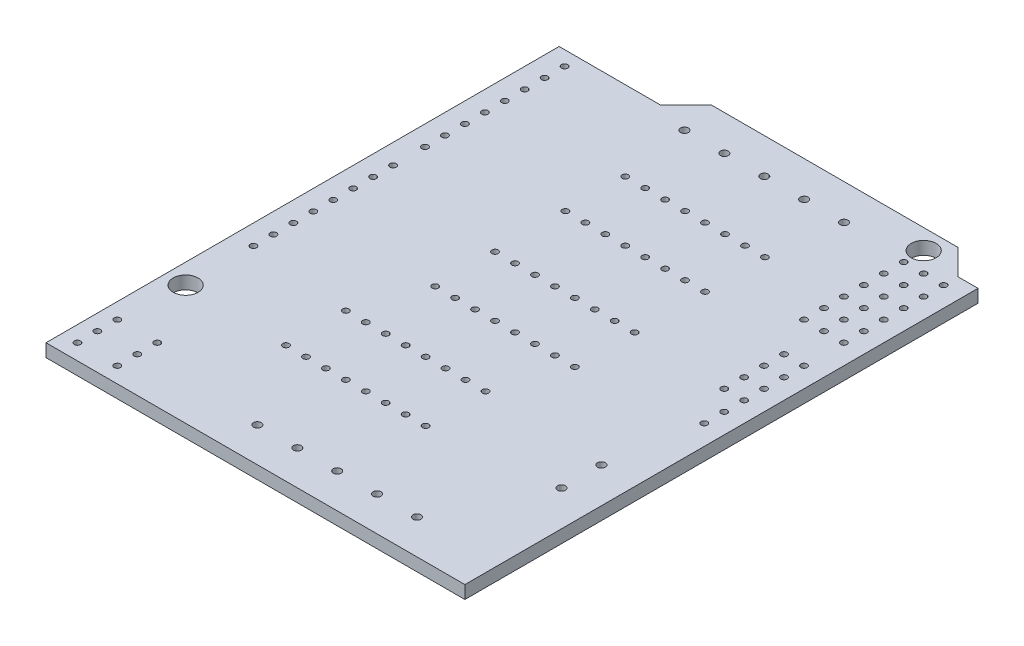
ISO-10303-21;
HEADER;
FILE_DESCRIPTION(('STEP AP214'),'2;1');
FILE_NAME('part.step','',(''),(''),'','','');
FILE_SCHEMA(('AUTOMOTIVE_DESIGN { 1 0 10303 214 1 1 1 1 }'));
ENDSEC;
DATA;
#1=APPLICATION_CONTEXT('core data for automotive mechanical design processes');
#2=APPLICATION_PROTOCOL_DEFINITION('international standard','automotive_design',2000,#1);
#3=PRODUCT_CONTEXT('',#1,'mechanical');
#4=PRODUCT('Part','Part','',(#3));
#5=PRODUCT_RELATED_PRODUCT_CATEGORY('part','',(#4));
#6=PRODUCT_DEFINITION_FORMATION('','',#4);
#7=PRODUCT_DEFINITION_CONTEXT('part definition',#1,'design');
#8=PRODUCT_DEFINITION('design','',#6,#7);
#9=PRODUCT_DEFINITION_SHAPE('','',#8);
#10=(LENGTH_UNIT() NAMED_UNIT(*) SI_UNIT(.MILLI.,.METRE.));
#11=(NAMED_UNIT(*) PLANE_ANGLE_UNIT() SI_UNIT($,.RADIAN.));
#12=(NAMED_UNIT(*) SI_UNIT($,.STERADIAN.) SOLID_ANGLE_UNIT());
#13=UNCERTAINTY_MEASURE_WITH_UNIT(LENGTH_MEASURE(1.E-05),#10,'distance_accuracy_value','');
#14=(GEOMETRIC_REPRESENTATION_CONTEXT(3) GLOBAL_UNCERTAINTY_ASSIGNED_CONTEXT((#13)) GLOBAL_UNIT_ASSIGNED_CONTEXT((#10,
#11,#12)) REPRESENTATION_CONTEXT('',''));
#15=CARTESIAN_POINT('',(0.,0.,0.));
#16=DIRECTION('',(0.,0.,1.));
#17=DIRECTION('',(1.,0.,0.));
#18=AXIS2_PLACEMENT_3D('',#15,#16,#17);
#19=CARTESIAN_POINT('',(0.,1.65,-65.3384355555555));
#20=DIRECTION('',(0.,-1.,0.));
#21=DIRECTION('',(0.,0.,-1.));
#22=AXIS2_PLACEMENT_3D('',#19,#20,#21);
#23=PLANE('',#22);
#24=CARTESIAN_POINT('',(-51.34,1.65,-4.53999999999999));
#25=DIRECTION('',(0.,1.,0.));
#26=DIRECTION('',(0.,0.,1.));
#27=AXIS2_PLACEMENT_3D('',#24,#25,#26);
#28=CIRCLE('',#27,0.399999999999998);
#29=CARTESIAN_POINT('',(-51.34,1.65,-4.13999999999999));
#30=VERTEX_POINT('',#29);
#31=EDGE_CURVE('E1324',#30,#30,#28,.T.);
#32=ORIENTED_EDGE('',*,*,#31,.F.);
#33=EDGE_LOOP('',(#32));
#34=FACE_BOUND('',#33,.T.);
#35=CARTESIAN_POINT('',(-46.26,1.65,-4.53999999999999));
#36=DIRECTION('',(0.,1.,0.));
#37=DIRECTION('',(0.,0.,1.));
#38=AXIS2_PLACEMENT_3D('',#35,#36,#37);
#39=CIRCLE('',#38,0.399999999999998);
#40=CARTESIAN_POINT('',(-46.26,1.65,-4.13999999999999));
#41=VERTEX_POINT('',#40);
#42=EDGE_CURVE('E1318',#41,#41,#39,.T.);
#43=ORIENTED_EDGE('',*,*,#42,.F.);
#44=EDGE_LOOP('',(#43));
#45=FACE_BOUND('',#44,.T.);
#46=CARTESIAN_POINT('',(-46.26,1.65,-1.99999999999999));
#47=DIRECTION('',(0.,1.,0.));
#48=DIRECTION('',(0.,0.,1.));
#49=AXIS2_PLACEMENT_3D('',#46,#47,#48);
#50=CIRCLE('',#49,0.399999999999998);
#51=CARTESIAN_POINT('',(-46.26,1.65,-1.59999999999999));
#52=VERTEX_POINT('',#51);
#53=EDGE_CURVE('E1315',#52,#52,#50,.T.);
#54=ORIENTED_EDGE('',*,*,#53,.F.);
#55=EDGE_LOOP('',(#54));
#56=FACE_BOUND('',#55,.T.);
#57=CARTESIAN_POINT('',(-51.34,1.65,-1.99999999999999));
#58=DIRECTION('',(0.,1.,0.));
#59=DIRECTION('',(0.,0.,1.));
#60=AXIS2_PLACEMENT_3D('',#57,#58,#59);
#61=CIRCLE('',#60,0.399999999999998);
#62=CARTESIAN_POINT('',(-51.34,1.65,-1.59999999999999));
#63=VERTEX_POINT('',#62);
#64=EDGE_CURVE('E1309',#63,#63,#61,.T.);
#65=ORIENTED_EDGE('',*,*,#64,.F.);
#66=EDGE_LOOP('',(#65));
#67=FACE_BOUND('',#66,.T.);
#68=CARTESIAN_POINT('',(-34.78,1.65,-55.2));
#69=DIRECTION('',(0.,1.,0.));
#70=DIRECTION('',(0.,0.,1.));
#71=AXIS2_PLACEMENT_3D('',#68,#69,#70);
#72=CIRCLE('',#71,0.400000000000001);
#73=CARTESIAN_POINT('',(-34.78,1.65,-54.8));
#74=VERTEX_POINT('',#73);
#75=EDGE_CURVE('E1303',#74,#74,#72,.T.);
#76=ORIENTED_EDGE('',*,*,#75,.F.);
#77=EDGE_LOOP('',(#76));
#78=FACE_BOUND('',#77,.T.);
#79=CARTESIAN_POINT('',(-32.24,1.65,-55.2));
#80=DIRECTION('',(0.,1.,0.));
#81=DIRECTION('',(0.,0.,1.));
#82=AXIS2_PLACEMENT_3D('',#79,#80,#81);
#83=CIRCLE('',#82,0.400000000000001);
#84=CARTESIAN_POINT('',(-32.24,1.65,-54.8));
#85=VERTEX_POINT('',#84);
#86=EDGE_CURVE('E1297',#85,#85,#83,.T.);
#87=ORIENTED_EDGE('',*,*,#86,.F.);
#88=EDGE_LOOP('',(#87));
#89=FACE_BOUND('',#88,.T.);
#90=CARTESIAN_POINT('',(-29.7,1.65,-55.2));
#91=DIRECTION('',(0.,1.,0.));
#92=DIRECTION('',(0.,0.,1.));
#93=AXIS2_PLACEMENT_3D('',#90,#91,#92);
#94=CIRCLE('',#93,0.400000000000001);
#95=CARTESIAN_POINT('',(-29.7,1.65,-54.8));
#96=VERTEX_POINT('',#95);
#97=EDGE_CURVE('E1291',#96,#96,#94,.T.);
#98=ORIENTED_EDGE('',*,*,#97,.F.);
#99=EDGE_LOOP('',(#98));
#100=FACE_BOUND('',#99,.T.);
#101=CARTESIAN_POINT('',(-27.16,1.65,-55.2));
#102=DIRECTION('',(0.,1.,0.));
#103=DIRECTION('',(0.,0.,1.));
#104=AXIS2_PLACEMENT_3D('',#101,#102,#103);
#105=CIRCLE('',#104,0.400000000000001);
#106=CARTESIAN_POINT('',(-27.16,1.65,-54.8));
#107=VERTEX_POINT('',#106);
#108=EDGE_CURVE('E1285',#107,#107,#105,.T.);
#109=ORIENTED_EDGE('',*,*,#108,.F.);
#110=EDGE_LOOP('',(#109));
#111=FACE_BOUND('',#110,.T.);
#112=CARTESIAN_POINT('',(-24.62,1.65,-55.2));
#113=DIRECTION('',(0.,1.,0.));
#114=DIRECTION('',(0.,0.,1.));
#115=AXIS2_PLACEMENT_3D('',#112,#113,#114);
#116=CIRCLE('',#115,0.400000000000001);
#117=CARTESIAN_POINT('',(-24.62,1.65,-54.8));
#118=VERTEX_POINT('',#117);
#119=EDGE_CURVE('E1279',#118,#118,#116,.T.);
#120=ORIENTED_EDGE('',*,*,#119,.F.);
#121=EDGE_LOOP('',(#120));
#122=FACE_BOUND('',#121,.T.);
#123=CARTESIAN_POINT('',(-22.08,1.65,-55.2));
#124=DIRECTION('',(0.,1.,0.));
#125=DIRECTION('',(0.,0.,1.));
#126=AXIS2_PLACEMENT_3D('',#123,#124,#125);
#127=CIRCLE('',#126,0.400000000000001);
#128=CARTESIAN_POINT('',(-22.08,1.65,-54.8));
#129=VERTEX_POINT('',#128);
#130=EDGE_CURVE('E1273',#129,#129,#127,.T.);
#131=ORIENTED_EDGE('',*,*,#130,.F.);
#132=EDGE_LOOP('',(#131));
#133=FACE_BOUND('',#132,.T.);
#134=CARTESIAN_POINT('',(-19.54,1.65,-55.2));
#135=DIRECTION('',(0.,1.,0.));
#136=DIRECTION('',(0.,0.,1.));
#137=AXIS2_PLACEMENT_3D('',#134,#135,#136);
#138=CIRCLE('',#137,0.400000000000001);
#139=CARTESIAN_POINT('',(-19.54,1.65,-54.8));
#140=VERTEX_POINT('',#139);
#141=EDGE_CURVE('E1267',#140,#140,#138,.T.);
#142=ORIENTED_EDGE('',*,*,#141,.F.);
#143=EDGE_LOOP('',(#142));
#144=FACE_BOUND('',#143,.T.);
#145=CARTESIAN_POINT('',(-17.,1.65,-55.2));
#146=DIRECTION('',(0.,1.,0.));
#147=DIRECTION('',(0.,0.,1.));
#148=AXIS2_PLACEMENT_3D('',#145,#146,#147);
#149=CIRCLE('',#148,0.400000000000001);
#150=CARTESIAN_POINT('',(-17.,1.65,-54.8));
#151=VERTEX_POINT('',#150);
#152=EDGE_CURVE('E1261',#151,#151,#149,.T.);
#153=ORIENTED_EDGE('',*,*,#152,.F.);
#154=EDGE_LOOP('',(#153));
#155=FACE_BOUND('',#154,.T.);
#156=CARTESIAN_POINT('',(-19.54,1.65,-47.58));
#157=DIRECTION('',(0.,1.,0.));
#158=DIRECTION('',(0.,0.,1.));
#159=AXIS2_PLACEMENT_3D('',#156,#157,#158);
#160=CIRCLE('',#159,0.400000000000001);
#161=CARTESIAN_POINT('',(-19.54,1.65,-47.18));
#162=VERTEX_POINT('',#161);
#163=EDGE_CURVE('E1252',#162,#162,#160,.T.);
#164=ORIENTED_EDGE('',*,*,#163,.F.);
#165=EDGE_LOOP('',(#164));
#166=FACE_BOUND('',#165,.T.);
#167=CARTESIAN_POINT('',(-17.,1.65,-47.58));
#168=DIRECTION('',(0.,1.,0.));
#169=DIRECTION('',(0.,0.,1.));
#170=AXIS2_PLACEMENT_3D('',#167,#168,#169);
#171=CIRCLE('',#170,0.400000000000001);
#172=CARTESIAN_POINT('',(-17.,1.65,-47.18));
#173=VERTEX_POINT('',#172);
#174=EDGE_CURVE('E1249',#173,#173,#171,.T.);
#175=ORIENTED_EDGE('',*,*,#174,.F.);
#176=EDGE_LOOP('',(#175));
#177=FACE_BOUND('',#176,.T.);
#178=CARTESIAN_POINT('',(-34.78,1.65,-38.62));
#179=DIRECTION('',(0.,1.,0.));
#180=DIRECTION('',(0.,0.,1.));
#181=AXIS2_PLACEMENT_3D('',#178,#179,#180);
#182=CIRCLE('',#181,0.400000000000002);
#183=CARTESIAN_POINT('',(-34.78,1.65,-38.22));
#184=VERTEX_POINT('',#183);
#185=EDGE_CURVE('E1243',#184,#184,#182,.T.);
#186=ORIENTED_EDGE('',*,*,#185,.F.);
#187=EDGE_LOOP('',(#186));
#188=FACE_BOUND('',#187,.T.);
#189=CARTESIAN_POINT('',(-32.24,1.65,-38.62));
#190=DIRECTION('',(0.,1.,0.));
#191=DIRECTION('',(0.,0.,1.));
#192=AXIS2_PLACEMENT_3D('',#189,#190,#191);
#193=CIRCLE('',#192,0.400000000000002);
#194=CARTESIAN_POINT('',(-32.24,1.65,-38.22));
#195=VERTEX_POINT('',#194);
#196=EDGE_CURVE('E1237',#195,#195,#193,.T.);
#197=ORIENTED_EDGE('',*,*,#196,.F.);
#198=EDGE_LOOP('',(#197));
#199=FACE_BOUND('',#198,.T.);
#200=CARTESIAN_POINT('',(-29.7,1.65,-38.62));
#201=DIRECTION('',(0.,1.,0.));
#202=DIRECTION('',(0.,0.,1.));
#203=AXIS2_PLACEMENT_3D('',#200,#201,#202);
#204=CIRCLE('',#203,0.400000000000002);
#205=CARTESIAN_POINT('',(-29.7,1.65,-38.22));
#206=VERTEX_POINT('',#205);
#207=EDGE_CURVE('E1231',#206,#206,#204,.T.);
#208=ORIENTED_EDGE('',*,*,#207,.F.);
#209=EDGE_LOOP('',(#208));
#210=FACE_BOUND('',#209,.T.);
#211=CARTESIAN_POINT('',(-27.16,1.65,-38.62));
#212=DIRECTION('',(0.,1.,0.));
#213=DIRECTION('',(0.,0.,1.));
#214=AXIS2_PLACEMENT_3D('',#211,#212,#213);
#215=CIRCLE('',#214,0.400000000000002);
#216=CARTESIAN_POINT('',(-27.16,1.65,-38.22));
#217=VERTEX_POINT('',#216);
#218=EDGE_CURVE('E1225',#217,#217,#215,.T.);
#219=ORIENTED_EDGE('',*,*,#218,.F.);
#220=EDGE_LOOP('',(#219));
#221=FACE_BOUND('',#220,.T.);
#222=CARTESIAN_POINT('',(-24.62,1.65,-38.62));
#223=DIRECTION('',(0.,1.,0.));
#224=DIRECTION('',(0.,0.,1.));
#225=AXIS2_PLACEMENT_3D('',#222,#223,#224);
#226=CIRCLE('',#225,0.400000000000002);
#227=CARTESIAN_POINT('',(-24.62,1.65,-38.22));
#228=VERTEX_POINT('',#227);
#229=EDGE_CURVE('E1219',#228,#228,#226,.T.);
#230=ORIENTED_EDGE('',*,*,#229,.F.);
#231=EDGE_LOOP('',(#230));
#232=FACE_BOUND('',#231,.T.);
#233=CARTESIAN_POINT('',(-22.08,1.65,-38.62));
#234=DIRECTION('',(0.,1.,0.));
#235=DIRECTION('',(0.,0.,1.));
#236=AXIS2_PLACEMENT_3D('',#233,#234,#235);
#237=CIRCLE('',#236,0.400000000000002);
#238=CARTESIAN_POINT('',(-22.08,1.65,-38.22));
#239=VERTEX_POINT('',#238);
#240=EDGE_CURVE('E1213',#239,#239,#237,.T.);
#241=ORIENTED_EDGE('',*,*,#240,.F.);
#242=EDGE_LOOP('',(#241));
#243=FACE_BOUND('',#242,.T.);
#244=CARTESIAN_POINT('',(-19.54,1.65,-38.62));
#245=DIRECTION('',(0.,1.,0.));
#246=DIRECTION('',(0.,0.,1.));
#247=AXIS2_PLACEMENT_3D('',#244,#245,#246);
#248=CIRCLE('',#247,0.400000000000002);
#249=CARTESIAN_POINT('',(-19.54,1.65,-38.22));
#250=VERTEX_POINT('',#249);
#251=EDGE_CURVE('E1207',#250,#250,#248,.T.);
#252=ORIENTED_EDGE('',*,*,#251,.F.);
#253=EDGE_LOOP('',(#252));
#254=FACE_BOUND('',#253,.T.);
#255=CARTESIAN_POINT('',(-17.,1.65,-38.62));
#256=DIRECTION('',(0.,1.,0.));
#257=DIRECTION('',(0.,0.,1.));
#258=AXIS2_PLACEMENT_3D('',#255,#256,#257);
#259=CIRCLE('',#258,0.400000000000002);
#260=CARTESIAN_POINT('',(-17.,1.65,-38.22));
#261=VERTEX_POINT('',#260);
#262=EDGE_CURVE('E1201',#261,#261,#259,.T.);
#263=ORIENTED_EDGE('',*,*,#262,.F.);
#264=EDGE_LOOP('',(#263));
#265=FACE_BOUND('',#264,.T.);
#266=CARTESIAN_POINT('',(-19.54,1.65,-31.));
#267=DIRECTION('',(0.,1.,0.));
#268=DIRECTION('',(0.,0.,1.));
#269=AXIS2_PLACEMENT_3D('',#266,#267,#268);
#270=CIRCLE('',#269,0.400000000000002);
#271=CARTESIAN_POINT('',(-19.54,1.65,-30.6));
#272=VERTEX_POINT('',#271);
#273=EDGE_CURVE('E1192',#272,#272,#270,.T.);
#274=ORIENTED_EDGE('',*,*,#273,.F.);
#275=EDGE_LOOP('',(#274));
#276=FACE_BOUND('',#275,.T.);
#277=CARTESIAN_POINT('',(-17.,1.65,-31.));
#278=DIRECTION('',(0.,1.,0.));
#279=DIRECTION('',(0.,0.,1.));
#280=AXIS2_PLACEMENT_3D('',#277,#278,#279);
#281=CIRCLE('',#280,0.400000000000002);
#282=CARTESIAN_POINT('',(-17.,1.65,-30.6));
#283=VERTEX_POINT('',#282);
#284=EDGE_CURVE('E1189',#283,#283,#281,.T.);
#285=ORIENTED_EDGE('',*,*,#284,.F.);
#286=EDGE_LOOP('',(#285));
#287=FACE_BOUND('',#286,.T.);
#288=CARTESIAN_POINT('',(-37.78,1.65,-22.62));
#289=DIRECTION('',(0.,1.,0.));
#290=DIRECTION('',(0.,0.,1.));
#291=AXIS2_PLACEMENT_3D('',#288,#289,#290);
#292=CIRCLE('',#291,0.400000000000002);
#293=CARTESIAN_POINT('',(-37.78,1.65,-22.22));
#294=VERTEX_POINT('',#293);
#295=EDGE_CURVE('E1183',#294,#294,#292,.T.);
#296=ORIENTED_EDGE('',*,*,#295,.F.);
#297=EDGE_LOOP('',(#296));
#298=FACE_BOUND('',#297,.T.);
#299=CARTESIAN_POINT('',(-35.24,1.65,-22.62));
#300=DIRECTION('',(0.,1.,0.));
#301=DIRECTION('',(0.,0.,1.));
#302=AXIS2_PLACEMENT_3D('',#299,#300,#301);
#303=CIRCLE('',#302,0.400000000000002);
#304=CARTESIAN_POINT('',(-35.24,1.65,-22.22));
#305=VERTEX_POINT('',#304);
#306=EDGE_CURVE('E1177',#305,#305,#303,.T.);
#307=ORIENTED_EDGE('',*,*,#306,.F.);
#308=EDGE_LOOP('',(#307));
#309=FACE_BOUND('',#308,.T.);
#310=CARTESIAN_POINT('',(-32.7,1.65,-22.62));
#311=DIRECTION('',(0.,1.,0.));
#312=DIRECTION('',(0.,0.,1.));
#313=AXIS2_PLACEMENT_3D('',#310,#311,#312);
#314=CIRCLE('',#313,0.400000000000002);
#315=CARTESIAN_POINT('',(-32.7,1.65,-22.22));
#316=VERTEX_POINT('',#315);
#317=EDGE_CURVE('E1171',#316,#316,#314,.T.);
#318=ORIENTED_EDGE('',*,*,#317,.F.);
#319=EDGE_LOOP('',(#318));
#320=FACE_BOUND('',#319,.T.);
#321=CARTESIAN_POINT('',(-30.16,1.65,-22.62));
#322=DIRECTION('',(0.,1.,0.));
#323=DIRECTION('',(0.,0.,1.));
#324=AXIS2_PLACEMENT_3D('',#321,#322,#323);
#325=CIRCLE('',#324,0.400000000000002);
#326=CARTESIAN_POINT('',(-30.16,1.65,-22.22));
#327=VERTEX_POINT('',#326);
#328=EDGE_CURVE('E1165',#327,#327,#325,.T.);
#329=ORIENTED_EDGE('',*,*,#328,.F.);
#330=EDGE_LOOP('',(#329));
#331=FACE_BOUND('',#330,.T.);
#332=CARTESIAN_POINT('',(-27.62,1.65,-22.62));
#333=DIRECTION('',(0.,1.,0.));
#334=DIRECTION('',(0.,0.,1.));
#335=AXIS2_PLACEMENT_3D('',#332,#333,#334);
#336=CIRCLE('',#335,0.400000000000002);
#337=CARTESIAN_POINT('',(-27.62,1.65,-22.22));
#338=VERTEX_POINT('',#337);
#339=EDGE_CURVE('E1159',#338,#338,#336,.T.);
#340=ORIENTED_EDGE('',*,*,#339,.F.);
#341=EDGE_LOOP('',(#340));
#342=FACE_BOUND('',#341,.T.);
#343=CARTESIAN_POINT('',(-25.08,1.65,-22.62));
#344=DIRECTION('',(0.,1.,0.));
#345=DIRECTION('',(0.,0.,1.));
#346=AXIS2_PLACEMENT_3D('',#343,#344,#345);
#347=CIRCLE('',#346,0.400000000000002);
#348=CARTESIAN_POINT('',(-25.08,1.65,-22.22));
#349=VERTEX_POINT('',#348);
#350=EDGE_CURVE('E1153',#349,#349,#347,.T.);
#351=ORIENTED_EDGE('',*,*,#350,.F.);
#352=EDGE_LOOP('',(#351));
#353=FACE_BOUND('',#352,.T.);
#354=CARTESIAN_POINT('',(-22.54,1.65,-22.62));
#355=DIRECTION('',(0.,1.,0.));
#356=DIRECTION('',(0.,0.,1.));
#357=AXIS2_PLACEMENT_3D('',#354,#355,#356);
#358=CIRCLE('',#357,0.400000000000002);
#359=CARTESIAN_POINT('',(-22.54,1.65,-22.22));
#360=VERTEX_POINT('',#359);
#361=EDGE_CURVE('E1147',#360,#360,#358,.T.);
#362=ORIENTED_EDGE('',*,*,#361,.F.);
#363=EDGE_LOOP('',(#362));
#364=FACE_BOUND('',#363,.T.);
#365=CARTESIAN_POINT('',(-20.,1.65,-22.62));
#366=DIRECTION('',(0.,1.,0.));
#367=DIRECTION('',(0.,0.,1.));
#368=AXIS2_PLACEMENT_3D('',#365,#366,#367);
#369=CIRCLE('',#368,0.400000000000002);
#370=CARTESIAN_POINT('',(-20.,1.65,-22.22));
#371=VERTEX_POINT('',#370);
#372=EDGE_CURVE('E1141',#371,#371,#369,.T.);
#373=ORIENTED_EDGE('',*,*,#372,.F.);
#374=EDGE_LOOP('',(#373));
#375=FACE_BOUND('',#374,.T.);
#376=CARTESIAN_POINT('',(-22.54,1.65,-15.));
#377=DIRECTION('',(0.,1.,0.));
#378=DIRECTION('',(0.,0.,1.));
#379=AXIS2_PLACEMENT_3D('',#376,#377,#378);
#380=CIRCLE('',#379,0.400000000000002);
#381=CARTESIAN_POINT('',(-22.54,1.65,-14.6));
#382=VERTEX_POINT('',#381);
#383=EDGE_CURVE('E1132',#382,#382,#380,.T.);
#384=ORIENTED_EDGE('',*,*,#383,.F.);
#385=EDGE_LOOP('',(#384));
#386=FACE_BOUND('',#385,.T.);
#387=CARTESIAN_POINT('',(-20.,1.65,-15.));
#388=DIRECTION('',(0.,1.,0.));
#389=DIRECTION('',(0.,0.,1.));
#390=AXIS2_PLACEMENT_3D('',#387,#388,#389);
#391=CIRCLE('',#390,0.400000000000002);
#392=CARTESIAN_POINT('',(-20.,1.65,-14.6));
#393=VERTEX_POINT('',#392);
#394=EDGE_CURVE('E1129',#393,#393,#391,.T.);
#395=ORIENTED_EDGE('',*,*,#394,.F.);
#396=EDGE_LOOP('',(#395));
#397=FACE_BOUND('',#396,.T.);
#398=CARTESIAN_POINT('',(-4.5,1.65,-21.88));
#399=DIRECTION('',(0.,1.,0.));
#400=DIRECTION('',(0.,0.,1.));
#401=AXIS2_PLACEMENT_3D('',#398,#399,#400);
#402=CIRCLE('',#401,0.5);
#403=CARTESIAN_POINT('',(-4.5,1.65,-21.38));
#404=VERTEX_POINT('',#403);
#405=EDGE_CURVE('E1120',#404,#404,#402,.T.);
#406=ORIENTED_EDGE('',*,*,#405,.F.);
#407=EDGE_LOOP('',(#406));
#408=FACE_BOUND('',#407,.T.);
#409=CARTESIAN_POINT('',(-4.5,1.65,-16.8));
#410=DIRECTION('',(0.,1.,0.));
#411=DIRECTION('',(0.,0.,1.));
#412=AXIS2_PLACEMENT_3D('',#409,#410,#411);
#413=CIRCLE('',#412,0.5);
#414=CARTESIAN_POINT('',(-4.5,1.65,-16.3));
#415=VERTEX_POINT('',#414);
#416=EDGE_CURVE('E1117',#415,#415,#413,.T.);
#417=ORIENTED_EDGE('',*,*,#416,.F.);
#418=EDGE_LOOP('',(#417));
#419=FACE_BOUND('',#418,.T.);
#420=CARTESIAN_POINT('',(-15.58,1.65,-4.39999999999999));
#421=DIRECTION('',(0.,1.,0.));
#422=DIRECTION('',(0.,0.,1.));
#423=AXIS2_PLACEMENT_3D('',#420,#421,#422);
#424=CIRCLE('',#423,0.500000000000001);
#425=CARTESIAN_POINT('',(-15.58,1.65,-3.89999999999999));
#426=VERTEX_POINT('',#425);
#427=EDGE_CURVE('E1108',#426,#426,#424,.T.);
#428=ORIENTED_EDGE('',*,*,#427,.F.);
#429=EDGE_LOOP('',(#428));
#430=FACE_BOUND('',#429,.T.);
#431=CARTESIAN_POINT('',(-10.5,1.65,-4.39999999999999));
#432=DIRECTION('',(0.,1.,0.));
#433=DIRECTION('',(0.,0.,1.));
#434=AXIS2_PLACEMENT_3D('',#431,#432,#433);
#435=CIRCLE('',#434,0.500000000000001);
#436=CARTESIAN_POINT('',(-10.5,1.65,-3.89999999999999));
#437=VERTEX_POINT('',#436);
#438=EDGE_CURVE('E1105',#437,#437,#435,.T.);
#439=ORIENTED_EDGE('',*,*,#438,.F.);
#440=EDGE_LOOP('',(#439));
#441=FACE_BOUND('',#440,.T.);
#442=CARTESIAN_POINT('',(-20.88,1.65,-64.08));
#443=DIRECTION('',(0.,1.,0.));
#444=DIRECTION('',(0.,0.,1.));
#445=AXIS2_PLACEMENT_3D('',#442,#443,#444);
#446=CIRCLE('',#445,0.499999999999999);
#447=CARTESIAN_POINT('',(-20.88,1.65,-63.58));
#448=VERTEX_POINT('',#447);
#449=EDGE_CURVE('E1096',#448,#448,#446,.T.);
#450=ORIENTED_EDGE('',*,*,#449,.F.);
#451=EDGE_LOOP('',(#450));
#452=FACE_BOUND('',#451,.T.);
#453=CARTESIAN_POINT('',(-15.8,1.65,-64.08));
#454=DIRECTION('',(0.,1.,0.));
#455=DIRECTION('',(0.,0.,1.));
#456=AXIS2_PLACEMENT_3D('',#453,#454,#455);
#457=CIRCLE('',#456,0.499999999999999);
#458=CARTESIAN_POINT('',(-15.8,1.65,-63.58));
#459=VERTEX_POINT('',#458);
#460=EDGE_CURVE('E1093',#459,#459,#457,.T.);
#461=ORIENTED_EDGE('',*,*,#460,.F.);
#462=EDGE_LOOP('',(#461));
#463=FACE_BOUND('',#462,.T.);
#464=CARTESIAN_POINT('',(-7.62,1.65,-60.96));
#465=DIRECTION('',(0.,1.,0.));
#466=DIRECTION('',(0.,0.,1.));
#467=AXIS2_PLACEMENT_3D('',#464,#465,#466);
#468=CIRCLE('',#467,0.399999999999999);
#469=CARTESIAN_POINT('',(-7.62,1.65,-60.56));
#470=VERTEX_POINT('',#469);
#471=EDGE_CURVE('E1084',#470,#470,#468,.T.);
#472=ORIENTED_EDGE('',*,*,#471,.F.);
#473=EDGE_LOOP('',(#472));
#474=FACE_BOUND('',#473,.T.);
#475=CARTESIAN_POINT('',(-7.62,1.65,-63.5));
#476=DIRECTION('',(0.,1.,0.));
#477=DIRECTION('',(0.,0.,1.));
#478=AXIS2_PLACEMENT_3D('',#475,#476,#477);
#479=CIRCLE('',#478,0.399999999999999);
#480=CARTESIAN_POINT('',(-7.62,1.65,-63.1));
#481=VERTEX_POINT('',#480);
#482=EDGE_CURVE('E1081',#481,#481,#479,.T.);
#483=ORIENTED_EDGE('',*,*,#482,.F.);
#484=EDGE_LOOP('',(#483));
#485=FACE_BOUND('',#484,.T.);
#486=CARTESIAN_POINT('',(-5.08,1.65,-60.96));
#487=DIRECTION('',(0.,1.,0.));
#488=DIRECTION('',(0.,0.,1.));
#489=AXIS2_PLACEMENT_3D('',#486,#487,#488);
#490=CIRCLE('',#489,0.399999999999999);
#491=CARTESIAN_POINT('',(-5.08,1.65,-60.56));
#492=VERTEX_POINT('',#491);
#493=EDGE_CURVE('E1072',#492,#492,#490,.T.);
#494=ORIENTED_EDGE('',*,*,#493,.F.);
#495=EDGE_LOOP('',(#494));
#496=FACE_BOUND('',#495,.T.);
#497=CARTESIAN_POINT('',(-5.08,1.65,-63.5));
#498=DIRECTION('',(0.,1.,0.));
#499=DIRECTION('',(0.,0.,1.));
#500=AXIS2_PLACEMENT_3D('',#497,#498,#499);
#501=CIRCLE('',#500,0.399999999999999);
#502=CARTESIAN_POINT('',(-5.08,1.65,-63.1));
#503=VERTEX_POINT('',#502);
#504=EDGE_CURVE('E1069',#503,#503,#501,.T.);
#505=ORIENTED_EDGE('',*,*,#504,.F.);
#506=EDGE_LOOP('',(#505));
#507=FACE_BOUND('',#506,.T.);
#508=CARTESIAN_POINT('',(-50.8,1.65,-48.26));
#509=DIRECTION('',(0.,1.,0.));
#510=DIRECTION('',(0.,0.,1.));
#511=AXIS2_PLACEMENT_3D('',#508,#509,#510);
#512=CIRCLE('',#511,0.399999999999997);
#513=CARTESIAN_POINT('',(-50.8,1.65,-47.86));
#514=VERTEX_POINT('',#513);
#515=EDGE_CURVE('E1060',#514,#514,#512,.T.);
#516=ORIENTED_EDGE('',*,*,#515,.F.);
#517=EDGE_LOOP('',(#516));
#518=FACE_BOUND('',#517,.T.);
#519=CARTESIAN_POINT('',(-50.8,1.65,-45.72));
#520=DIRECTION('',(0.,1.,0.));
#521=DIRECTION('',(0.,0.,1.));
#522=AXIS2_PLACEMENT_3D('',#519,#520,#521);
#523=CIRCLE('',#522,0.399999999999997);
#524=CARTESIAN_POINT('',(-50.8,1.65,-45.32));
#525=VERTEX_POINT('',#524);
#526=EDGE_CURVE('E1057',#525,#525,#523,.T.);
#527=ORIENTED_EDGE('',*,*,#526,.F.);
#528=EDGE_LOOP('',(#527));
#529=FACE_BOUND('',#528,.T.);
#530=CARTESIAN_POINT('',(-50.8,1.65,-26.42));
#531=DIRECTION('',(0.,1.,0.));
#532=DIRECTION('',(0.,0.,1.));
#533=AXIS2_PLACEMENT_3D('',#530,#531,#532);
#534=CIRCLE('',#533,0.399999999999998);
#535=CARTESIAN_POINT('',(-50.8,1.65,-26.02));
#536=VERTEX_POINT('',#535);
#537=EDGE_CURVE('E1048',#536,#536,#534,.T.);
#538=ORIENTED_EDGE('',*,*,#537,.F.);
#539=EDGE_LOOP('',(#538));
#540=FACE_BOUND('',#539,.T.);
#541=CARTESIAN_POINT('',(-2.54,1.65,-35.56));
#542=DIRECTION('',(0.,1.,0.));
#543=DIRECTION('',(0.,0.,1.));
#544=AXIS2_PLACEMENT_3D('',#541,#542,#543);
#545=CIRCLE('',#544,0.4);
#546=CARTESIAN_POINT('',(-2.54,1.65,-35.16));
#547=VERTEX_POINT('',#546);
#548=EDGE_CURVE('E1042',#547,#547,#545,.T.);
#549=ORIENTED_EDGE('',*,*,#548,.F.);
#550=EDGE_LOOP('',(#549));
#551=FACE_BOUND('',#550,.T.);
#552=CARTESIAN_POINT('',(-50.8,1.65,-23.88));
#553=DIRECTION('',(0.,1.,0.));
#554=DIRECTION('',(0.,0.,1.));
#555=AXIS2_PLACEMENT_3D('',#552,#553,#554);
#556=CIRCLE('',#555,0.399999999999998);
#557=CARTESIAN_POINT('',(-50.8,1.65,-23.48));
#558=VERTEX_POINT('',#557);
#559=EDGE_CURVE('E1039',#558,#558,#556,.T.);
#560=ORIENTED_EDGE('',*,*,#559,.F.);
#561=EDGE_LOOP('',(#560));
#562=FACE_BOUND('',#561,.T.);
#563=CARTESIAN_POINT('',(-2.54,1.65,-33.02));
#564=DIRECTION('',(0.,1.,0.));
#565=DIRECTION('',(0.,0.,1.));
#566=AXIS2_PLACEMENT_3D('',#563,#564,#565);
#567=CIRCLE('',#566,0.4);
#568=CARTESIAN_POINT('',(-2.54,1.65,-32.62));
#569=VERTEX_POINT('',#568);
#570=EDGE_CURVE('E1033',#569,#569,#567,.T.);
#571=ORIENTED_EDGE('',*,*,#570,.F.);
#572=EDGE_LOOP('',(#571));
#573=FACE_BOUND('',#572,.T.);
#574=CARTESIAN_POINT('',(-7.62,1.65,-66.04));
#575=DIRECTION('',(0.,1.,0.));
#576=DIRECTION('',(0.,0.,1.));
#577=AXIS2_PLACEMENT_3D('',#574,#575,#576);
#578=CIRCLE('',#577,1.5875);
#579=CARTESIAN_POINT('',(-7.62,1.65,-64.4525));
#580=VERTEX_POINT('',#579);
#581=EDGE_CURVE('E116',#580,#580,#578,.T.);
#582=ORIENTED_EDGE('',*,*,#581,.F.);
#583=EDGE_LOOP('',(#582));
#584=FACE_BOUND('',#583,.T.);
#585=DIRECTION('',(0.,0.,-1.));
#586=VECTOR('',#585,1.);
#587=CARTESIAN_POINT('',(0.,1.65,0.));
#588=LINE('',#587,#586);
#589=CARTESIAN_POINT('',(0.,1.65,0.));
#590=VERTEX_POINT('',#589);
#591=CARTESIAN_POINT('',(0.,1.65,-65.3384355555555));
#592=VERTEX_POINT('',#591);
#593=EDGE_CURVE('E134',#590,#592,#588,.T.);
#594=ORIENTED_EDGE('',*,*,#593,.T.);
#595=DIRECTION('',(-1.,0.,0.));
#596=VECTOR('',#595,1.);
#597=CARTESIAN_POINT('',(-2.54,1.65,-65.3384355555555));
#598=LINE('',#597,#596);
#599=CARTESIAN_POINT('',(-2.54,1.65,-65.3384355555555));
#600=VERTEX_POINT('',#599);
#601=EDGE_CURVE('E107',#592,#600,#598,.T.);
#602=ORIENTED_EDGE('',*,*,#601,.T.);
#603=DIRECTION('',(-0.707106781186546,0.,-0.707106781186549));
#604=VECTOR('',#603,1.);
#605=CARTESIAN_POINT('',(-5.78156444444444,1.65,-68.58));
#606=LINE('',#605,#604);
#607=CARTESIAN_POINT('',(-5.78156444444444,1.65,-68.58));
#608=VERTEX_POINT('',#607);
#609=EDGE_CURVE('E137',#600,#608,#606,.T.);
#610=ORIENTED_EDGE('',*,*,#609,.T.);
#611=DIRECTION('',(-1.,0.,0.));
#612=VECTOR('',#611,1.);
#613=CARTESIAN_POINT('',(-37.1484355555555,1.65,-68.58));
#614=LINE('',#613,#612);
#615=CARTESIAN_POINT('',(-37.1484355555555,1.65,-68.58));
#616=VERTEX_POINT('',#615);
#617=EDGE_CURVE('E139',#608,#616,#614,.T.);
#618=ORIENTED_EDGE('',*,*,#617,.T.);
#619=DIRECTION('',(-0.707106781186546,0.,0.707106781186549));
#620=VECTOR('',#619,1.);
#621=CARTESIAN_POINT('',(-40.39,1.65,-65.3384355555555));
#622=LINE('',#621,#620);
#623=CARTESIAN_POINT('',(-40.39,1.65,-65.3384355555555));
#624=VERTEX_POINT('',#623);
#625=EDGE_CURVE('E141',#616,#624,#622,.T.);
#626=ORIENTED_EDGE('',*,*,#625,.T.);
#627=DIRECTION('',(-1.,0.,0.));
#628=VECTOR('',#627,1.);
#629=CARTESIAN_POINT('',(-53.34,1.65,-65.3384355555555));
#630=LINE('',#629,#628);
#631=CARTESIAN_POINT('',(-53.34,1.65,-65.3384355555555));
#632=VERTEX_POINT('',#631);
#633=EDGE_CURVE('E143',#624,#632,#630,.T.);
#634=ORIENTED_EDGE('',*,*,#633,.T.);
#635=DIRECTION('',(0.,0.,1.));
#636=VECTOR('',#635,1.);
#637=CARTESIAN_POINT('',(-53.34,1.65,0.));
#638=LINE('',#637,#636);
#639=CARTESIAN_POINT('',(-53.34,1.65,0.));
#640=VERTEX_POINT('',#639);
#641=EDGE_CURVE('E46',#632,#640,#638,.T.);
#642=ORIENTED_EDGE('',*,*,#641,.T.);
#643=DIRECTION('',(1.,0.,0.));
#644=VECTOR('',#643,1.);
#645=CARTESIAN_POINT('',(0.,1.65,0.));
#646=LINE('',#645,#644);
#647=EDGE_CURVE('E41',#640,#590,#646,.T.);
#648=ORIENTED_EDGE('',*,*,#647,.T.);
#649=EDGE_LOOP('',(#594,#602,#610,#618,#626,#634,#642,#648));
#650=FACE_BOUND('',#649,.T.);
#651=CARTESIAN_POINT('',(-50.8,1.65,-15.24));
#652=DIRECTION('',(0.,1.,0.));
#653=DIRECTION('',(0.,0.,1.));
#654=AXIS2_PLACEMENT_3D('',#651,#652,#653);
#655=CIRCLE('',#654,1.5875);
#656=CARTESIAN_POINT('',(-50.8,1.65,-13.6525));
#657=VERTEX_POINT('',#656);
#658=EDGE_CURVE('E1023',#657,#657,#655,.T.);
#659=ORIENTED_EDGE('',*,*,#658,.F.);
#660=EDGE_LOOP('',(#659));
#661=FACE_BOUND('',#660,.T.);
#662=CARTESIAN_POINT('',(-2.54,1.65,-38.1));
#663=DIRECTION('',(0.,1.,0.));
#664=DIRECTION('',(0.,0.,1.));
#665=AXIS2_PLACEMENT_3D('',#662,#663,#664);
#666=CIRCLE('',#665,0.4);
#667=CARTESIAN_POINT('',(-2.54,1.65,-37.7));
#668=VERTEX_POINT('',#667);
#669=EDGE_CURVE('E166',#668,#668,#666,.T.);
#670=ORIENTED_EDGE('',*,*,#669,.F.);
#671=EDGE_LOOP('',(#670));
#672=FACE_BOUND('',#671,.T.);
#673=CARTESIAN_POINT('',(-2.54,1.65,-40.64));
#674=DIRECTION('',(0.,1.,0.));
#675=DIRECTION('',(0.,0.,1.));
#676=AXIS2_PLACEMENT_3D('',#673,#674,#675);
#677=CIRCLE('',#676,0.4);
#678=CARTESIAN_POINT('',(-2.54,1.65,-40.24));
#679=VERTEX_POINT('',#678);
#680=EDGE_CURVE('E172',#679,#679,#677,.T.);
#681=ORIENTED_EDGE('',*,*,#680,.F.);
#682=EDGE_LOOP('',(#681));
#683=FACE_BOUND('',#682,.T.);
#684=CARTESIAN_POINT('',(-2.54,1.65,-43.18));
#685=DIRECTION('',(0.,1.,0.));
#686=DIRECTION('',(0.,0.,1.));
#687=AXIS2_PLACEMENT_3D('',#684,#685,#686);
#688=CIRCLE('',#687,0.4);
#689=CARTESIAN_POINT('',(-2.54,1.65,-42.78));
#690=VERTEX_POINT('',#689);
#691=EDGE_CURVE('E178',#690,#690,#688,.T.);
#692=ORIENTED_EDGE('',*,*,#691,.F.);
#693=EDGE_LOOP('',(#692));
#694=FACE_BOUND('',#693,.T.);
#695=CARTESIAN_POINT('',(-2.54,1.65,-45.72));
#696=DIRECTION('',(0.,1.,0.));
#697=DIRECTION('',(0.,0.,1.));
#698=AXIS2_PLACEMENT_3D('',#695,#696,#697);
#699=CIRCLE('',#698,0.4);
#700=CARTESIAN_POINT('',(-2.54,1.65,-45.32));
#701=VERTEX_POINT('',#700);
#702=EDGE_CURVE('E184',#701,#701,#699,.T.);
#703=ORIENTED_EDGE('',*,*,#702,.F.);
#704=EDGE_LOOP('',(#703));
#705=FACE_BOUND('',#704,.T.);
#706=CARTESIAN_POINT('',(-2.54,1.65,-50.8));
#707=DIRECTION('',(0.,1.,0.));
#708=DIRECTION('',(0.,0.,1.));
#709=AXIS2_PLACEMENT_3D('',#706,#707,#708);
#710=CIRCLE('',#709,0.4);
#711=CARTESIAN_POINT('',(-2.54,1.65,-50.4));
#712=VERTEX_POINT('',#711);
#713=EDGE_CURVE('E190',#712,#712,#710,.T.);
#714=ORIENTED_EDGE('',*,*,#713,.F.);
#715=EDGE_LOOP('',(#714));
#716=FACE_BOUND('',#715,.T.);
#717=CARTESIAN_POINT('',(-2.54,1.65,-53.34));
#718=DIRECTION('',(0.,1.,0.));
#719=DIRECTION('',(0.,0.,1.));
#720=AXIS2_PLACEMENT_3D('',#717,#718,#719);
#721=CIRCLE('',#720,0.4);
#722=CARTESIAN_POINT('',(-2.54,1.65,-52.94));
#723=VERTEX_POINT('',#722);
#724=EDGE_CURVE('E196',#723,#723,#721,.T.);
#725=ORIENTED_EDGE('',*,*,#724,.F.);
#726=EDGE_LOOP('',(#725));
#727=FACE_BOUND('',#726,.T.);
#728=CARTESIAN_POINT('',(-2.54,1.65,-55.88));
#729=DIRECTION('',(0.,1.,0.));
#730=DIRECTION('',(0.,0.,1.));
#731=AXIS2_PLACEMENT_3D('',#728,#729,#730);
#732=CIRCLE('',#731,0.4);
#733=CARTESIAN_POINT('',(-2.54,1.65,-55.48));
#734=VERTEX_POINT('',#733);
#735=EDGE_CURVE('E202',#734,#734,#732,.T.);
#736=ORIENTED_EDGE('',*,*,#735,.F.);
#737=EDGE_LOOP('',(#736));
#738=FACE_BOUND('',#737,.T.);
#739=CARTESIAN_POINT('',(-2.54,1.65,-58.42));
#740=DIRECTION('',(0.,1.,0.));
#741=DIRECTION('',(0.,0.,1.));
#742=AXIS2_PLACEMENT_3D('',#739,#740,#741);
#743=CIRCLE('',#742,0.4);
#744=CARTESIAN_POINT('',(-2.54,1.65,-58.02));
#745=VERTEX_POINT('',#744);
#746=EDGE_CURVE('E208',#745,#745,#743,.T.);
#747=ORIENTED_EDGE('',*,*,#746,.F.);
#748=EDGE_LOOP('',(#747));
#749=FACE_BOUND('',#748,.T.);
#750=CARTESIAN_POINT('',(-2.54,1.65,-60.96));
#751=DIRECTION('',(0.,1.,0.));
#752=DIRECTION('',(0.,0.,1.));
#753=AXIS2_PLACEMENT_3D('',#750,#751,#752);
#754=CIRCLE('',#753,0.4);
#755=CARTESIAN_POINT('',(-2.54,1.65,-60.56));
#756=VERTEX_POINT('',#755);
#757=EDGE_CURVE('E214',#756,#756,#754,.T.);
#758=ORIENTED_EDGE('',*,*,#757,.F.);
#759=EDGE_LOOP('',(#758));
#760=FACE_BOUND('',#759,.T.);
#761=CARTESIAN_POINT('',(-2.54,1.65,-63.5));
#762=DIRECTION('',(0.,1.,0.));
#763=DIRECTION('',(0.,0.,1.));
#764=AXIS2_PLACEMENT_3D('',#761,#762,#763);
#765=CIRCLE('',#764,0.4);
#766=CARTESIAN_POINT('',(-2.54,1.65,-63.1));
#767=VERTEX_POINT('',#766);
#768=EDGE_CURVE('E220',#767,#767,#765,.T.);
#769=ORIENTED_EDGE('',*,*,#768,.F.);
#770=EDGE_LOOP('',(#769));
#771=FACE_BOUND('',#770,.T.);
#772=CARTESIAN_POINT('',(-50.8,1.65,-28.96));
#773=DIRECTION('',(0.,1.,0.));
#774=DIRECTION('',(0.,0.,1.));
#775=AXIS2_PLACEMENT_3D('',#772,#773,#774);
#776=CIRCLE('',#775,0.399999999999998);
#777=CARTESIAN_POINT('',(-50.8,1.65,-28.56));
#778=VERTEX_POINT('',#777);
#779=EDGE_CURVE('E226',#778,#778,#776,.T.);
#780=ORIENTED_EDGE('',*,*,#779,.F.);
#781=EDGE_LOOP('',(#780));
#782=FACE_BOUND('',#781,.T.);
#783=CARTESIAN_POINT('',(-50.8,1.65,-31.5));
#784=DIRECTION('',(0.,1.,0.));
#785=DIRECTION('',(0.,0.,1.));
#786=AXIS2_PLACEMENT_3D('',#783,#784,#785);
#787=CIRCLE('',#786,0.399999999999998);
#788=CARTESIAN_POINT('',(-50.8,1.65,-31.1));
#789=VERTEX_POINT('',#788);
#790=EDGE_CURVE('E232',#789,#789,#787,.T.);
#791=ORIENTED_EDGE('',*,*,#790,.F.);
#792=EDGE_LOOP('',(#791));
#793=FACE_BOUND('',#792,.T.);
#794=CARTESIAN_POINT('',(-50.8,1.65,-34.04));
#795=DIRECTION('',(0.,1.,0.));
#796=DIRECTION('',(0.,0.,1.));
#797=AXIS2_PLACEMENT_3D('',#794,#795,#796);
#798=CIRCLE('',#797,0.399999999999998);
#799=CARTESIAN_POINT('',(-50.8,1.65,-33.64));
#800=VERTEX_POINT('',#799);
#801=EDGE_CURVE('E238',#800,#800,#798,.T.);
#802=ORIENTED_EDGE('',*,*,#801,.F.);
#803=EDGE_LOOP('',(#802));
#804=FACE_BOUND('',#803,.T.);
#805=CARTESIAN_POINT('',(-50.8,1.65,-36.58));
#806=DIRECTION('',(0.,1.,0.));
#807=DIRECTION('',(0.,0.,1.));
#808=AXIS2_PLACEMENT_3D('',#805,#806,#807);
#809=CIRCLE('',#808,0.399999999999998);
#810=CARTESIAN_POINT('',(-50.8,1.65,-36.18));
#811=VERTEX_POINT('',#810);
#812=EDGE_CURVE('E244',#811,#811,#809,.T.);
#813=ORIENTED_EDGE('',*,*,#812,.F.);
#814=EDGE_LOOP('',(#813));
#815=FACE_BOUND('',#814,.T.);
#816=CARTESIAN_POINT('',(-50.8,1.65,-39.12));
#817=DIRECTION('',(0.,1.,0.));
#818=DIRECTION('',(0.,0.,1.));
#819=AXIS2_PLACEMENT_3D('',#816,#817,#818);
#820=CIRCLE('',#819,0.399999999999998);
#821=CARTESIAN_POINT('',(-50.8,1.65,-38.72));
#822=VERTEX_POINT('',#821);
#823=EDGE_CURVE('E250',#822,#822,#820,.T.);
#824=ORIENTED_EDGE('',*,*,#823,.F.);
#825=EDGE_LOOP('',(#824));
#826=FACE_BOUND('',#825,.T.);
#827=CARTESIAN_POINT('',(-50.8,1.65,-41.66));
#828=DIRECTION('',(0.,1.,0.));
#829=DIRECTION('',(0.,0.,1.));
#830=AXIS2_PLACEMENT_3D('',#827,#828,#829);
#831=CIRCLE('',#830,0.399999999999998);
#832=CARTESIAN_POINT('',(-50.8,1.65,-41.26));
#833=VERTEX_POINT('',#832);
#834=EDGE_CURVE('E256',#833,#833,#831,.T.);
#835=ORIENTED_EDGE('',*,*,#834,.F.);
#836=EDGE_LOOP('',(#835));
#837=FACE_BOUND('',#836,.T.);
#838=CARTESIAN_POINT('',(-50.8,1.65,-50.8));
#839=DIRECTION('',(0.,1.,0.));
#840=DIRECTION('',(0.,0.,1.));
#841=AXIS2_PLACEMENT_3D('',#838,#839,#840);
#842=CIRCLE('',#841,0.399999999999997);
#843=CARTESIAN_POINT('',(-50.8,1.65,-50.4));
#844=VERTEX_POINT('',#843);
#845=EDGE_CURVE('E262',#844,#844,#842,.T.);
#846=ORIENTED_EDGE('',*,*,#845,.F.);
#847=EDGE_LOOP('',(#846));
#848=FACE_BOUND('',#847,.T.);
#849=CARTESIAN_POINT('',(-50.8,1.65,-53.34));
#850=DIRECTION('',(0.,1.,0.));
#851=DIRECTION('',(0.,0.,1.));
#852=AXIS2_PLACEMENT_3D('',#849,#850,#851);
#853=CIRCLE('',#852,0.399999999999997);
#854=CARTESIAN_POINT('',(-50.8,1.65,-52.94));
#855=VERTEX_POINT('',#854);
#856=EDGE_CURVE('E268',#855,#855,#853,.T.);
#857=ORIENTED_EDGE('',*,*,#856,.F.);
#858=EDGE_LOOP('',(#857));
#859=FACE_BOUND('',#858,.T.);
#860=CARTESIAN_POINT('',(-50.8,1.65,-55.88));
#861=DIRECTION('',(0.,1.,0.));
#862=DIRECTION('',(0.,0.,1.));
#863=AXIS2_PLACEMENT_3D('',#860,#861,#862);
#864=CIRCLE('',#863,0.399999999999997);
#865=CARTESIAN_POINT('',(-50.8,1.65,-55.48));
#866=VERTEX_POINT('',#865);
#867=EDGE_CURVE('E274',#866,#866,#864,.T.);
#868=ORIENTED_EDGE('',*,*,#867,.F.);
#869=EDGE_LOOP('',(#868));
#870=FACE_BOUND('',#869,.T.);
#871=CARTESIAN_POINT('',(-50.8,1.65,-58.42));
#872=DIRECTION('',(0.,1.,0.));
#873=DIRECTION('',(0.,0.,1.));
#874=AXIS2_PLACEMENT_3D('',#871,#872,#873);
#875=CIRCLE('',#874,0.399999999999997);
#876=CARTESIAN_POINT('',(-50.8,1.65,-58.02));
#877=VERTEX_POINT('',#876);
#878=EDGE_CURVE('E280',#877,#877,#875,.T.);
#879=ORIENTED_EDGE('',*,*,#878,.F.);
#880=EDGE_LOOP('',(#879));
#881=FACE_BOUND('',#880,.T.);
#882=CARTESIAN_POINT('',(-50.8,1.65,-60.96));
#883=DIRECTION('',(0.,1.,0.));
#884=DIRECTION('',(0.,0.,1.));
#885=AXIS2_PLACEMENT_3D('',#882,#883,#884);
#886=CIRCLE('',#885,0.399999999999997);
#887=CARTESIAN_POINT('',(-50.8,1.65,-60.56));
#888=VERTEX_POINT('',#887);
#889=EDGE_CURVE('E286',#888,#888,#886,.T.);
#890=ORIENTED_EDGE('',*,*,#889,.F.);
#891=EDGE_LOOP('',(#890));
#892=FACE_BOUND('',#891,.T.);
#893=CARTESIAN_POINT('',(-50.8,1.65,-63.5));
#894=DIRECTION('',(0.,1.,0.));
#895=DIRECTION('',(0.,0.,1.));
#896=AXIS2_PLACEMENT_3D('',#893,#894,#895);
#897=CIRCLE('',#896,0.399999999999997);
#898=CARTESIAN_POINT('',(-50.8,1.65,-63.1));
#899=VERTEX_POINT('',#898);
#900=EDGE_CURVE('E292',#899,#899,#897,.T.);
#901=ORIENTED_EDGE('',*,*,#900,.F.);
#902=EDGE_LOOP('',(#901));
#903=FACE_BOUND('',#902,.T.);
#904=CARTESIAN_POINT('',(-5.08,1.65,-58.42));
#905=DIRECTION('',(0.,1.,0.));
#906=DIRECTION('',(0.,0.,1.));
#907=AXIS2_PLACEMENT_3D('',#904,#905,#906);
#908=CIRCLE('',#907,0.399999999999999);
#909=CARTESIAN_POINT('',(-5.08,1.65,-58.02));
#910=VERTEX_POINT('',#909);
#911=EDGE_CURVE('E298',#910,#910,#908,.T.);
#912=ORIENTED_EDGE('',*,*,#911,.F.);
#913=EDGE_LOOP('',(#912));
#914=FACE_BOUND('',#913,.T.);
#915=CARTESIAN_POINT('',(-5.08,1.65,-55.88));
#916=DIRECTION('',(0.,1.,0.));
#917=DIRECTION('',(0.,0.,1.));
#918=AXIS2_PLACEMENT_3D('',#915,#916,#917);
#919=CIRCLE('',#918,0.399999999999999);
#920=CARTESIAN_POINT('',(-5.08,1.65,-55.48));
#921=VERTEX_POINT('',#920);
#922=EDGE_CURVE('E304',#921,#921,#919,.T.);
#923=ORIENTED_EDGE('',*,*,#922,.F.);
#924=EDGE_LOOP('',(#923));
#925=FACE_BOUND('',#924,.T.);
#926=CARTESIAN_POINT('',(-5.08,1.65,-53.34));
#927=DIRECTION('',(0.,1.,0.));
#928=DIRECTION('',(0.,0.,1.));
#929=AXIS2_PLACEMENT_3D('',#926,#927,#928);
#930=CIRCLE('',#929,0.399999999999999);
#931=CARTESIAN_POINT('',(-5.08,1.65,-52.94));
#932=VERTEX_POINT('',#931);
#933=EDGE_CURVE('E310',#932,#932,#930,.T.);
#934=ORIENTED_EDGE('',*,*,#933,.F.);
#935=EDGE_LOOP('',(#934));
#936=FACE_BOUND('',#935,.T.);
#937=CARTESIAN_POINT('',(-5.08,1.65,-50.8));
#938=DIRECTION('',(0.,1.,0.));
#939=DIRECTION('',(0.,0.,1.));
#940=AXIS2_PLACEMENT_3D('',#937,#938,#939);
#941=CIRCLE('',#940,0.399999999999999);
#942=CARTESIAN_POINT('',(-5.08,1.65,-50.4));
#943=VERTEX_POINT('',#942);
#944=EDGE_CURVE('E316',#943,#943,#941,.T.);
#945=ORIENTED_EDGE('',*,*,#944,.F.);
#946=EDGE_LOOP('',(#945));
#947=FACE_BOUND('',#946,.T.);
#948=CARTESIAN_POINT('',(-5.08,1.65,-45.72));
#949=DIRECTION('',(0.,1.,0.));
#950=DIRECTION('',(0.,0.,1.));
#951=AXIS2_PLACEMENT_3D('',#948,#949,#950);
#952=CIRCLE('',#951,0.399999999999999);
#953=CARTESIAN_POINT('',(-5.08,1.65,-45.32));
#954=VERTEX_POINT('',#953);
#955=EDGE_CURVE('E322',#954,#954,#952,.T.);
#956=ORIENTED_EDGE('',*,*,#955,.F.);
#957=EDGE_LOOP('',(#956));
#958=FACE_BOUND('',#957,.T.);
#959=CARTESIAN_POINT('',(-5.08,1.65,-43.18));
#960=DIRECTION('',(0.,1.,0.));
#961=DIRECTION('',(0.,0.,1.));
#962=AXIS2_PLACEMENT_3D('',#959,#960,#961);
#963=CIRCLE('',#962,0.399999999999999);
#964=CARTESIAN_POINT('',(-5.08,1.65,-42.78));
#965=VERTEX_POINT('',#964);
#966=EDGE_CURVE('E328',#965,#965,#963,.T.);
#967=ORIENTED_EDGE('',*,*,#966,.F.);
#968=EDGE_LOOP('',(#967));
#969=FACE_BOUND('',#968,.T.);
#970=CARTESIAN_POINT('',(-5.08,1.65,-40.64));
#971=DIRECTION('',(0.,1.,0.));
#972=DIRECTION('',(0.,0.,1.));
#973=AXIS2_PLACEMENT_3D('',#970,#971,#972);
#974=CIRCLE('',#973,0.399999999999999);
#975=CARTESIAN_POINT('',(-5.08,1.65,-40.24));
#976=VERTEX_POINT('',#975);
#977=EDGE_CURVE('E334',#976,#976,#974,.T.);
#978=ORIENTED_EDGE('',*,*,#977,.F.);
#979=EDGE_LOOP('',(#978));
#980=FACE_BOUND('',#979,.T.);
#981=CARTESIAN_POINT('',(-5.08,1.65,-38.1));
#982=DIRECTION('',(0.,1.,0.));
#983=DIRECTION('',(0.,0.,1.));
#984=AXIS2_PLACEMENT_3D('',#981,#982,#983);
#985=CIRCLE('',#984,0.399999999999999);
#986=CARTESIAN_POINT('',(-5.08,1.65,-37.7));
#987=VERTEX_POINT('',#986);
#988=EDGE_CURVE('E340',#987,#987,#985,.T.);
#989=ORIENTED_EDGE('',*,*,#988,.F.);
#990=EDGE_LOOP('',(#989));
#991=FACE_BOUND('',#990,.T.);
#992=CARTESIAN_POINT('',(-7.62,1.65,-58.42));
#993=DIRECTION('',(0.,1.,0.));
#994=DIRECTION('',(0.,0.,1.));
#995=AXIS2_PLACEMENT_3D('',#992,#993,#994);
#996=CIRCLE('',#995,0.399999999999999);
#997=CARTESIAN_POINT('',(-7.62,1.65,-58.02));
#998=VERTEX_POINT('',#997);
#999=EDGE_CURVE('E346',#998,#998,#996,.T.);
#1000=ORIENTED_EDGE('',*,*,#999,.F.);
#1001=EDGE_LOOP('',(#1000));
#1002=FACE_BOUND('',#1001,.T.);
#1003=CARTESIAN_POINT('',(-7.62,1.65,-55.88));
#1004=DIRECTION('',(0.,1.,0.));
#1005=DIRECTION('',(0.,0.,1.));
#1006=AXIS2_PLACEMENT_3D('',#1003,#1004,#1005);
#1007=CIRCLE('',#1006,0.399999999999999);
#1008=CARTESIAN_POINT('',(-7.62,1.65,-55.48));
#1009=VERTEX_POINT('',#1008);
#1010=EDGE_CURVE('E352',#1009,#1009,#1007,.T.);
#1011=ORIENTED_EDGE('',*,*,#1010,.F.);
#1012=EDGE_LOOP('',(#1011));
#1013=FACE_BOUND('',#1012,.T.);
#1014=CARTESIAN_POINT('',(-7.62,1.65,-53.34));
#1015=DIRECTION('',(0.,1.,0.));
#1016=DIRECTION('',(0.,0.,1.));
#1017=AXIS2_PLACEMENT_3D('',#1014,#1015,#1016);
#1018=CIRCLE('',#1017,0.399999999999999);
#1019=CARTESIAN_POINT('',(-7.62,1.65,-52.94));
#1020=VERTEX_POINT('',#1019);
#1021=EDGE_CURVE('E358',#1020,#1020,#1018,.T.);
#1022=ORIENTED_EDGE('',*,*,#1021,.F.);
#1023=EDGE_LOOP('',(#1022));
#1024=FACE_BOUND('',#1023,.T.);
#1025=CARTESIAN_POINT('',(-7.62,1.65,-50.8));
#1026=DIRECTION('',(0.,1.,0.));
#1027=DIRECTION('',(0.,0.,1.));
#1028=AXIS2_PLACEMENT_3D('',#1025,#1026,#1027);
#1029=CIRCLE('',#1028,0.399999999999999);
#1030=CARTESIAN_POINT('',(-7.62,1.65,-50.4));
#1031=VERTEX_POINT('',#1030);
#1032=EDGE_CURVE('E364',#1031,#1031,#1029,.T.);
#1033=ORIENTED_EDGE('',*,*,#1032,.F.);
#1034=EDGE_LOOP('',(#1033));
#1035=FACE_BOUND('',#1034,.T.);
#1036=CARTESIAN_POINT('',(-25.96,1.65,-64.08));
#1037=DIRECTION('',(0.,1.,0.));
#1038=DIRECTION('',(0.,0.,1.));
#1039=AXIS2_PLACEMENT_3D('',#1036,#1037,#1038);
#1040=CIRCLE('',#1039,0.499999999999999);
#1041=CARTESIAN_POINT('',(-25.96,1.65,-63.58));
#1042=VERTEX_POINT('',#1041);
#1043=EDGE_CURVE('E370',#1042,#1042,#1040,.T.);
#1044=ORIENTED_EDGE('',*,*,#1043,.F.);
#1045=EDGE_LOOP('',(#1044));
#1046=FACE_BOUND('',#1045,.T.);
#1047=CARTESIAN_POINT('',(-31.04,1.65,-64.08));
#1048=DIRECTION('',(0.,1.,0.));
#1049=DIRECTION('',(0.,0.,1.));
#1050=AXIS2_PLACEMENT_3D('',#1047,#1048,#1049);
#1051=CIRCLE('',#1050,0.499999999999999);
#1052=CARTESIAN_POINT('',(-31.04,1.65,-63.58));
#1053=VERTEX_POINT('',#1052);
#1054=EDGE_CURVE('E376',#1053,#1053,#1051,.T.);
#1055=ORIENTED_EDGE('',*,*,#1054,.F.);
#1056=EDGE_LOOP('',(#1055));
#1057=FACE_BOUND('',#1056,.T.);
#1058=CARTESIAN_POINT('',(-36.12,1.65,-64.08));
#1059=DIRECTION('',(0.,1.,0.));
#1060=DIRECTION('',(0.,0.,1.));
#1061=AXIS2_PLACEMENT_3D('',#1058,#1059,#1060);
#1062=CIRCLE('',#1061,0.499999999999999);
#1063=CARTESIAN_POINT('',(-36.12,1.65,-63.58));
#1064=VERTEX_POINT('',#1063);
#1065=EDGE_CURVE('E382',#1064,#1064,#1062,.T.);
#1066=ORIENTED_EDGE('',*,*,#1065,.F.);
#1067=EDGE_LOOP('',(#1066));
#1068=FACE_BOUND('',#1067,.T.);
#1069=CARTESIAN_POINT('',(-20.66,1.65,-4.39999999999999));
#1070=DIRECTION('',(0.,1.,0.));
#1071=DIRECTION('',(0.,0.,1.));
#1072=AXIS2_PLACEMENT_3D('',#1069,#1070,#1071);
#1073=CIRCLE('',#1072,0.500000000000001);
#1074=CARTESIAN_POINT('',(-20.66,1.65,-3.89999999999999));
#1075=VERTEX_POINT('',#1074);
#1076=EDGE_CURVE('E388',#1075,#1075,#1073,.T.);
#1077=ORIENTED_EDGE('',*,*,#1076,.F.);
#1078=EDGE_LOOP('',(#1077));
#1079=FACE_BOUND('',#1078,.T.);
#1080=CARTESIAN_POINT('',(-25.74,1.65,-4.39999999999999));
#1081=DIRECTION('',(0.,1.,0.));
#1082=DIRECTION('',(0.,0.,1.));
#1083=AXIS2_PLACEMENT_3D('',#1080,#1081,#1082);
#1084=CIRCLE('',#1083,0.500000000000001);
#1085=CARTESIAN_POINT('',(-25.74,1.65,-3.89999999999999));
#1086=VERTEX_POINT('',#1085);
#1087=EDGE_CURVE('E394',#1086,#1086,#1084,.T.);
#1088=ORIENTED_EDGE('',*,*,#1087,.F.);
#1089=EDGE_LOOP('',(#1088));
#1090=FACE_BOUND('',#1089,.T.);
#1091=CARTESIAN_POINT('',(-30.82,1.65,-4.39999999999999));
#1092=DIRECTION('',(0.,1.,0.));
#1093=DIRECTION('',(0.,0.,1.));
#1094=AXIS2_PLACEMENT_3D('',#1091,#1092,#1093);
#1095=CIRCLE('',#1094,0.500000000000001);
#1096=CARTESIAN_POINT('',(-30.82,1.65,-3.89999999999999));
#1097=VERTEX_POINT('',#1096);
#1098=EDGE_CURVE('E400',#1097,#1097,#1095,.T.);
#1099=ORIENTED_EDGE('',*,*,#1098,.F.);
#1100=EDGE_LOOP('',(#1099));
#1101=FACE_BOUND('',#1100,.T.);
#1102=CARTESIAN_POINT('',(-25.08,1.65,-15.));
#1103=DIRECTION('',(0.,1.,0.));
#1104=DIRECTION('',(0.,0.,1.));
#1105=AXIS2_PLACEMENT_3D('',#1102,#1103,#1104);
#1106=CIRCLE('',#1105,0.400000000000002);
#1107=CARTESIAN_POINT('',(-25.08,1.65,-14.6));
#1108=VERTEX_POINT('',#1107);
#1109=EDGE_CURVE('E406',#1108,#1108,#1106,.T.);
#1110=ORIENTED_EDGE('',*,*,#1109,.F.);
#1111=EDGE_LOOP('',(#1110));
#1112=FACE_BOUND('',#1111,.T.);
#1113=CARTESIAN_POINT('',(-27.62,1.65,-15.));
#1114=DIRECTION('',(0.,1.,0.));
#1115=DIRECTION('',(0.,0.,1.));
#1116=AXIS2_PLACEMENT_3D('',#1113,#1114,#1115);
#1117=CIRCLE('',#1116,0.400000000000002);
#1118=CARTESIAN_POINT('',(-27.62,1.65,-14.6));
#1119=VERTEX_POINT('',#1118);
#1120=EDGE_CURVE('E412',#1119,#1119,#1117,.T.);
#1121=ORIENTED_EDGE('',*,*,#1120,.F.);
#1122=EDGE_LOOP('',(#1121));
#1123=FACE_BOUND('',#1122,.T.);
#1124=CARTESIAN_POINT('',(-30.16,1.65,-15.));
#1125=DIRECTION('',(0.,1.,0.));
#1126=DIRECTION('',(0.,0.,1.));
#1127=AXIS2_PLACEMENT_3D('',#1124,#1125,#1126);
#1128=CIRCLE('',#1127,0.400000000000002);
#1129=CARTESIAN_POINT('',(-30.16,1.65,-14.6));
#1130=VERTEX_POINT('',#1129);
#1131=EDGE_CURVE('E418',#1130,#1130,#1128,.T.);
#1132=ORIENTED_EDGE('',*,*,#1131,.F.);
#1133=EDGE_LOOP('',(#1132));
#1134=FACE_BOUND('',#1133,.T.);
#1135=CARTESIAN_POINT('',(-32.7,1.65,-15.));
#1136=DIRECTION('',(0.,1.,0.));
#1137=DIRECTION('',(0.,0.,1.));
#1138=AXIS2_PLACEMENT_3D('',#1135,#1136,#1137);
#1139=CIRCLE('',#1138,0.400000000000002);
#1140=CARTESIAN_POINT('',(-32.7,1.65,-14.6));
#1141=VERTEX_POINT('',#1140);
#1142=EDGE_CURVE('E424',#1141,#1141,#1139,.T.);
#1143=ORIENTED_EDGE('',*,*,#1142,.F.);
#1144=EDGE_LOOP('',(#1143));
#1145=FACE_BOUND('',#1144,.T.);
#1146=CARTESIAN_POINT('',(-35.24,1.65,-15.));
#1147=DIRECTION('',(0.,1.,0.));
#1148=DIRECTION('',(0.,0.,1.));
#1149=AXIS2_PLACEMENT_3D('',#1146,#1147,#1148);
#1150=CIRCLE('',#1149,0.400000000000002);
#1151=CARTESIAN_POINT('',(-35.24,1.65,-14.6));
#1152=VERTEX_POINT('',#1151);
#1153=EDGE_CURVE('E430',#1152,#1152,#1150,.T.);
#1154=ORIENTED_EDGE('',*,*,#1153,.F.);
#1155=EDGE_LOOP('',(#1154));
#1156=FACE_BOUND('',#1155,.T.);
#1157=CARTESIAN_POINT('',(-37.78,1.65,-15.));
#1158=DIRECTION('',(0.,1.,0.));
#1159=DIRECTION('',(0.,0.,1.));
#1160=AXIS2_PLACEMENT_3D('',#1157,#1158,#1159);
#1161=CIRCLE('',#1160,0.400000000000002);
#1162=CARTESIAN_POINT('',(-37.78,1.65,-14.6));
#1163=VERTEX_POINT('',#1162);
#1164=EDGE_CURVE('E436',#1163,#1163,#1161,.T.);
#1165=ORIENTED_EDGE('',*,*,#1164,.F.);
#1166=EDGE_LOOP('',(#1165));
#1167=FACE_BOUND('',#1166,.T.);
#1168=CARTESIAN_POINT('',(-22.08,1.65,-31.));
#1169=DIRECTION('',(0.,1.,0.));
#1170=DIRECTION('',(0.,0.,1.));
#1171=AXIS2_PLACEMENT_3D('',#1168,#1169,#1170);
#1172=CIRCLE('',#1171,0.400000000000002);
#1173=CARTESIAN_POINT('',(-22.08,1.65,-30.6));
#1174=VERTEX_POINT('',#1173);
#1175=EDGE_CURVE('E442',#1174,#1174,#1172,.T.);
#1176=ORIENTED_EDGE('',*,*,#1175,.F.);
#1177=EDGE_LOOP('',(#1176));
#1178=FACE_BOUND('',#1177,.T.);
#1179=CARTESIAN_POINT('',(-24.62,1.65,-31.));
#1180=DIRECTION('',(0.,1.,0.));
#1181=DIRECTION('',(0.,0.,1.));
#1182=AXIS2_PLACEMENT_3D('',#1179,#1180,#1181);
#1183=CIRCLE('',#1182,0.400000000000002);
#1184=CARTESIAN_POINT('',(-24.62,1.65,-30.6));
#1185=VERTEX_POINT('',#1184);
#1186=EDGE_CURVE('E448',#1185,#1185,#1183,.T.);
#1187=ORIENTED_EDGE('',*,*,#1186,.F.);
#1188=EDGE_LOOP('',(#1187));
#1189=FACE_BOUND('',#1188,.T.);
#1190=CARTESIAN_POINT('',(-27.16,1.65,-31.));
#1191=DIRECTION('',(0.,1.,0.));
#1192=DIRECTION('',(0.,0.,1.));
#1193=AXIS2_PLACEMENT_3D('',#1190,#1191,#1192);
#1194=CIRCLE('',#1193,0.400000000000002);
#1195=CARTESIAN_POINT('',(-27.16,1.65,-30.6));
#1196=VERTEX_POINT('',#1195);
#1197=EDGE_CURVE('E454',#1196,#1196,#1194,.T.);
#1198=ORIENTED_EDGE('',*,*,#1197,.F.);
#1199=EDGE_LOOP('',(#1198));
#1200=FACE_BOUND('',#1199,.T.);
#1201=CARTESIAN_POINT('',(-29.7,1.65,-31.));
#1202=DIRECTION('',(0.,1.,0.));
#1203=DIRECTION('',(0.,0.,1.));
#1204=AXIS2_PLACEMENT_3D('',#1201,#1202,#1203);
#1205=CIRCLE('',#1204,0.400000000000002);
#1206=CARTESIAN_POINT('',(-29.7,1.65,-30.6));
#1207=VERTEX_POINT('',#1206);
#1208=EDGE_CURVE('E460',#1207,#1207,#1205,.T.);
#1209=ORIENTED_EDGE('',*,*,#1208,.F.);
#1210=EDGE_LOOP('',(#1209));
#1211=FACE_BOUND('',#1210,.T.);
#1212=CARTESIAN_POINT('',(-32.24,1.65,-31.));
#1213=DIRECTION('',(0.,1.,0.));
#1214=DIRECTION('',(0.,0.,1.));
#1215=AXIS2_PLACEMENT_3D('',#1212,#1213,#1214);
#1216=CIRCLE('',#1215,0.400000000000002);
#1217=CARTESIAN_POINT('',(-32.24,1.65,-30.6));
#1218=VERTEX_POINT('',#1217);
#1219=EDGE_CURVE('E466',#1218,#1218,#1216,.T.);
#1220=ORIENTED_EDGE('',*,*,#1219,.F.);
#1221=EDGE_LOOP('',(#1220));
#1222=FACE_BOUND('',#1221,.T.);
#1223=CARTESIAN_POINT('',(-34.78,1.65,-31.));
#1224=DIRECTION('',(0.,1.,0.));
#1225=DIRECTION('',(0.,0.,1.));
#1226=AXIS2_PLACEMENT_3D('',#1223,#1224,#1225);
#1227=CIRCLE('',#1226,0.400000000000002);
#1228=CARTESIAN_POINT('',(-34.78,1.65,-30.6));
#1229=VERTEX_POINT('',#1228);
#1230=EDGE_CURVE('E472',#1229,#1229,#1227,.T.);
#1231=ORIENTED_EDGE('',*,*,#1230,.F.);
#1232=EDGE_LOOP('',(#1231));
#1233=FACE_BOUND('',#1232,.T.);
#1234=CARTESIAN_POINT('',(-22.08,1.65,-47.58));
#1235=DIRECTION('',(0.,1.,0.));
#1236=DIRECTION('',(0.,0.,1.));
#1237=AXIS2_PLACEMENT_3D('',#1234,#1235,#1236);
#1238=CIRCLE('',#1237,0.400000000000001);
#1239=CARTESIAN_POINT('',(-22.08,1.65,-47.18));
#1240=VERTEX_POINT('',#1239);
#1241=EDGE_CURVE('E478',#1240,#1240,#1238,.T.);
#1242=ORIENTED_EDGE('',*,*,#1241,.F.);
#1243=EDGE_LOOP('',(#1242));
#1244=FACE_BOUND('',#1243,.T.);
#1245=CARTESIAN_POINT('',(-24.62,1.65,-47.58));
#1246=DIRECTION('',(0.,1.,0.));
#1247=DIRECTION('',(0.,0.,1.));
#1248=AXIS2_PLACEMENT_3D('',#1245,#1246,#1247);
#1249=CIRCLE('',#1248,0.400000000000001);
#1250=CARTESIAN_POINT('',(-24.62,1.65,-47.18));
#1251=VERTEX_POINT('',#1250);
#1252=EDGE_CURVE('E484',#1251,#1251,#1249,.T.);
#1253=ORIENTED_EDGE('',*,*,#1252,.F.);
#1254=EDGE_LOOP('',(#1253));
#1255=FACE_BOUND('',#1254,.T.);
#1256=CARTESIAN_POINT('',(-27.16,1.65,-47.58));
#1257=DIRECTION('',(0.,1.,0.));
#1258=DIRECTION('',(0.,0.,1.));
#1259=AXIS2_PLACEMENT_3D('',#1256,#1257,#1258);
#1260=CIRCLE('',#1259,0.400000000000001);
#1261=CARTESIAN_POINT('',(-27.16,1.65,-47.18));
#1262=VERTEX_POINT('',#1261);
#1263=EDGE_CURVE('E490',#1262,#1262,#1260,.T.);
#1264=ORIENTED_EDGE('',*,*,#1263,.F.);
#1265=EDGE_LOOP('',(#1264));
#1266=FACE_BOUND('',#1265,.T.);
#1267=CARTESIAN_POINT('',(-29.7,1.65,-47.58));
#1268=DIRECTION('',(0.,1.,0.));
#1269=DIRECTION('',(0.,0.,1.));
#1270=AXIS2_PLACEMENT_3D('',#1267,#1268,#1269);
#1271=CIRCLE('',#1270,0.400000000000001);
#1272=CARTESIAN_POINT('',(-29.7,1.65,-47.18));
#1273=VERTEX_POINT('',#1272);
#1274=EDGE_CURVE('E496',#1273,#1273,#1271,.T.);
#1275=ORIENTED_EDGE('',*,*,#1274,.F.);
#1276=EDGE_LOOP('',(#1275));
#1277=FACE_BOUND('',#1276,.T.);
#1278=CARTESIAN_POINT('',(-32.24,1.65,-47.58));
#1279=DIRECTION('',(0.,1.,0.));
#1280=DIRECTION('',(0.,0.,1.));
#1281=AXIS2_PLACEMENT_3D('',#1278,#1279,#1280);
#1282=CIRCLE('',#1281,0.400000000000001);
#1283=CARTESIAN_POINT('',(-32.24,1.65,-47.18));
#1284=VERTEX_POINT('',#1283);
#1285=EDGE_CURVE('E502',#1284,#1284,#1282,.T.);
#1286=ORIENTED_EDGE('',*,*,#1285,.F.);
#1287=EDGE_LOOP('',(#1286));
#1288=FACE_BOUND('',#1287,.T.);
#1289=CARTESIAN_POINT('',(-34.78,1.65,-47.58));
#1290=DIRECTION('',(0.,1.,0.));
#1291=DIRECTION('',(0.,0.,1.));
#1292=AXIS2_PLACEMENT_3D('',#1289,#1290,#1291);
#1293=CIRCLE('',#1292,0.400000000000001);
#1294=CARTESIAN_POINT('',(-34.78,1.65,-47.18));
#1295=VERTEX_POINT('',#1294);
#1296=EDGE_CURVE('E508',#1295,#1295,#1293,.T.);
#1297=ORIENTED_EDGE('',*,*,#1296,.F.);
#1298=EDGE_LOOP('',(#1297));
#1299=FACE_BOUND('',#1298,.T.);
#1300=CARTESIAN_POINT('',(-46.26,1.65,-7.07999999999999));
#1301=DIRECTION('',(0.,1.,0.));
#1302=DIRECTION('',(0.,0.,1.));
#1303=AXIS2_PLACEMENT_3D('',#1300,#1301,#1302);
#1304=CIRCLE('',#1303,0.399999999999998);
#1305=CARTESIAN_POINT('',(-46.26,1.65,-6.67999999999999));
#1306=VERTEX_POINT('',#1305);
#1307=EDGE_CURVE('E514',#1306,#1306,#1304,.T.);
#1308=ORIENTED_EDGE('',*,*,#1307,.F.);
#1309=EDGE_LOOP('',(#1308));
#1310=FACE_BOUND('',#1309,.T.);
#1311=CARTESIAN_POINT('',(-51.34,1.65,-7.07999999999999));
#1312=DIRECTION('',(0.,1.,0.));
#1313=DIRECTION('',(0.,0.,1.));
#1314=AXIS2_PLACEMENT_3D('',#1311,#1312,#1313);
#1315=CIRCLE('',#1314,0.399999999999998);
#1316=CARTESIAN_POINT('',(-51.34,1.65,-6.67999999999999));
#1317=VERTEX_POINT('',#1316);
#1318=EDGE_CURVE('E11',#1317,#1317,#1315,.T.);
#1319=ORIENTED_EDGE('',*,*,#1318,.F.);
#1320=EDGE_LOOP('',(#1319));
#1321=FACE_BOUND('',#1320,.T.);
#1322=ADVANCED_FACE('F26',(#34,#45,#56,#67,#78,#89,#100,#111,#122,#133,#144,#155,#166,#177,#188,
#199,#210,#221,#232,#243,#254,#265,#276,#287,#298,#309,#320,#331,#342,#353,#364,#375,#386,#397,
#408,#419,#430,#441,#452,#463,#474,#485,#496,#507,#518,#529,#540,#551,#562,#573,#584,#650,#661,
#672,#683,#694,#705,#716,#727,#738,#749,#760,#771,#782,#793,#804,#815,#826,#837,#848,#859,#870,
#881,#892,#903,#914,#925,#936,#947,#958,#969,#980,#991,#1002,#1013,#1024,#1035,#1046,#1057,
#1068,#1079,#1090,#1101,#1112,#1123,#1134,#1145,#1156,#1167,#1178,#1189,#1200,#1211,#1222,#1233,
#1244,#1255,#1266,#1277,#1288,#1299,#1310,#1321),#23,.F.);
#1323=CARTESIAN_POINT('',(0.,0.,-65.3384355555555));
#1324=DIRECTION('',(0.,-1.,0.));
#1325=DIRECTION('',(0.,0.,-1.));
#1326=AXIS2_PLACEMENT_3D('',#1323,#1324,#1325);
#1327=PLANE('',#1326);
#1328=CARTESIAN_POINT('',(-51.34,0.,-4.53999999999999));
#1329=DIRECTION('',(0.,1.,0.));
#1330=DIRECTION('',(0.,0.,1.));
#1331=AXIS2_PLACEMENT_3D('',#1328,#1329,#1330);
#1332=CIRCLE('',#1331,0.399999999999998);
#1333=CARTESIAN_POINT('',(-51.34,0.,-4.13999999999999));
#1334=VERTEX_POINT('',#1333);
#1335=EDGE_CURVE('E1327',#1334,#1334,#1332,.T.);
#1336=ORIENTED_EDGE('',*,*,#1335,.T.);
#1337=EDGE_LOOP('',(#1336));
#1338=FACE_BOUND('',#1337,.T.);
#1339=CARTESIAN_POINT('',(-46.26,0.,-4.53999999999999));
#1340=DIRECTION('',(0.,1.,0.));
#1341=DIRECTION('',(0.,0.,1.));
#1342=AXIS2_PLACEMENT_3D('',#1339,#1340,#1341);
#1343=CIRCLE('',#1342,0.399999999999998);
#1344=CARTESIAN_POINT('',(-46.26,0.,-4.13999999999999));
#1345=VERTEX_POINT('',#1344);
#1346=EDGE_CURVE('E1321',#1345,#1345,#1343,.T.);
#1347=ORIENTED_EDGE('',*,*,#1346,.T.);
#1348=EDGE_LOOP('',(#1347));
#1349=FACE_BOUND('',#1348,.T.);
#1350=CARTESIAN_POINT('',(-46.26,0.,-1.99999999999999));
#1351=DIRECTION('',(0.,1.,0.));
#1352=DIRECTION('',(0.,0.,1.));
#1353=AXIS2_PLACEMENT_3D('',#1350,#1351,#1352);
#1354=CIRCLE('',#1353,0.399999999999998);
#1355=CARTESIAN_POINT('',(-46.26,0.,-1.59999999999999));
#1356=VERTEX_POINT('',#1355);
#1357=EDGE_CURVE('E1312',#1356,#1356,#1354,.T.);
#1358=ORIENTED_EDGE('',*,*,#1357,.T.);
#1359=EDGE_LOOP('',(#1358));
#1360=FACE_BOUND('',#1359,.T.);
#1361=CARTESIAN_POINT('',(-51.34,0.,-1.99999999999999));
#1362=DIRECTION('',(0.,1.,0.));
#1363=DIRECTION('',(0.,0.,1.));
#1364=AXIS2_PLACEMENT_3D('',#1361,#1362,#1363);
#1365=CIRCLE('',#1364,0.399999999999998);
#1366=CARTESIAN_POINT('',(-51.34,0.,-1.59999999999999));
#1367=VERTEX_POINT('',#1366);
#1368=EDGE_CURVE('E1306',#1367,#1367,#1365,.T.);
#1369=ORIENTED_EDGE('',*,*,#1368,.T.);
#1370=EDGE_LOOP('',(#1369));
#1371=FACE_BOUND('',#1370,.T.);
#1372=CARTESIAN_POINT('',(-34.78,0.,-55.2));
#1373=DIRECTION('',(0.,1.,0.));
#1374=DIRECTION('',(0.,0.,1.));
#1375=AXIS2_PLACEMENT_3D('',#1372,#1373,#1374);
#1376=CIRCLE('',#1375,0.400000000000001);
#1377=CARTESIAN_POINT('',(-34.78,0.,-54.8));
#1378=VERTEX_POINT('',#1377);
#1379=EDGE_CURVE('E1300',#1378,#1378,#1376,.T.);
#1380=ORIENTED_EDGE('',*,*,#1379,.T.);
#1381=EDGE_LOOP('',(#1380));
#1382=FACE_BOUND('',#1381,.T.);
#1383=CARTESIAN_POINT('',(-32.24,0.,-55.2));
#1384=DIRECTION('',(0.,1.,0.));
#1385=DIRECTION('',(0.,0.,1.));
#1386=AXIS2_PLACEMENT_3D('',#1383,#1384,#1385);
#1387=CIRCLE('',#1386,0.400000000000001);
#1388=CARTESIAN_POINT('',(-32.24,0.,-54.8));
#1389=VERTEX_POINT('',#1388);
#1390=EDGE_CURVE('E1294',#1389,#1389,#1387,.T.);
#1391=ORIENTED_EDGE('',*,*,#1390,.T.);
#1392=EDGE_LOOP('',(#1391));
#1393=FACE_BOUND('',#1392,.T.);
#1394=CARTESIAN_POINT('',(-29.7,0.,-55.2));
#1395=DIRECTION('',(0.,1.,0.));
#1396=DIRECTION('',(0.,0.,1.));
#1397=AXIS2_PLACEMENT_3D('',#1394,#1395,#1396);
#1398=CIRCLE('',#1397,0.400000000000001);
#1399=CARTESIAN_POINT('',(-29.7,0.,-54.8));
#1400=VERTEX_POINT('',#1399);
#1401=EDGE_CURVE('E1288',#1400,#1400,#1398,.T.);
#1402=ORIENTED_EDGE('',*,*,#1401,.T.);
#1403=EDGE_LOOP('',(#1402));
#1404=FACE_BOUND('',#1403,.T.);
#1405=CARTESIAN_POINT('',(-27.16,0.,-55.2));
#1406=DIRECTION('',(0.,1.,0.));
#1407=DIRECTION('',(0.,0.,1.));
#1408=AXIS2_PLACEMENT_3D('',#1405,#1406,#1407);
#1409=CIRCLE('',#1408,0.400000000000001);
#1410=CARTESIAN_POINT('',(-27.16,0.,-54.8));
#1411=VERTEX_POINT('',#1410);
#1412=EDGE_CURVE('E1282',#1411,#1411,#1409,.T.);
#1413=ORIENTED_EDGE('',*,*,#1412,.T.);
#1414=EDGE_LOOP('',(#1413));
#1415=FACE_BOUND('',#1414,.T.);
#1416=CARTESIAN_POINT('',(-24.62,0.,-55.2));
#1417=DIRECTION('',(0.,1.,0.));
#1418=DIRECTION('',(0.,0.,1.));
#1419=AXIS2_PLACEMENT_3D('',#1416,#1417,#1418);
#1420=CIRCLE('',#1419,0.400000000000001);
#1421=CARTESIAN_POINT('',(-24.62,0.,-54.8));
#1422=VERTEX_POINT('',#1421);
#1423=EDGE_CURVE('E1276',#1422,#1422,#1420,.T.);
#1424=ORIENTED_EDGE('',*,*,#1423,.T.);
#1425=EDGE_LOOP('',(#1424));
#1426=FACE_BOUND('',#1425,.T.);
#1427=CARTESIAN_POINT('',(-22.08,0.,-55.2));
#1428=DIRECTION('',(0.,1.,0.));
#1429=DIRECTION('',(0.,0.,1.));
#1430=AXIS2_PLACEMENT_3D('',#1427,#1428,#1429);
#1431=CIRCLE('',#1430,0.400000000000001);
#1432=CARTESIAN_POINT('',(-22.08,0.,-54.8));
#1433=VERTEX_POINT('',#1432);
#1434=EDGE_CURVE('E1270',#1433,#1433,#1431,.T.);
#1435=ORIENTED_EDGE('',*,*,#1434,.T.);
#1436=EDGE_LOOP('',(#1435));
#1437=FACE_BOUND('',#1436,.T.);
#1438=CARTESIAN_POINT('',(-19.54,0.,-55.2));
#1439=DIRECTION('',(0.,1.,0.));
#1440=DIRECTION('',(0.,0.,1.));
#1441=AXIS2_PLACEMENT_3D('',#1438,#1439,#1440);
#1442=CIRCLE('',#1441,0.400000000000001);
#1443=CARTESIAN_POINT('',(-19.54,0.,-54.8));
#1444=VERTEX_POINT('',#1443);
#1445=EDGE_CURVE('E1264',#1444,#1444,#1442,.T.);
#1446=ORIENTED_EDGE('',*,*,#1445,.T.);
#1447=EDGE_LOOP('',(#1446));
#1448=FACE_BOUND('',#1447,.T.);
#1449=CARTESIAN_POINT('',(-17.,0.,-55.2));
#1450=DIRECTION('',(0.,1.,0.));
#1451=DIRECTION('',(0.,0.,1.));
#1452=AXIS2_PLACEMENT_3D('',#1449,#1450,#1451);
#1453=CIRCLE('',#1452,0.400000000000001);
#1454=CARTESIAN_POINT('',(-17.,0.,-54.8));
#1455=VERTEX_POINT('',#1454);
#1456=EDGE_CURVE('E1258',#1455,#1455,#1453,.T.);
#1457=ORIENTED_EDGE('',*,*,#1456,.T.);
#1458=EDGE_LOOP('',(#1457));
#1459=FACE_BOUND('',#1458,.T.);
#1460=CARTESIAN_POINT('',(-19.54,0.,-47.58));
#1461=DIRECTION('',(0.,1.,0.));
#1462=DIRECTION('',(0.,0.,1.));
#1463=AXIS2_PLACEMENT_3D('',#1460,#1461,#1462);
#1464=CIRCLE('',#1463,0.400000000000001);
#1465=CARTESIAN_POINT('',(-19.54,0.,-47.18));
#1466=VERTEX_POINT('',#1465);
#1467=EDGE_CURVE('E1255',#1466,#1466,#1464,.T.);
#1468=ORIENTED_EDGE('',*,*,#1467,.T.);
#1469=EDGE_LOOP('',(#1468));
#1470=FACE_BOUND('',#1469,.T.);
#1471=CARTESIAN_POINT('',(-17.,0.,-47.58));
#1472=DIRECTION('',(0.,1.,0.));
#1473=DIRECTION('',(0.,0.,1.));
#1474=AXIS2_PLACEMENT_3D('',#1471,#1472,#1473);
#1475=CIRCLE('',#1474,0.400000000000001);
#1476=CARTESIAN_POINT('',(-17.,0.,-47.18));
#1477=VERTEX_POINT('',#1476);
#1478=EDGE_CURVE('E1246',#1477,#1477,#1475,.T.);
#1479=ORIENTED_EDGE('',*,*,#1478,.T.);
#1480=EDGE_LOOP('',(#1479));
#1481=FACE_BOUND('',#1480,.T.);
#1482=CARTESIAN_POINT('',(-34.78,0.,-38.62));
#1483=DIRECTION('',(0.,1.,0.));
#1484=DIRECTION('',(0.,0.,1.));
#1485=AXIS2_PLACEMENT_3D('',#1482,#1483,#1484);
#1486=CIRCLE('',#1485,0.400000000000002);
#1487=CARTESIAN_POINT('',(-34.78,0.,-38.22));
#1488=VERTEX_POINT('',#1487);
#1489=EDGE_CURVE('E1240',#1488,#1488,#1486,.T.);
#1490=ORIENTED_EDGE('',*,*,#1489,.T.);
#1491=EDGE_LOOP('',(#1490));
#1492=FACE_BOUND('',#1491,.T.);
#1493=CARTESIAN_POINT('',(-32.24,0.,-38.62));
#1494=DIRECTION('',(0.,1.,0.));
#1495=DIRECTION('',(0.,0.,1.));
#1496=AXIS2_PLACEMENT_3D('',#1493,#1494,#1495);
#1497=CIRCLE('',#1496,0.400000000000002);
#1498=CARTESIAN_POINT('',(-32.24,0.,-38.22));
#1499=VERTEX_POINT('',#1498);
#1500=EDGE_CURVE('E1234',#1499,#1499,#1497,.T.);
#1501=ORIENTED_EDGE('',*,*,#1500,.T.);
#1502=EDGE_LOOP('',(#1501));
#1503=FACE_BOUND('',#1502,.T.);
#1504=CARTESIAN_POINT('',(-29.7,0.,-38.62));
#1505=DIRECTION('',(0.,1.,0.));
#1506=DIRECTION('',(0.,0.,1.));
#1507=AXIS2_PLACEMENT_3D('',#1504,#1505,#1506);
#1508=CIRCLE('',#1507,0.400000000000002);
#1509=CARTESIAN_POINT('',(-29.7,0.,-38.22));
#1510=VERTEX_POINT('',#1509);
#1511=EDGE_CURVE('E1228',#1510,#1510,#1508,.T.);
#1512=ORIENTED_EDGE('',*,*,#1511,.T.);
#1513=EDGE_LOOP('',(#1512));
#1514=FACE_BOUND('',#1513,.T.);
#1515=CARTESIAN_POINT('',(-27.16,0.,-38.62));
#1516=DIRECTION('',(0.,1.,0.));
#1517=DIRECTION('',(0.,0.,1.));
#1518=AXIS2_PLACEMENT_3D('',#1515,#1516,#1517);
#1519=CIRCLE('',#1518,0.400000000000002);
#1520=CARTESIAN_POINT('',(-27.16,0.,-38.22));
#1521=VERTEX_POINT('',#1520);
#1522=EDGE_CURVE('E1222',#1521,#1521,#1519,.T.);
#1523=ORIENTED_EDGE('',*,*,#1522,.T.);
#1524=EDGE_LOOP('',(#1523));
#1525=FACE_BOUND('',#1524,.T.);
#1526=CARTESIAN_POINT('',(-24.62,0.,-38.62));
#1527=DIRECTION('',(0.,1.,0.));
#1528=DIRECTION('',(0.,0.,1.));
#1529=AXIS2_PLACEMENT_3D('',#1526,#1527,#1528);
#1530=CIRCLE('',#1529,0.400000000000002);
#1531=CARTESIAN_POINT('',(-24.62,0.,-38.22));
#1532=VERTEX_POINT('',#1531);
#1533=EDGE_CURVE('E1216',#1532,#1532,#1530,.T.);
#1534=ORIENTED_EDGE('',*,*,#1533,.T.);
#1535=EDGE_LOOP('',(#1534));
#1536=FACE_BOUND('',#1535,.T.);
#1537=CARTESIAN_POINT('',(-22.08,0.,-38.62));
#1538=DIRECTION('',(0.,1.,0.));
#1539=DIRECTION('',(0.,0.,1.));
#1540=AXIS2_PLACEMENT_3D('',#1537,#1538,#1539);
#1541=CIRCLE('',#1540,0.400000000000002);
#1542=CARTESIAN_POINT('',(-22.08,0.,-38.22));
#1543=VERTEX_POINT('',#1542);
#1544=EDGE_CURVE('E1210',#1543,#1543,#1541,.T.);
#1545=ORIENTED_EDGE('',*,*,#1544,.T.);
#1546=EDGE_LOOP('',(#1545));
#1547=FACE_BOUND('',#1546,.T.);
#1548=CARTESIAN_POINT('',(-19.54,0.,-38.62));
#1549=DIRECTION('',(0.,1.,0.));
#1550=DIRECTION('',(0.,0.,1.));
#1551=AXIS2_PLACEMENT_3D('',#1548,#1549,#1550);
#1552=CIRCLE('',#1551,0.400000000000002);
#1553=CARTESIAN_POINT('',(-19.54,0.,-38.22));
#1554=VERTEX_POINT('',#1553);
#1555=EDGE_CURVE('E1204',#1554,#1554,#1552,.T.);
#1556=ORIENTED_EDGE('',*,*,#1555,.T.);
#1557=EDGE_LOOP('',(#1556));
#1558=FACE_BOUND('',#1557,.T.);
#1559=CARTESIAN_POINT('',(-17.,0.,-38.62));
#1560=DIRECTION('',(0.,1.,0.));
#1561=DIRECTION('',(0.,0.,1.));
#1562=AXIS2_PLACEMENT_3D('',#1559,#1560,#1561);
#1563=CIRCLE('',#1562,0.400000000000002);
#1564=CARTESIAN_POINT('',(-17.,0.,-38.22));
#1565=VERTEX_POINT('',#1564);
#1566=EDGE_CURVE('E1198',#1565,#1565,#1563,.T.);
#1567=ORIENTED_EDGE('',*,*,#1566,.T.);
#1568=EDGE_LOOP('',(#1567));
#1569=FACE_BOUND('',#1568,.T.);
#1570=CARTESIAN_POINT('',(-19.54,0.,-31.));
#1571=DIRECTION('',(0.,1.,0.));
#1572=DIRECTION('',(0.,0.,1.));
#1573=AXIS2_PLACEMENT_3D('',#1570,#1571,#1572);
#1574=CIRCLE('',#1573,0.400000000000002);
#1575=CARTESIAN_POINT('',(-19.54,0.,-30.6));
#1576=VERTEX_POINT('',#1575);
#1577=EDGE_CURVE('E1195',#1576,#1576,#1574,.T.);
#1578=ORIENTED_EDGE('',*,*,#1577,.T.);
#1579=EDGE_LOOP('',(#1578));
#1580=FACE_BOUND('',#1579,.T.);
#1581=CARTESIAN_POINT('',(-17.,0.,-31.));
#1582=DIRECTION('',(0.,1.,0.));
#1583=DIRECTION('',(0.,0.,1.));
#1584=AXIS2_PLACEMENT_3D('',#1581,#1582,#1583);
#1585=CIRCLE('',#1584,0.400000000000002);
#1586=CARTESIAN_POINT('',(-17.,0.,-30.6));
#1587=VERTEX_POINT('',#1586);
#1588=EDGE_CURVE('E1186',#1587,#1587,#1585,.T.);
#1589=ORIENTED_EDGE('',*,*,#1588,.T.);
#1590=EDGE_LOOP('',(#1589));
#1591=FACE_BOUND('',#1590,.T.);
#1592=CARTESIAN_POINT('',(-37.78,0.,-22.62));
#1593=DIRECTION('',(0.,1.,0.));
#1594=DIRECTION('',(0.,0.,1.));
#1595=AXIS2_PLACEMENT_3D('',#1592,#1593,#1594);
#1596=CIRCLE('',#1595,0.400000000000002);
#1597=CARTESIAN_POINT('',(-37.78,0.,-22.22));
#1598=VERTEX_POINT('',#1597);
#1599=EDGE_CURVE('E1180',#1598,#1598,#1596,.T.);
#1600=ORIENTED_EDGE('',*,*,#1599,.T.);
#1601=EDGE_LOOP('',(#1600));
#1602=FACE_BOUND('',#1601,.T.);
#1603=CARTESIAN_POINT('',(-35.24,0.,-22.62));
#1604=DIRECTION('',(0.,1.,0.));
#1605=DIRECTION('',(0.,0.,1.));
#1606=AXIS2_PLACEMENT_3D('',#1603,#1604,#1605);
#1607=CIRCLE('',#1606,0.400000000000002);
#1608=CARTESIAN_POINT('',(-35.24,0.,-22.22));
#1609=VERTEX_POINT('',#1608);
#1610=EDGE_CURVE('E1174',#1609,#1609,#1607,.T.);
#1611=ORIENTED_EDGE('',*,*,#1610,.T.);
#1612=EDGE_LOOP('',(#1611));
#1613=FACE_BOUND('',#1612,.T.);
#1614=CARTESIAN_POINT('',(-32.7,0.,-22.62));
#1615=DIRECTION('',(0.,1.,0.));
#1616=DIRECTION('',(0.,0.,1.));
#1617=AXIS2_PLACEMENT_3D('',#1614,#1615,#1616);
#1618=CIRCLE('',#1617,0.400000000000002);
#1619=CARTESIAN_POINT('',(-32.7,0.,-22.22));
#1620=VERTEX_POINT('',#1619);
#1621=EDGE_CURVE('E1168',#1620,#1620,#1618,.T.);
#1622=ORIENTED_EDGE('',*,*,#1621,.T.);
#1623=EDGE_LOOP('',(#1622));
#1624=FACE_BOUND('',#1623,.T.);
#1625=CARTESIAN_POINT('',(-30.16,0.,-22.62));
#1626=DIRECTION('',(0.,1.,0.));
#1627=DIRECTION('',(0.,0.,1.));
#1628=AXIS2_PLACEMENT_3D('',#1625,#1626,#1627);
#1629=CIRCLE('',#1628,0.400000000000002);
#1630=CARTESIAN_POINT('',(-30.16,0.,-22.22));
#1631=VERTEX_POINT('',#1630);
#1632=EDGE_CURVE('E1162',#1631,#1631,#1629,.T.);
#1633=ORIENTED_EDGE('',*,*,#1632,.T.);
#1634=EDGE_LOOP('',(#1633));
#1635=FACE_BOUND('',#1634,.T.);
#1636=CARTESIAN_POINT('',(-27.62,0.,-22.62));
#1637=DIRECTION('',(0.,1.,0.));
#1638=DIRECTION('',(0.,0.,1.));
#1639=AXIS2_PLACEMENT_3D('',#1636,#1637,#1638);
#1640=CIRCLE('',#1639,0.400000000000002);
#1641=CARTESIAN_POINT('',(-27.62,0.,-22.22));
#1642=VERTEX_POINT('',#1641);
#1643=EDGE_CURVE('E1156',#1642,#1642,#1640,.T.);
#1644=ORIENTED_EDGE('',*,*,#1643,.T.);
#1645=EDGE_LOOP('',(#1644));
#1646=FACE_BOUND('',#1645,.T.);
#1647=CARTESIAN_POINT('',(-25.08,0.,-22.62));
#1648=DIRECTION('',(0.,1.,0.));
#1649=DIRECTION('',(0.,0.,1.));
#1650=AXIS2_PLACEMENT_3D('',#1647,#1648,#1649);
#1651=CIRCLE('',#1650,0.400000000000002);
#1652=CARTESIAN_POINT('',(-25.08,0.,-22.22));
#1653=VERTEX_POINT('',#1652);
#1654=EDGE_CURVE('E1150',#1653,#1653,#1651,.T.);
#1655=ORIENTED_EDGE('',*,*,#1654,.T.);
#1656=EDGE_LOOP('',(#1655));
#1657=FACE_BOUND('',#1656,.T.);
#1658=CARTESIAN_POINT('',(-22.54,0.,-22.62));
#1659=DIRECTION('',(0.,1.,0.));
#1660=DIRECTION('',(0.,0.,1.));
#1661=AXIS2_PLACEMENT_3D('',#1658,#1659,#1660);
#1662=CIRCLE('',#1661,0.400000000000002);
#1663=CARTESIAN_POINT('',(-22.54,0.,-22.22));
#1664=VERTEX_POINT('',#1663);
#1665=EDGE_CURVE('E1144',#1664,#1664,#1662,.T.);
#1666=ORIENTED_EDGE('',*,*,#1665,.T.);
#1667=EDGE_LOOP('',(#1666));
#1668=FACE_BOUND('',#1667,.T.);
#1669=CARTESIAN_POINT('',(-20.,0.,-22.62));
#1670=DIRECTION('',(0.,1.,0.));
#1671=DIRECTION('',(0.,0.,1.));
#1672=AXIS2_PLACEMENT_3D('',#1669,#1670,#1671);
#1673=CIRCLE('',#1672,0.400000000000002);
#1674=CARTESIAN_POINT('',(-20.,0.,-22.22));
#1675=VERTEX_POINT('',#1674);
#1676=EDGE_CURVE('E1138',#1675,#1675,#1673,.T.);
#1677=ORIENTED_EDGE('',*,*,#1676,.T.);
#1678=EDGE_LOOP('',(#1677));
#1679=FACE_BOUND('',#1678,.T.);
#1680=CARTESIAN_POINT('',(-22.54,0.,-15.));
#1681=DIRECTION('',(0.,1.,0.));
#1682=DIRECTION('',(0.,0.,1.));
#1683=AXIS2_PLACEMENT_3D('',#1680,#1681,#1682);
#1684=CIRCLE('',#1683,0.400000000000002);
#1685=CARTESIAN_POINT('',(-22.54,0.,-14.6));
#1686=VERTEX_POINT('',#1685);
#1687=EDGE_CURVE('E1135',#1686,#1686,#1684,.T.);
#1688=ORIENTED_EDGE('',*,*,#1687,.T.);
#1689=EDGE_LOOP('',(#1688));
#1690=FACE_BOUND('',#1689,.T.);
#1691=CARTESIAN_POINT('',(-20.,0.,-15.));
#1692=DIRECTION('',(0.,1.,0.));
#1693=DIRECTION('',(0.,0.,1.));
#1694=AXIS2_PLACEMENT_3D('',#1691,#1692,#1693);
#1695=CIRCLE('',#1694,0.400000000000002);
#1696=CARTESIAN_POINT('',(-20.,0.,-14.6));
#1697=VERTEX_POINT('',#1696);
#1698=EDGE_CURVE('E1126',#1697,#1697,#1695,.T.);
#1699=ORIENTED_EDGE('',*,*,#1698,.T.);
#1700=EDGE_LOOP('',(#1699));
#1701=FACE_BOUND('',#1700,.T.);
#1702=CARTESIAN_POINT('',(-4.5,0.,-21.88));
#1703=DIRECTION('',(0.,1.,0.));
#1704=DIRECTION('',(0.,0.,1.));
#1705=AXIS2_PLACEMENT_3D('',#1702,#1703,#1704);
#1706=CIRCLE('',#1705,0.5);
#1707=CARTESIAN_POINT('',(-4.5,0.,-21.38));
#1708=VERTEX_POINT('',#1707);
#1709=EDGE_CURVE('E1123',#1708,#1708,#1706,.T.);
#1710=ORIENTED_EDGE('',*,*,#1709,.T.);
#1711=EDGE_LOOP('',(#1710));
#1712=FACE_BOUND('',#1711,.T.);
#1713=CARTESIAN_POINT('',(-4.5,0.,-16.8));
#1714=DIRECTION('',(0.,1.,0.));
#1715=DIRECTION('',(0.,0.,1.));
#1716=AXIS2_PLACEMENT_3D('',#1713,#1714,#1715);
#1717=CIRCLE('',#1716,0.5);
#1718=CARTESIAN_POINT('',(-4.5,0.,-16.3));
#1719=VERTEX_POINT('',#1718);
#1720=EDGE_CURVE('E1114',#1719,#1719,#1717,.T.);
#1721=ORIENTED_EDGE('',*,*,#1720,.T.);
#1722=EDGE_LOOP('',(#1721));
#1723=FACE_BOUND('',#1722,.T.);
#1724=CARTESIAN_POINT('',(-15.58,0.,-4.39999999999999));
#1725=DIRECTION('',(0.,1.,0.));
#1726=DIRECTION('',(0.,0.,1.));
#1727=AXIS2_PLACEMENT_3D('',#1724,#1725,#1726);
#1728=CIRCLE('',#1727,0.500000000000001);
#1729=CARTESIAN_POINT('',(-15.58,0.,-3.89999999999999));
#1730=VERTEX_POINT('',#1729);
#1731=EDGE_CURVE('E1111',#1730,#1730,#1728,.T.);
#1732=ORIENTED_EDGE('',*,*,#1731,.T.);
#1733=EDGE_LOOP('',(#1732));
#1734=FACE_BOUND('',#1733,.T.);
#1735=CARTESIAN_POINT('',(-10.5,0.,-4.39999999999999));
#1736=DIRECTION('',(0.,1.,0.));
#1737=DIRECTION('',(0.,0.,1.));
#1738=AXIS2_PLACEMENT_3D('',#1735,#1736,#1737);
#1739=CIRCLE('',#1738,0.500000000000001);
#1740=CARTESIAN_POINT('',(-10.5,0.,-3.89999999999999));
#1741=VERTEX_POINT('',#1740);
#1742=EDGE_CURVE('E1102',#1741,#1741,#1739,.T.);
#1743=ORIENTED_EDGE('',*,*,#1742,.T.);
#1744=EDGE_LOOP('',(#1743));
#1745=FACE_BOUND('',#1744,.T.);
#1746=CARTESIAN_POINT('',(-20.88,0.,-64.08));
#1747=DIRECTION('',(0.,1.,0.));
#1748=DIRECTION('',(0.,0.,1.));
#1749=AXIS2_PLACEMENT_3D('',#1746,#1747,#1748);
#1750=CIRCLE('',#1749,0.499999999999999);
#1751=CARTESIAN_POINT('',(-20.88,0.,-63.58));
#1752=VERTEX_POINT('',#1751);
#1753=EDGE_CURVE('E1099',#1752,#1752,#1750,.T.);
#1754=ORIENTED_EDGE('',*,*,#1753,.T.);
#1755=EDGE_LOOP('',(#1754));
#1756=FACE_BOUND('',#1755,.T.);
#1757=CARTESIAN_POINT('',(-15.8,0.,-64.08));
#1758=DIRECTION('',(0.,1.,0.));
#1759=DIRECTION('',(0.,0.,1.));
#1760=AXIS2_PLACEMENT_3D('',#1757,#1758,#1759);
#1761=CIRCLE('',#1760,0.499999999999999);
#1762=CARTESIAN_POINT('',(-15.8,0.,-63.58));
#1763=VERTEX_POINT('',#1762);
#1764=EDGE_CURVE('E1090',#1763,#1763,#1761,.T.);
#1765=ORIENTED_EDGE('',*,*,#1764,.T.);
#1766=EDGE_LOOP('',(#1765));
#1767=FACE_BOUND('',#1766,.T.);
#1768=CARTESIAN_POINT('',(-7.62,0.,-60.96));
#1769=DIRECTION('',(0.,1.,0.));
#1770=DIRECTION('',(0.,0.,1.));
#1771=AXIS2_PLACEMENT_3D('',#1768,#1769,#1770);
#1772=CIRCLE('',#1771,0.399999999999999);
#1773=CARTESIAN_POINT('',(-7.62,0.,-60.56));
#1774=VERTEX_POINT('',#1773);
#1775=EDGE_CURVE('E1087',#1774,#1774,#1772,.T.);
#1776=ORIENTED_EDGE('',*,*,#1775,.T.);
#1777=EDGE_LOOP('',(#1776));
#1778=FACE_BOUND('',#1777,.T.);
#1779=CARTESIAN_POINT('',(-7.62,0.,-63.5));
#1780=DIRECTION('',(0.,1.,0.));
#1781=DIRECTION('',(0.,0.,1.));
#1782=AXIS2_PLACEMENT_3D('',#1779,#1780,#1781);
#1783=CIRCLE('',#1782,0.399999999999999);
#1784=CARTESIAN_POINT('',(-7.62,0.,-63.1));
#1785=VERTEX_POINT('',#1784);
#1786=EDGE_CURVE('E1078',#1785,#1785,#1783,.T.);
#1787=ORIENTED_EDGE('',*,*,#1786,.T.);
#1788=EDGE_LOOP('',(#1787));
#1789=FACE_BOUND('',#1788,.T.);
#1790=CARTESIAN_POINT('',(-5.08,0.,-60.96));
#1791=DIRECTION('',(0.,1.,0.));
#1792=DIRECTION('',(0.,0.,1.));
#1793=AXIS2_PLACEMENT_3D('',#1790,#1791,#1792);
#1794=CIRCLE('',#1793,0.399999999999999);
#1795=CARTESIAN_POINT('',(-5.08,0.,-60.56));
#1796=VERTEX_POINT('',#1795);
#1797=EDGE_CURVE('E1075',#1796,#1796,#1794,.T.);
#1798=ORIENTED_EDGE('',*,*,#1797,.T.);
#1799=EDGE_LOOP('',(#1798));
#1800=FACE_BOUND('',#1799,.T.);
#1801=CARTESIAN_POINT('',(-5.08,0.,-63.5));
#1802=DIRECTION('',(0.,1.,0.));
#1803=DIRECTION('',(0.,0.,1.));
#1804=AXIS2_PLACEMENT_3D('',#1801,#1802,#1803);
#1805=CIRCLE('',#1804,0.399999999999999);
#1806=CARTESIAN_POINT('',(-5.08,0.,-63.1));
#1807=VERTEX_POINT('',#1806);
#1808=EDGE_CURVE('E1066',#1807,#1807,#1805,.T.);
#1809=ORIENTED_EDGE('',*,*,#1808,.T.);
#1810=EDGE_LOOP('',(#1809));
#1811=FACE_BOUND('',#1810,.T.);
#1812=CARTESIAN_POINT('',(-50.8,0.,-48.26));
#1813=DIRECTION('',(0.,1.,0.));
#1814=DIRECTION('',(0.,0.,1.));
#1815=AXIS2_PLACEMENT_3D('',#1812,#1813,#1814);
#1816=CIRCLE('',#1815,0.399999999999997);
#1817=CARTESIAN_POINT('',(-50.8,0.,-47.86));
#1818=VERTEX_POINT('',#1817);
#1819=EDGE_CURVE('E1063',#1818,#1818,#1816,.T.);
#1820=ORIENTED_EDGE('',*,*,#1819,.T.);
#1821=EDGE_LOOP('',(#1820));
#1822=FACE_BOUND('',#1821,.T.);
#1823=CARTESIAN_POINT('',(-50.8,0.,-45.72));
#1824=DIRECTION('',(0.,1.,0.));
#1825=DIRECTION('',(0.,0.,1.));
#1826=AXIS2_PLACEMENT_3D('',#1823,#1824,#1825);
#1827=CIRCLE('',#1826,0.399999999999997);
#1828=CARTESIAN_POINT('',(-50.8,0.,-45.32));
#1829=VERTEX_POINT('',#1828);
#1830=EDGE_CURVE('E1054',#1829,#1829,#1827,.T.);
#1831=ORIENTED_EDGE('',*,*,#1830,.T.);
#1832=EDGE_LOOP('',(#1831));
#1833=FACE_BOUND('',#1832,.T.);
#1834=CARTESIAN_POINT('',(-50.8,0.,-26.42));
#1835=DIRECTION('',(0.,1.,0.));
#1836=DIRECTION('',(0.,0.,1.));
#1837=AXIS2_PLACEMENT_3D('',#1834,#1835,#1836);
#1838=CIRCLE('',#1837,0.399999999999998);
#1839=CARTESIAN_POINT('',(-50.8,0.,-26.02));
#1840=VERTEX_POINT('',#1839);
#1841=EDGE_CURVE('E1051',#1840,#1840,#1838,.T.);
#1842=ORIENTED_EDGE('',*,*,#1841,.T.);
#1843=EDGE_LOOP('',(#1842));
#1844=FACE_BOUND('',#1843,.T.);
#1845=CARTESIAN_POINT('',(-2.54,0.,-35.56));
#1846=DIRECTION('',(0.,1.,0.));
#1847=DIRECTION('',(0.,0.,1.));
#1848=AXIS2_PLACEMENT_3D('',#1845,#1846,#1847);
#1849=CIRCLE('',#1848,0.4);
#1850=CARTESIAN_POINT('',(-2.54,0.,-35.16));
#1851=VERTEX_POINT('',#1850);
#1852=EDGE_CURVE('E1045',#1851,#1851,#1849,.T.);
#1853=ORIENTED_EDGE('',*,*,#1852,.T.);
#1854=EDGE_LOOP('',(#1853));
#1855=FACE_BOUND('',#1854,.T.);
#1856=CARTESIAN_POINT('',(-50.8,0.,-23.88));
#1857=DIRECTION('',(0.,1.,0.));
#1858=DIRECTION('',(0.,0.,1.));
#1859=AXIS2_PLACEMENT_3D('',#1856,#1857,#1858);
#1860=CIRCLE('',#1859,0.399999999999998);
#1861=CARTESIAN_POINT('',(-50.8,0.,-23.48));
#1862=VERTEX_POINT('',#1861);
#1863=EDGE_CURVE('E1036',#1862,#1862,#1860,.T.);
#1864=ORIENTED_EDGE('',*,*,#1863,.T.);
#1865=EDGE_LOOP('',(#1864));
#1866=FACE_BOUND('',#1865,.T.);
#1867=CARTESIAN_POINT('',(-2.54,0.,-33.02));
#1868=DIRECTION('',(0.,1.,0.));
#1869=DIRECTION('',(0.,0.,1.));
#1870=AXIS2_PLACEMENT_3D('',#1867,#1868,#1869);
#1871=CIRCLE('',#1870,0.4);
#1872=CARTESIAN_POINT('',(-2.54,0.,-32.62));
#1873=VERTEX_POINT('',#1872);
#1874=EDGE_CURVE('E1030',#1873,#1873,#1871,.T.);
#1875=ORIENTED_EDGE('',*,*,#1874,.T.);
#1876=EDGE_LOOP('',(#1875));
#1877=FACE_BOUND('',#1876,.T.);
#1878=CARTESIAN_POINT('',(-7.62,0.,-66.04));
#1879=DIRECTION('',(0.,1.,0.));
#1880=DIRECTION('',(0.,0.,1.));
#1881=AXIS2_PLACEMENT_3D('',#1878,#1879,#1880);
#1882=CIRCLE('',#1881,1.5875);
#1883=CARTESIAN_POINT('',(-7.62,0.,-64.4525));
#1884=VERTEX_POINT('',#1883);
#1885=EDGE_CURVE('E119',#1884,#1884,#1882,.T.);
#1886=ORIENTED_EDGE('',*,*,#1885,.T.);
#1887=EDGE_LOOP('',(#1886));
#1888=FACE_BOUND('',#1887,.T.);
#1889=DIRECTION('',(0.,0.,-1.));
#1890=VECTOR('',#1889,1.);
#1891=CARTESIAN_POINT('',(0.,0.,0.));
#1892=LINE('',#1891,#1890);
#1893=CARTESIAN_POINT('',(0.,0.,0.));
#1894=VERTEX_POINT('',#1893);
#1895=CARTESIAN_POINT('',(0.,0.,-65.3384355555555));
#1896=VERTEX_POINT('',#1895);
#1897=EDGE_CURVE('E97',#1894,#1896,#1892,.T.);
#1898=ORIENTED_EDGE('',*,*,#1897,.F.);
#1899=DIRECTION('',(1.,0.,0.));
#1900=VECTOR('',#1899,1.);
#1901=CARTESIAN_POINT('',(0.,0.,0.));
#1902=LINE('',#1901,#1900);
#1903=CARTESIAN_POINT('',(-53.34,0.,0.));
#1904=VERTEX_POINT('',#1903);
#1905=EDGE_CURVE('E132',#1904,#1894,#1902,.T.);
#1906=ORIENTED_EDGE('',*,*,#1905,.F.);
#1907=DIRECTION('',(0.,0.,1.));
#1908=VECTOR('',#1907,1.);
#1909=CARTESIAN_POINT('',(-53.34,0.,0.));
#1910=LINE('',#1909,#1908);
#1911=CARTESIAN_POINT('',(-53.34,0.,-65.3384355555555));
#1912=VERTEX_POINT('',#1911);
#1913=EDGE_CURVE('E130',#1912,#1904,#1910,.T.);
#1914=ORIENTED_EDGE('',*,*,#1913,.F.);
#1915=DIRECTION('',(-1.,0.,0.));
#1916=VECTOR('',#1915,1.);
#1917=CARTESIAN_POINT('',(-53.34,0.,-65.3384355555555));
#1918=LINE('',#1917,#1916);
#1919=CARTESIAN_POINT('',(-40.39,0.,-65.3384355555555));
#1920=VERTEX_POINT('',#1919);
#1921=EDGE_CURVE('E128',#1920,#1912,#1918,.T.);
#1922=ORIENTED_EDGE('',*,*,#1921,.F.);
#1923=DIRECTION('',(-0.707106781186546,0.,0.707106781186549));
#1924=VECTOR('',#1923,1.);
#1925=CARTESIAN_POINT('',(-40.39,0.,-65.3384355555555));
#1926=LINE('',#1925,#1924);
#1927=CARTESIAN_POINT('',(-37.1484355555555,0.,-68.58));
#1928=VERTEX_POINT('',#1927);
#1929=EDGE_CURVE('E126',#1928,#1920,#1926,.T.);
#1930=ORIENTED_EDGE('',*,*,#1929,.F.);
#1931=DIRECTION('',(-1.,0.,0.));
#1932=VECTOR('',#1931,1.);
#1933=CARTESIAN_POINT('',(-37.1484355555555,0.,-68.58));
#1934=LINE('',#1933,#1932);
#1935=CARTESIAN_POINT('',(-5.78156444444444,0.,-68.58));
#1936=VERTEX_POINT('',#1935);
#1937=EDGE_CURVE('E124',#1936,#1928,#1934,.T.);
#1938=ORIENTED_EDGE('',*,*,#1937,.F.);
#1939=DIRECTION('',(-0.707106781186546,0.,-0.707106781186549));
#1940=VECTOR('',#1939,1.);
#1941=CARTESIAN_POINT('',(-5.78156444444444,0.,-68.58));
#1942=LINE('',#1941,#1940);
#1943=CARTESIAN_POINT('',(-2.54,0.,-65.3384355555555));
#1944=VERTEX_POINT('',#1943);
#1945=EDGE_CURVE('E99',#1944,#1936,#1942,.T.);
#1946=ORIENTED_EDGE('',*,*,#1945,.F.);
#1947=DIRECTION('',(-1.,0.,0.));
#1948=VECTOR('',#1947,1.);
#1949=CARTESIAN_POINT('',(-2.54,0.,-65.3384355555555));
#1950=LINE('',#1949,#1948);
#1951=EDGE_CURVE('E91',#1896,#1944,#1950,.T.);
#1952=ORIENTED_EDGE('',*,*,#1951,.F.);
#1953=EDGE_LOOP('',(#1898,#1906,#1914,#1922,#1930,#1938,#1946,#1952));
#1954=FACE_BOUND('',#1953,.T.);
#1955=CARTESIAN_POINT('',(-50.8,0.,-15.24));
#1956=DIRECTION('',(0.,1.,0.));
#1957=DIRECTION('',(0.,0.,1.));
#1958=AXIS2_PLACEMENT_3D('',#1955,#1956,#1957);
#1959=CIRCLE('',#1958,1.5875);
#1960=CARTESIAN_POINT('',(-50.8,0.,-13.6525));
#1961=VERTEX_POINT('',#1960);
#1962=EDGE_CURVE('E1025',#1961,#1961,#1959,.T.);
#1963=ORIENTED_EDGE('',*,*,#1962,.T.);
#1964=EDGE_LOOP('',(#1963));
#1965=FACE_BOUND('',#1964,.T.);
#1966=CARTESIAN_POINT('',(-2.54,0.,-38.1));
#1967=DIRECTION('',(0.,1.,0.));
#1968=DIRECTION('',(0.,0.,1.));
#1969=AXIS2_PLACEMENT_3D('',#1966,#1967,#1968);
#1970=CIRCLE('',#1969,0.4);
#1971=CARTESIAN_POINT('',(-2.54,0.,-37.7));
#1972=VERTEX_POINT('',#1971);
#1973=EDGE_CURVE('E110',#1972,#1972,#1970,.T.);
#1974=ORIENTED_EDGE('',*,*,#1973,.T.);
#1975=EDGE_LOOP('',(#1974));
#1976=FACE_BOUND('',#1975,.T.);
#1977=CARTESIAN_POINT('',(-2.54,0.,-40.64));
#1978=DIRECTION('',(0.,1.,0.));
#1979=DIRECTION('',(0.,0.,1.));
#1980=AXIS2_PLACEMENT_3D('',#1977,#1978,#1979);
#1981=CIRCLE('',#1980,0.4);
#1982=CARTESIAN_POINT('',(-2.54,0.,-40.24));
#1983=VERTEX_POINT('',#1982);
#1984=EDGE_CURVE('E169',#1983,#1983,#1981,.T.);
#1985=ORIENTED_EDGE('',*,*,#1984,.T.);
#1986=EDGE_LOOP('',(#1985));
#1987=FACE_BOUND('',#1986,.T.);
#1988=CARTESIAN_POINT('',(-2.54,0.,-43.18));
#1989=DIRECTION('',(0.,1.,0.));
#1990=DIRECTION('',(0.,0.,1.));
#1991=AXIS2_PLACEMENT_3D('',#1988,#1989,#1990);
#1992=CIRCLE('',#1991,0.4);
#1993=CARTESIAN_POINT('',(-2.54,0.,-42.78));
#1994=VERTEX_POINT('',#1993);
#1995=EDGE_CURVE('E175',#1994,#1994,#1992,.T.);
#1996=ORIENTED_EDGE('',*,*,#1995,.T.);
#1997=EDGE_LOOP('',(#1996));
#1998=FACE_BOUND('',#1997,.T.);
#1999=CARTESIAN_POINT('',(-2.54,0.,-45.72));
#2000=DIRECTION('',(0.,1.,0.));
#2001=DIRECTION('',(0.,0.,1.));
#2002=AXIS2_PLACEMENT_3D('',#1999,#2000,#2001);
#2003=CIRCLE('',#2002,0.4);
#2004=CARTESIAN_POINT('',(-2.54,0.,-45.32));
#2005=VERTEX_POINT('',#2004);
#2006=EDGE_CURVE('E181',#2005,#2005,#2003,.T.);
#2007=ORIENTED_EDGE('',*,*,#2006,.T.);
#2008=EDGE_LOOP('',(#2007));
#2009=FACE_BOUND('',#2008,.T.);
#2010=CARTESIAN_POINT('',(-2.54,0.,-50.8));
#2011=DIRECTION('',(0.,1.,0.));
#2012=DIRECTION('',(0.,0.,1.));
#2013=AXIS2_PLACEMENT_3D('',#2010,#2011,#2012);
#2014=CIRCLE('',#2013,0.4);
#2015=CARTESIAN_POINT('',(-2.54,0.,-50.4));
#2016=VERTEX_POINT('',#2015);
#2017=EDGE_CURVE('E187',#2016,#2016,#2014,.T.);
#2018=ORIENTED_EDGE('',*,*,#2017,.T.);
#2019=EDGE_LOOP('',(#2018));
#2020=FACE_BOUND('',#2019,.T.);
#2021=CARTESIAN_POINT('',(-2.54,0.,-53.34));
#2022=DIRECTION('',(0.,1.,0.));
#2023=DIRECTION('',(0.,0.,1.));
#2024=AXIS2_PLACEMENT_3D('',#2021,#2022,#2023);
#2025=CIRCLE('',#2024,0.4);
#2026=CARTESIAN_POINT('',(-2.54,0.,-52.94));
#2027=VERTEX_POINT('',#2026);
#2028=EDGE_CURVE('E193',#2027,#2027,#2025,.T.);
#2029=ORIENTED_EDGE('',*,*,#2028,.T.);
#2030=EDGE_LOOP('',(#2029));
#2031=FACE_BOUND('',#2030,.T.);
#2032=CARTESIAN_POINT('',(-2.54,0.,-55.88));
#2033=DIRECTION('',(0.,1.,0.));
#2034=DIRECTION('',(0.,0.,1.));
#2035=AXIS2_PLACEMENT_3D('',#2032,#2033,#2034);
#2036=CIRCLE('',#2035,0.4);
#2037=CARTESIAN_POINT('',(-2.54,0.,-55.48));
#2038=VERTEX_POINT('',#2037);
#2039=EDGE_CURVE('E199',#2038,#2038,#2036,.T.);
#2040=ORIENTED_EDGE('',*,*,#2039,.T.);
#2041=EDGE_LOOP('',(#2040));
#2042=FACE_BOUND('',#2041,.T.);
#2043=CARTESIAN_POINT('',(-2.54,0.,-58.42));
#2044=DIRECTION('',(0.,1.,0.));
#2045=DIRECTION('',(0.,0.,1.));
#2046=AXIS2_PLACEMENT_3D('',#2043,#2044,#2045);
#2047=CIRCLE('',#2046,0.4);
#2048=CARTESIAN_POINT('',(-2.54,0.,-58.02));
#2049=VERTEX_POINT('',#2048);
#2050=EDGE_CURVE('E205',#2049,#2049,#2047,.T.);
#2051=ORIENTED_EDGE('',*,*,#2050,.T.);
#2052=EDGE_LOOP('',(#2051));
#2053=FACE_BOUND('',#2052,.T.);
#2054=CARTESIAN_POINT('',(-2.54,0.,-60.96));
#2055=DIRECTION('',(0.,1.,0.));
#2056=DIRECTION('',(0.,0.,1.));
#2057=AXIS2_PLACEMENT_3D('',#2054,#2055,#2056);
#2058=CIRCLE('',#2057,0.4);
#2059=CARTESIAN_POINT('',(-2.54,0.,-60.56));
#2060=VERTEX_POINT('',#2059);
#2061=EDGE_CURVE('E211',#2060,#2060,#2058,.T.);
#2062=ORIENTED_EDGE('',*,*,#2061,.T.);
#2063=EDGE_LOOP('',(#2062));
#2064=FACE_BOUND('',#2063,.T.);
#2065=CARTESIAN_POINT('',(-2.54,0.,-63.5));
#2066=DIRECTION('',(0.,1.,0.));
#2067=DIRECTION('',(0.,0.,1.));
#2068=AXIS2_PLACEMENT_3D('',#2065,#2066,#2067);
#2069=CIRCLE('',#2068,0.4);
#2070=CARTESIAN_POINT('',(-2.54,0.,-63.1));
#2071=VERTEX_POINT('',#2070);
#2072=EDGE_CURVE('E217',#2071,#2071,#2069,.T.);
#2073=ORIENTED_EDGE('',*,*,#2072,.T.);
#2074=EDGE_LOOP('',(#2073));
#2075=FACE_BOUND('',#2074,.T.);
#2076=CARTESIAN_POINT('',(-50.8,0.,-28.96));
#2077=DIRECTION('',(0.,1.,0.));
#2078=DIRECTION('',(0.,0.,1.));
#2079=AXIS2_PLACEMENT_3D('',#2076,#2077,#2078);
#2080=CIRCLE('',#2079,0.399999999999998);
#2081=CARTESIAN_POINT('',(-50.8,0.,-28.56));
#2082=VERTEX_POINT('',#2081);
#2083=EDGE_CURVE('E223',#2082,#2082,#2080,.T.);
#2084=ORIENTED_EDGE('',*,*,#2083,.T.);
#2085=EDGE_LOOP('',(#2084));
#2086=FACE_BOUND('',#2085,.T.);
#2087=CARTESIAN_POINT('',(-50.8,0.,-31.5));
#2088=DIRECTION('',(0.,1.,0.));
#2089=DIRECTION('',(0.,0.,1.));
#2090=AXIS2_PLACEMENT_3D('',#2087,#2088,#2089);
#2091=CIRCLE('',#2090,0.399999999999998);
#2092=CARTESIAN_POINT('',(-50.8,0.,-31.1));
#2093=VERTEX_POINT('',#2092);
#2094=EDGE_CURVE('E229',#2093,#2093,#2091,.T.);
#2095=ORIENTED_EDGE('',*,*,#2094,.T.);
#2096=EDGE_LOOP('',(#2095));
#2097=FACE_BOUND('',#2096,.T.);
#2098=CARTESIAN_POINT('',(-50.8,0.,-34.04));
#2099=DIRECTION('',(0.,1.,0.));
#2100=DIRECTION('',(0.,0.,1.));
#2101=AXIS2_PLACEMENT_3D('',#2098,#2099,#2100);
#2102=CIRCLE('',#2101,0.399999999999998);
#2103=CARTESIAN_POINT('',(-50.8,0.,-33.64));
#2104=VERTEX_POINT('',#2103);
#2105=EDGE_CURVE('E235',#2104,#2104,#2102,.T.);
#2106=ORIENTED_EDGE('',*,*,#2105,.T.);
#2107=EDGE_LOOP('',(#2106));
#2108=FACE_BOUND('',#2107,.T.);
#2109=CARTESIAN_POINT('',(-50.8,0.,-36.58));
#2110=DIRECTION('',(0.,1.,0.));
#2111=DIRECTION('',(0.,0.,1.));
#2112=AXIS2_PLACEMENT_3D('',#2109,#2110,#2111);
#2113=CIRCLE('',#2112,0.399999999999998);
#2114=CARTESIAN_POINT('',(-50.8,0.,-36.18));
#2115=VERTEX_POINT('',#2114);
#2116=EDGE_CURVE('E241',#2115,#2115,#2113,.T.);
#2117=ORIENTED_EDGE('',*,*,#2116,.T.);
#2118=EDGE_LOOP('',(#2117));
#2119=FACE_BOUND('',#2118,.T.);
#2120=CARTESIAN_POINT('',(-50.8,0.,-39.12));
#2121=DIRECTION('',(0.,1.,0.));
#2122=DIRECTION('',(0.,0.,1.));
#2123=AXIS2_PLACEMENT_3D('',#2120,#2121,#2122);
#2124=CIRCLE('',#2123,0.399999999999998);
#2125=CARTESIAN_POINT('',(-50.8,0.,-38.72));
#2126=VERTEX_POINT('',#2125);
#2127=EDGE_CURVE('E247',#2126,#2126,#2124,.T.);
#2128=ORIENTED_EDGE('',*,*,#2127,.T.);
#2129=EDGE_LOOP('',(#2128));
#2130=FACE_BOUND('',#2129,.T.);
#2131=CARTESIAN_POINT('',(-50.8,0.,-41.66));
#2132=DIRECTION('',(0.,1.,0.));
#2133=DIRECTION('',(0.,0.,1.));
#2134=AXIS2_PLACEMENT_3D('',#2131,#2132,#2133);
#2135=CIRCLE('',#2134,0.399999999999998);
#2136=CARTESIAN_POINT('',(-50.8,0.,-41.26));
#2137=VERTEX_POINT('',#2136);
#2138=EDGE_CURVE('E253',#2137,#2137,#2135,.T.);
#2139=ORIENTED_EDGE('',*,*,#2138,.T.);
#2140=EDGE_LOOP('',(#2139));
#2141=FACE_BOUND('',#2140,.T.);
#2142=CARTESIAN_POINT('',(-50.8,0.,-50.8));
#2143=DIRECTION('',(0.,1.,0.));
#2144=DIRECTION('',(0.,0.,1.));
#2145=AXIS2_PLACEMENT_3D('',#2142,#2143,#2144);
#2146=CIRCLE('',#2145,0.399999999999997);
#2147=CARTESIAN_POINT('',(-50.8,0.,-50.4));
#2148=VERTEX_POINT('',#2147);
#2149=EDGE_CURVE('E259',#2148,#2148,#2146,.T.);
#2150=ORIENTED_EDGE('',*,*,#2149,.T.);
#2151=EDGE_LOOP('',(#2150));
#2152=FACE_BOUND('',#2151,.T.);
#2153=CARTESIAN_POINT('',(-50.8,0.,-53.34));
#2154=DIRECTION('',(0.,1.,0.));
#2155=DIRECTION('',(0.,0.,1.));
#2156=AXIS2_PLACEMENT_3D('',#2153,#2154,#2155);
#2157=CIRCLE('',#2156,0.399999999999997);
#2158=CARTESIAN_POINT('',(-50.8,0.,-52.94));
#2159=VERTEX_POINT('',#2158);
#2160=EDGE_CURVE('E265',#2159,#2159,#2157,.T.);
#2161=ORIENTED_EDGE('',*,*,#2160,.T.);
#2162=EDGE_LOOP('',(#2161));
#2163=FACE_BOUND('',#2162,.T.);
#2164=CARTESIAN_POINT('',(-50.8,0.,-55.88));
#2165=DIRECTION('',(0.,1.,0.));
#2166=DIRECTION('',(0.,0.,1.));
#2167=AXIS2_PLACEMENT_3D('',#2164,#2165,#2166);
#2168=CIRCLE('',#2167,0.399999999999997);
#2169=CARTESIAN_POINT('',(-50.8,0.,-55.48));
#2170=VERTEX_POINT('',#2169);
#2171=EDGE_CURVE('E271',#2170,#2170,#2168,.T.);
#2172=ORIENTED_EDGE('',*,*,#2171,.T.);
#2173=EDGE_LOOP('',(#2172));
#2174=FACE_BOUND('',#2173,.T.);
#2175=CARTESIAN_POINT('',(-50.8,0.,-58.42));
#2176=DIRECTION('',(0.,1.,0.));
#2177=DIRECTION('',(0.,0.,1.));
#2178=AXIS2_PLACEMENT_3D('',#2175,#2176,#2177);
#2179=CIRCLE('',#2178,0.399999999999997);
#2180=CARTESIAN_POINT('',(-50.8,0.,-58.02));
#2181=VERTEX_POINT('',#2180);
#2182=EDGE_CURVE('E277',#2181,#2181,#2179,.T.);
#2183=ORIENTED_EDGE('',*,*,#2182,.T.);
#2184=EDGE_LOOP('',(#2183));
#2185=FACE_BOUND('',#2184,.T.);
#2186=CARTESIAN_POINT('',(-50.8,0.,-60.96));
#2187=DIRECTION('',(0.,1.,0.));
#2188=DIRECTION('',(0.,0.,1.));
#2189=AXIS2_PLACEMENT_3D('',#2186,#2187,#2188);
#2190=CIRCLE('',#2189,0.399999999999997);
#2191=CARTESIAN_POINT('',(-50.8,0.,-60.56));
#2192=VERTEX_POINT('',#2191);
#2193=EDGE_CURVE('E283',#2192,#2192,#2190,.T.);
#2194=ORIENTED_EDGE('',*,*,#2193,.T.);
#2195=EDGE_LOOP('',(#2194));
#2196=FACE_BOUND('',#2195,.T.);
#2197=CARTESIAN_POINT('',(-50.8,0.,-63.5));
#2198=DIRECTION('',(0.,1.,0.));
#2199=DIRECTION('',(0.,0.,1.));
#2200=AXIS2_PLACEMENT_3D('',#2197,#2198,#2199);
#2201=CIRCLE('',#2200,0.399999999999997);
#2202=CARTESIAN_POINT('',(-50.8,0.,-63.1));
#2203=VERTEX_POINT('',#2202);
#2204=EDGE_CURVE('E289',#2203,#2203,#2201,.T.);
#2205=ORIENTED_EDGE('',*,*,#2204,.T.);
#2206=EDGE_LOOP('',(#2205));
#2207=FACE_BOUND('',#2206,.T.);
#2208=CARTESIAN_POINT('',(-5.08,0.,-58.42));
#2209=DIRECTION('',(0.,1.,0.));
#2210=DIRECTION('',(0.,0.,1.));
#2211=AXIS2_PLACEMENT_3D('',#2208,#2209,#2210);
#2212=CIRCLE('',#2211,0.399999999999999);
#2213=CARTESIAN_POINT('',(-5.08,0.,-58.02));
#2214=VERTEX_POINT('',#2213);
#2215=EDGE_CURVE('E295',#2214,#2214,#2212,.T.);
#2216=ORIENTED_EDGE('',*,*,#2215,.T.);
#2217=EDGE_LOOP('',(#2216));
#2218=FACE_BOUND('',#2217,.T.);
#2219=CARTESIAN_POINT('',(-5.08,0.,-55.88));
#2220=DIRECTION('',(0.,1.,0.));
#2221=DIRECTION('',(0.,0.,1.));
#2222=AXIS2_PLACEMENT_3D('',#2219,#2220,#2221);
#2223=CIRCLE('',#2222,0.399999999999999);
#2224=CARTESIAN_POINT('',(-5.08,0.,-55.48));
#2225=VERTEX_POINT('',#2224);
#2226=EDGE_CURVE('E301',#2225,#2225,#2223,.T.);
#2227=ORIENTED_EDGE('',*,*,#2226,.T.);
#2228=EDGE_LOOP('',(#2227));
#2229=FACE_BOUND('',#2228,.T.);
#2230=CARTESIAN_POINT('',(-5.08,0.,-53.34));
#2231=DIRECTION('',(0.,1.,0.));
#2232=DIRECTION('',(0.,0.,1.));
#2233=AXIS2_PLACEMENT_3D('',#2230,#2231,#2232);
#2234=CIRCLE('',#2233,0.399999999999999);
#2235=CARTESIAN_POINT('',(-5.08,0.,-52.94));
#2236=VERTEX_POINT('',#2235);
#2237=EDGE_CURVE('E307',#2236,#2236,#2234,.T.);
#2238=ORIENTED_EDGE('',*,*,#2237,.T.);
#2239=EDGE_LOOP('',(#2238));
#2240=FACE_BOUND('',#2239,.T.);
#2241=CARTESIAN_POINT('',(-5.08,0.,-50.8));
#2242=DIRECTION('',(0.,1.,0.));
#2243=DIRECTION('',(0.,0.,1.));
#2244=AXIS2_PLACEMENT_3D('',#2241,#2242,#2243);
#2245=CIRCLE('',#2244,0.399999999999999);
#2246=CARTESIAN_POINT('',(-5.08,0.,-50.4));
#2247=VERTEX_POINT('',#2246);
#2248=EDGE_CURVE('E313',#2247,#2247,#2245,.T.);
#2249=ORIENTED_EDGE('',*,*,#2248,.T.);
#2250=EDGE_LOOP('',(#2249));
#2251=FACE_BOUND('',#2250,.T.);
#2252=CARTESIAN_POINT('',(-5.08,0.,-45.72));
#2253=DIRECTION('',(0.,1.,0.));
#2254=DIRECTION('',(0.,0.,1.));
#2255=AXIS2_PLACEMENT_3D('',#2252,#2253,#2254);
#2256=CIRCLE('',#2255,0.399999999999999);
#2257=CARTESIAN_POINT('',(-5.08,0.,-45.32));
#2258=VERTEX_POINT('',#2257);
#2259=EDGE_CURVE('E319',#2258,#2258,#2256,.T.);
#2260=ORIENTED_EDGE('',*,*,#2259,.T.);
#2261=EDGE_LOOP('',(#2260));
#2262=FACE_BOUND('',#2261,.T.);
#2263=CARTESIAN_POINT('',(-5.08,0.,-43.18));
#2264=DIRECTION('',(0.,1.,0.));
#2265=DIRECTION('',(0.,0.,1.));
#2266=AXIS2_PLACEMENT_3D('',#2263,#2264,#2265);
#2267=CIRCLE('',#2266,0.399999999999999);
#2268=CARTESIAN_POINT('',(-5.08,0.,-42.78));
#2269=VERTEX_POINT('',#2268);
#2270=EDGE_CURVE('E325',#2269,#2269,#2267,.T.);
#2271=ORIENTED_EDGE('',*,*,#2270,.T.);
#2272=EDGE_LOOP('',(#2271));
#2273=FACE_BOUND('',#2272,.T.);
#2274=CARTESIAN_POINT('',(-5.08,0.,-40.64));
#2275=DIRECTION('',(0.,1.,0.));
#2276=DIRECTION('',(0.,0.,1.));
#2277=AXIS2_PLACEMENT_3D('',#2274,#2275,#2276);
#2278=CIRCLE('',#2277,0.399999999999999);
#2279=CARTESIAN_POINT('',(-5.08,0.,-40.24));
#2280=VERTEX_POINT('',#2279);
#2281=EDGE_CURVE('E331',#2280,#2280,#2278,.T.);
#2282=ORIENTED_EDGE('',*,*,#2281,.T.);
#2283=EDGE_LOOP('',(#2282));
#2284=FACE_BOUND('',#2283,.T.);
#2285=CARTESIAN_POINT('',(-5.08,0.,-38.1));
#2286=DIRECTION('',(0.,1.,0.));
#2287=DIRECTION('',(0.,0.,1.));
#2288=AXIS2_PLACEMENT_3D('',#2285,#2286,#2287);
#2289=CIRCLE('',#2288,0.399999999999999);
#2290=CARTESIAN_POINT('',(-5.08,0.,-37.7));
#2291=VERTEX_POINT('',#2290);
#2292=EDGE_CURVE('E337',#2291,#2291,#2289,.T.);
#2293=ORIENTED_EDGE('',*,*,#2292,.T.);
#2294=EDGE_LOOP('',(#2293));
#2295=FACE_BOUND('',#2294,.T.);
#2296=CARTESIAN_POINT('',(-7.62,0.,-58.42));
#2297=DIRECTION('',(0.,1.,0.));
#2298=DIRECTION('',(0.,0.,1.));
#2299=AXIS2_PLACEMENT_3D('',#2296,#2297,#2298);
#2300=CIRCLE('',#2299,0.399999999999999);
#2301=CARTESIAN_POINT('',(-7.62,0.,-58.02));
#2302=VERTEX_POINT('',#2301);
#2303=EDGE_CURVE('E343',#2302,#2302,#2300,.T.);
#2304=ORIENTED_EDGE('',*,*,#2303,.T.);
#2305=EDGE_LOOP('',(#2304));
#2306=FACE_BOUND('',#2305,.T.);
#2307=CARTESIAN_POINT('',(-7.62,0.,-55.88));
#2308=DIRECTION('',(0.,1.,0.));
#2309=DIRECTION('',(0.,0.,1.));
#2310=AXIS2_PLACEMENT_3D('',#2307,#2308,#2309);
#2311=CIRCLE('',#2310,0.399999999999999);
#2312=CARTESIAN_POINT('',(-7.62,0.,-55.48));
#2313=VERTEX_POINT('',#2312);
#2314=EDGE_CURVE('E349',#2313,#2313,#2311,.T.);
#2315=ORIENTED_EDGE('',*,*,#2314,.T.);
#2316=EDGE_LOOP('',(#2315));
#2317=FACE_BOUND('',#2316,.T.);
#2318=CARTESIAN_POINT('',(-7.62,0.,-53.34));
#2319=DIRECTION('',(0.,1.,0.));
#2320=DIRECTION('',(0.,0.,1.));
#2321=AXIS2_PLACEMENT_3D('',#2318,#2319,#2320);
#2322=CIRCLE('',#2321,0.399999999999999);
#2323=CARTESIAN_POINT('',(-7.62,0.,-52.94));
#2324=VERTEX_POINT('',#2323);
#2325=EDGE_CURVE('E355',#2324,#2324,#2322,.T.);
#2326=ORIENTED_EDGE('',*,*,#2325,.T.);
#2327=EDGE_LOOP('',(#2326));
#2328=FACE_BOUND('',#2327,.T.);
#2329=CARTESIAN_POINT('',(-7.62,0.,-50.8));
#2330=DIRECTION('',(0.,1.,0.));
#2331=DIRECTION('',(0.,0.,1.));
#2332=AXIS2_PLACEMENT_3D('',#2329,#2330,#2331);
#2333=CIRCLE('',#2332,0.399999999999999);
#2334=CARTESIAN_POINT('',(-7.62,0.,-50.4));
#2335=VERTEX_POINT('',#2334);
#2336=EDGE_CURVE('E361',#2335,#2335,#2333,.T.);
#2337=ORIENTED_EDGE('',*,*,#2336,.T.);
#2338=EDGE_LOOP('',(#2337));
#2339=FACE_BOUND('',#2338,.T.);
#2340=CARTESIAN_POINT('',(-25.96,0.,-64.08));
#2341=DIRECTION('',(0.,1.,0.));
#2342=DIRECTION('',(0.,0.,1.));
#2343=AXIS2_PLACEMENT_3D('',#2340,#2341,#2342);
#2344=CIRCLE('',#2343,0.499999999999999);
#2345=CARTESIAN_POINT('',(-25.96,0.,-63.58));
#2346=VERTEX_POINT('',#2345);
#2347=EDGE_CURVE('E367',#2346,#2346,#2344,.T.);
#2348=ORIENTED_EDGE('',*,*,#2347,.T.);
#2349=EDGE_LOOP('',(#2348));
#2350=FACE_BOUND('',#2349,.T.);
#2351=CARTESIAN_POINT('',(-31.04,0.,-64.08));
#2352=DIRECTION('',(0.,1.,0.));
#2353=DIRECTION('',(0.,0.,1.));
#2354=AXIS2_PLACEMENT_3D('',#2351,#2352,#2353);
#2355=CIRCLE('',#2354,0.499999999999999);
#2356=CARTESIAN_POINT('',(-31.04,0.,-63.58));
#2357=VERTEX_POINT('',#2356);
#2358=EDGE_CURVE('E373',#2357,#2357,#2355,.T.);
#2359=ORIENTED_EDGE('',*,*,#2358,.T.);
#2360=EDGE_LOOP('',(#2359));
#2361=FACE_BOUND('',#2360,.T.);
#2362=CARTESIAN_POINT('',(-36.12,0.,-64.08));
#2363=DIRECTION('',(0.,1.,0.));
#2364=DIRECTION('',(0.,0.,1.));
#2365=AXIS2_PLACEMENT_3D('',#2362,#2363,#2364);
#2366=CIRCLE('',#2365,0.499999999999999);
#2367=CARTESIAN_POINT('',(-36.12,0.,-63.58));
#2368=VERTEX_POINT('',#2367);
#2369=EDGE_CURVE('E379',#2368,#2368,#2366,.T.);
#2370=ORIENTED_EDGE('',*,*,#2369,.T.);
#2371=EDGE_LOOP('',(#2370));
#2372=FACE_BOUND('',#2371,.T.);
#2373=CARTESIAN_POINT('',(-20.66,0.,-4.39999999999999));
#2374=DIRECTION('',(0.,1.,0.));
#2375=DIRECTION('',(0.,0.,1.));
#2376=AXIS2_PLACEMENT_3D('',#2373,#2374,#2375);
#2377=CIRCLE('',#2376,0.500000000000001);
#2378=CARTESIAN_POINT('',(-20.66,0.,-3.89999999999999));
#2379=VERTEX_POINT('',#2378);
#2380=EDGE_CURVE('E385',#2379,#2379,#2377,.T.);
#2381=ORIENTED_EDGE('',*,*,#2380,.T.);
#2382=EDGE_LOOP('',(#2381));
#2383=FACE_BOUND('',#2382,.T.);
#2384=CARTESIAN_POINT('',(-25.74,0.,-4.39999999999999));
#2385=DIRECTION('',(0.,1.,0.));
#2386=DIRECTION('',(0.,0.,1.));
#2387=AXIS2_PLACEMENT_3D('',#2384,#2385,#2386);
#2388=CIRCLE('',#2387,0.500000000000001);
#2389=CARTESIAN_POINT('',(-25.74,0.,-3.89999999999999));
#2390=VERTEX_POINT('',#2389);
#2391=EDGE_CURVE('E391',#2390,#2390,#2388,.T.);
#2392=ORIENTED_EDGE('',*,*,#2391,.T.);
#2393=EDGE_LOOP('',(#2392));
#2394=FACE_BOUND('',#2393,.T.);
#2395=CARTESIAN_POINT('',(-30.82,0.,-4.39999999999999));
#2396=DIRECTION('',(0.,1.,0.));
#2397=DIRECTION('',(0.,0.,1.));
#2398=AXIS2_PLACEMENT_3D('',#2395,#2396,#2397);
#2399=CIRCLE('',#2398,0.500000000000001);
#2400=CARTESIAN_POINT('',(-30.82,0.,-3.89999999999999));
#2401=VERTEX_POINT('',#2400);
#2402=EDGE_CURVE('E397',#2401,#2401,#2399,.T.);
#2403=ORIENTED_EDGE('',*,*,#2402,.T.);
#2404=EDGE_LOOP('',(#2403));
#2405=FACE_BOUND('',#2404,.T.);
#2406=CARTESIAN_POINT('',(-25.08,0.,-15.));
#2407=DIRECTION('',(0.,1.,0.));
#2408=DIRECTION('',(0.,0.,1.));
#2409=AXIS2_PLACEMENT_3D('',#2406,#2407,#2408);
#2410=CIRCLE('',#2409,0.400000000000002);
#2411=CARTESIAN_POINT('',(-25.08,0.,-14.6));
#2412=VERTEX_POINT('',#2411);
#2413=EDGE_CURVE('E403',#2412,#2412,#2410,.T.);
#2414=ORIENTED_EDGE('',*,*,#2413,.T.);
#2415=EDGE_LOOP('',(#2414));
#2416=FACE_BOUND('',#2415,.T.);
#2417=CARTESIAN_POINT('',(-27.62,0.,-15.));
#2418=DIRECTION('',(0.,1.,0.));
#2419=DIRECTION('',(0.,0.,1.));
#2420=AXIS2_PLACEMENT_3D('',#2417,#2418,#2419);
#2421=CIRCLE('',#2420,0.400000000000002);
#2422=CARTESIAN_POINT('',(-27.62,0.,-14.6));
#2423=VERTEX_POINT('',#2422);
#2424=EDGE_CURVE('E409',#2423,#2423,#2421,.T.);
#2425=ORIENTED_EDGE('',*,*,#2424,.T.);
#2426=EDGE_LOOP('',(#2425));
#2427=FACE_BOUND('',#2426,.T.);
#2428=CARTESIAN_POINT('',(-30.16,0.,-15.));
#2429=DIRECTION('',(0.,1.,0.));
#2430=DIRECTION('',(0.,0.,1.));
#2431=AXIS2_PLACEMENT_3D('',#2428,#2429,#2430);
#2432=CIRCLE('',#2431,0.400000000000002);
#2433=CARTESIAN_POINT('',(-30.16,0.,-14.6));
#2434=VERTEX_POINT('',#2433);
#2435=EDGE_CURVE('E415',#2434,#2434,#2432,.T.);
#2436=ORIENTED_EDGE('',*,*,#2435,.T.);
#2437=EDGE_LOOP('',(#2436));
#2438=FACE_BOUND('',#2437,.T.);
#2439=CARTESIAN_POINT('',(-32.7,0.,-15.));
#2440=DIRECTION('',(0.,1.,0.));
#2441=DIRECTION('',(0.,0.,1.));
#2442=AXIS2_PLACEMENT_3D('',#2439,#2440,#2441);
#2443=CIRCLE('',#2442,0.400000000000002);
#2444=CARTESIAN_POINT('',(-32.7,0.,-14.6));
#2445=VERTEX_POINT('',#2444);
#2446=EDGE_CURVE('E421',#2445,#2445,#2443,.T.);
#2447=ORIENTED_EDGE('',*,*,#2446,.T.);
#2448=EDGE_LOOP('',(#2447));
#2449=FACE_BOUND('',#2448,.T.);
#2450=CARTESIAN_POINT('',(-35.24,0.,-15.));
#2451=DIRECTION('',(0.,1.,0.));
#2452=DIRECTION('',(0.,0.,1.));
#2453=AXIS2_PLACEMENT_3D('',#2450,#2451,#2452);
#2454=CIRCLE('',#2453,0.400000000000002);
#2455=CARTESIAN_POINT('',(-35.24,0.,-14.6));
#2456=VERTEX_POINT('',#2455);
#2457=EDGE_CURVE('E427',#2456,#2456,#2454,.T.);
#2458=ORIENTED_EDGE('',*,*,#2457,.T.);
#2459=EDGE_LOOP('',(#2458));
#2460=FACE_BOUND('',#2459,.T.);
#2461=CARTESIAN_POINT('',(-37.78,0.,-15.));
#2462=DIRECTION('',(0.,1.,0.));
#2463=DIRECTION('',(0.,0.,1.));
#2464=AXIS2_PLACEMENT_3D('',#2461,#2462,#2463);
#2465=CIRCLE('',#2464,0.400000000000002);
#2466=CARTESIAN_POINT('',(-37.78,0.,-14.6));
#2467=VERTEX_POINT('',#2466);
#2468=EDGE_CURVE('E433',#2467,#2467,#2465,.T.);
#2469=ORIENTED_EDGE('',*,*,#2468,.T.);
#2470=EDGE_LOOP('',(#2469));
#2471=FACE_BOUND('',#2470,.T.);
#2472=CARTESIAN_POINT('',(-22.08,0.,-31.));
#2473=DIRECTION('',(0.,1.,0.));
#2474=DIRECTION('',(0.,0.,1.));
#2475=AXIS2_PLACEMENT_3D('',#2472,#2473,#2474);
#2476=CIRCLE('',#2475,0.400000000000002);
#2477=CARTESIAN_POINT('',(-22.08,0.,-30.6));
#2478=VERTEX_POINT('',#2477);
#2479=EDGE_CURVE('E439',#2478,#2478,#2476,.T.);
#2480=ORIENTED_EDGE('',*,*,#2479,.T.);
#2481=EDGE_LOOP('',(#2480));
#2482=FACE_BOUND('',#2481,.T.);
#2483=CARTESIAN_POINT('',(-24.62,0.,-31.));
#2484=DIRECTION('',(0.,1.,0.));
#2485=DIRECTION('',(0.,0.,1.));
#2486=AXIS2_PLACEMENT_3D('',#2483,#2484,#2485);
#2487=CIRCLE('',#2486,0.400000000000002);
#2488=CARTESIAN_POINT('',(-24.62,0.,-30.6));
#2489=VERTEX_POINT('',#2488);
#2490=EDGE_CURVE('E445',#2489,#2489,#2487,.T.);
#2491=ORIENTED_EDGE('',*,*,#2490,.T.);
#2492=EDGE_LOOP('',(#2491));
#2493=FACE_BOUND('',#2492,.T.);
#2494=CARTESIAN_POINT('',(-27.16,0.,-31.));
#2495=DIRECTION('',(0.,1.,0.));
#2496=DIRECTION('',(0.,0.,1.));
#2497=AXIS2_PLACEMENT_3D('',#2494,#2495,#2496);
#2498=CIRCLE('',#2497,0.400000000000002);
#2499=CARTESIAN_POINT('',(-27.16,0.,-30.6));
#2500=VERTEX_POINT('',#2499);
#2501=EDGE_CURVE('E451',#2500,#2500,#2498,.T.);
#2502=ORIENTED_EDGE('',*,*,#2501,.T.);
#2503=EDGE_LOOP('',(#2502));
#2504=FACE_BOUND('',#2503,.T.);
#2505=CARTESIAN_POINT('',(-29.7,0.,-31.));
#2506=DIRECTION('',(0.,1.,0.));
#2507=DIRECTION('',(0.,0.,1.));
#2508=AXIS2_PLACEMENT_3D('',#2505,#2506,#2507);
#2509=CIRCLE('',#2508,0.400000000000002);
#2510=CARTESIAN_POINT('',(-29.7,0.,-30.6));
#2511=VERTEX_POINT('',#2510);
#2512=EDGE_CURVE('E457',#2511,#2511,#2509,.T.);
#2513=ORIENTED_EDGE('',*,*,#2512,.T.);
#2514=EDGE_LOOP('',(#2513));
#2515=FACE_BOUND('',#2514,.T.);
#2516=CARTESIAN_POINT('',(-32.24,0.,-31.));
#2517=DIRECTION('',(0.,1.,0.));
#2518=DIRECTION('',(0.,0.,1.));
#2519=AXIS2_PLACEMENT_3D('',#2516,#2517,#2518);
#2520=CIRCLE('',#2519,0.400000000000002);
#2521=CARTESIAN_POINT('',(-32.24,0.,-30.6));
#2522=VERTEX_POINT('',#2521);
#2523=EDGE_CURVE('E463',#2522,#2522,#2520,.T.);
#2524=ORIENTED_EDGE('',*,*,#2523,.T.);
#2525=EDGE_LOOP('',(#2524));
#2526=FACE_BOUND('',#2525,.T.);
#2527=CARTESIAN_POINT('',(-34.78,0.,-31.));
#2528=DIRECTION('',(0.,1.,0.));
#2529=DIRECTION('',(0.,0.,1.));
#2530=AXIS2_PLACEMENT_3D('',#2527,#2528,#2529);
#2531=CIRCLE('',#2530,0.400000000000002);
#2532=CARTESIAN_POINT('',(-34.78,0.,-30.6));
#2533=VERTEX_POINT('',#2532);
#2534=EDGE_CURVE('E469',#2533,#2533,#2531,.T.);
#2535=ORIENTED_EDGE('',*,*,#2534,.T.);
#2536=EDGE_LOOP('',(#2535));
#2537=FACE_BOUND('',#2536,.T.);
#2538=CARTESIAN_POINT('',(-22.08,0.,-47.58));
#2539=DIRECTION('',(0.,1.,0.));
#2540=DIRECTION('',(0.,0.,1.));
#2541=AXIS2_PLACEMENT_3D('',#2538,#2539,#2540);
#2542=CIRCLE('',#2541,0.400000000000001);
#2543=CARTESIAN_POINT('',(-22.08,0.,-47.18));
#2544=VERTEX_POINT('',#2543);
#2545=EDGE_CURVE('E475',#2544,#2544,#2542,.T.);
#2546=ORIENTED_EDGE('',*,*,#2545,.T.);
#2547=EDGE_LOOP('',(#2546));
#2548=FACE_BOUND('',#2547,.T.);
#2549=CARTESIAN_POINT('',(-24.62,0.,-47.58));
#2550=DIRECTION('',(0.,1.,0.));
#2551=DIRECTION('',(0.,0.,1.));
#2552=AXIS2_PLACEMENT_3D('',#2549,#2550,#2551);
#2553=CIRCLE('',#2552,0.400000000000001);
#2554=CARTESIAN_POINT('',(-24.62,0.,-47.18));
#2555=VERTEX_POINT('',#2554);
#2556=EDGE_CURVE('E481',#2555,#2555,#2553,.T.);
#2557=ORIENTED_EDGE('',*,*,#2556,.T.);
#2558=EDGE_LOOP('',(#2557));
#2559=FACE_BOUND('',#2558,.T.);
#2560=CARTESIAN_POINT('',(-27.16,0.,-47.58));
#2561=DIRECTION('',(0.,1.,0.));
#2562=DIRECTION('',(0.,0.,1.));
#2563=AXIS2_PLACEMENT_3D('',#2560,#2561,#2562);
#2564=CIRCLE('',#2563,0.400000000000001);
#2565=CARTESIAN_POINT('',(-27.16,0.,-47.18));
#2566=VERTEX_POINT('',#2565);
#2567=EDGE_CURVE('E487',#2566,#2566,#2564,.T.);
#2568=ORIENTED_EDGE('',*,*,#2567,.T.);
#2569=EDGE_LOOP('',(#2568));
#2570=FACE_BOUND('',#2569,.T.);
#2571=CARTESIAN_POINT('',(-29.7,0.,-47.58));
#2572=DIRECTION('',(0.,1.,0.));
#2573=DIRECTION('',(0.,0.,1.));
#2574=AXIS2_PLACEMENT_3D('',#2571,#2572,#2573);
#2575=CIRCLE('',#2574,0.400000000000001);
#2576=CARTESIAN_POINT('',(-29.7,0.,-47.18));
#2577=VERTEX_POINT('',#2576);
#2578=EDGE_CURVE('E493',#2577,#2577,#2575,.T.);
#2579=ORIENTED_EDGE('',*,*,#2578,.T.);
#2580=EDGE_LOOP('',(#2579));
#2581=FACE_BOUND('',#2580,.T.);
#2582=CARTESIAN_POINT('',(-32.24,0.,-47.58));
#2583=DIRECTION('',(0.,1.,0.));
#2584=DIRECTION('',(0.,0.,1.));
#2585=AXIS2_PLACEMENT_3D('',#2582,#2583,#2584);
#2586=CIRCLE('',#2585,0.400000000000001);
#2587=CARTESIAN_POINT('',(-32.24,0.,-47.18));
#2588=VERTEX_POINT('',#2587);
#2589=EDGE_CURVE('E499',#2588,#2588,#2586,.T.);
#2590=ORIENTED_EDGE('',*,*,#2589,.T.);
#2591=EDGE_LOOP('',(#2590));
#2592=FACE_BOUND('',#2591,.T.);
#2593=CARTESIAN_POINT('',(-34.78,0.,-47.58));
#2594=DIRECTION('',(0.,1.,0.));
#2595=DIRECTION('',(0.,0.,1.));
#2596=AXIS2_PLACEMENT_3D('',#2593,#2594,#2595);
#2597=CIRCLE('',#2596,0.400000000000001);
#2598=CARTESIAN_POINT('',(-34.78,0.,-47.18));
#2599=VERTEX_POINT('',#2598);
#2600=EDGE_CURVE('E505',#2599,#2599,#2597,.T.);
#2601=ORIENTED_EDGE('',*,*,#2600,.T.);
#2602=EDGE_LOOP('',(#2601));
#2603=FACE_BOUND('',#2602,.T.);
#2604=CARTESIAN_POINT('',(-46.26,0.,-7.07999999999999));
#2605=DIRECTION('',(0.,1.,0.));
#2606=DIRECTION('',(0.,0.,1.));
#2607=AXIS2_PLACEMENT_3D('',#2604,#2605,#2606);
#2608=CIRCLE('',#2607,0.399999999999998);
#2609=CARTESIAN_POINT('',(-46.26,0.,-6.67999999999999));
#2610=VERTEX_POINT('',#2609);
#2611=EDGE_CURVE('E511',#2610,#2610,#2608,.T.);
#2612=ORIENTED_EDGE('',*,*,#2611,.T.);
#2613=EDGE_LOOP('',(#2612));
#2614=FACE_BOUND('',#2613,.T.);
#2615=CARTESIAN_POINT('',(-51.34,0.,-7.07999999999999));
#2616=DIRECTION('',(0.,1.,0.));
#2617=DIRECTION('',(0.,0.,1.));
#2618=AXIS2_PLACEMENT_3D('',#2615,#2616,#2617);
#2619=CIRCLE('',#2618,0.399999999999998);
#2620=CARTESIAN_POINT('',(-51.34,0.,-6.67999999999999));
#2621=VERTEX_POINT('',#2620);
#2622=EDGE_CURVE('E34',#2621,#2621,#2619,.T.);
#2623=ORIENTED_EDGE('',*,*,#2622,.T.);
#2624=EDGE_LOOP('',(#2623));
#2625=FACE_BOUND('',#2624,.T.);
#2626=ADVANCED_FACE('F93',(#1338,#1349,#1360,#1371,#1382,#1393,#1404,#1415,#1426,#1437,#1448,
#1459,#1470,#1481,#1492,#1503,#1514,#1525,#1536,#1547,#1558,#1569,#1580,#1591,#1602,#1613,#1624,
#1635,#1646,#1657,#1668,#1679,#1690,#1701,#1712,#1723,#1734,#1745,#1756,#1767,#1778,#1789,#1800,
#1811,#1822,#1833,#1844,#1855,#1866,#1877,#1888,#1954,#1965,#1976,#1987,#1998,#2009,#2020,#2031,
#2042,#2053,#2064,#2075,#2086,#2097,#2108,#2119,#2130,#2141,#2152,#2163,#2174,#2185,#2196,#2207,
#2218,#2229,#2240,#2251,#2262,#2273,#2284,#2295,#2306,#2317,#2328,#2339,#2350,#2361,#2372,#2383,
#2394,#2405,#2416,#2427,#2438,#2449,#2460,#2471,#2482,#2493,#2504,#2515,#2526,#2537,#2548,#2559,
#2570,#2581,#2592,#2603,#2614,#2625),#1327,.T.);
#2627=CARTESIAN_POINT('',(0.,1.65,0.));
#2628=DIRECTION('',(-1.,0.,0.));
#2629=DIRECTION('',(0.,0.,1.));
#2630=AXIS2_PLACEMENT_3D('',#2627,#2628,#2629);
#2631=PLANE('',#2630);
#2632=ORIENTED_EDGE('',*,*,#1897,.T.);
#2633=DIRECTION('',(0.,-1.,0.));
#2634=VECTOR('',#2633,1.);
#2635=CARTESIAN_POINT('',(0.,1.65,-65.3384355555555));
#2636=LINE('',#2635,#2634);
#2637=EDGE_CURVE('E105',#592,#1896,#2636,.T.);
#2638=ORIENTED_EDGE('',*,*,#2637,.F.);
#2639=ORIENTED_EDGE('',*,*,#593,.F.);
#2640=DIRECTION('',(0.,-1.,0.));
#2641=VECTOR('',#2640,1.);
#2642=CARTESIAN_POINT('',(0.,1.65,0.));
#2643=LINE('',#2642,#2641);
#2644=EDGE_CURVE('E115',#590,#1894,#2643,.T.);
#2645=ORIENTED_EDGE('',*,*,#2644,.T.);
#2646=EDGE_LOOP('',(#2632,#2638,#2639,#2645));
#2647=FACE_BOUND('',#2646,.T.);
#2648=ADVANCED_FACE('F114',(#2647),#2631,.F.);
#2649=CARTESIAN_POINT('',(-2.54,1.65,-65.3384355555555));
#2650=DIRECTION('',(0.,0.,1.));
#2651=DIRECTION('',(1.,0.,0.));
#2652=AXIS2_PLACEMENT_3D('',#2649,#2650,#2651);
#2653=PLANE('',#2652);
#2654=ORIENTED_EDGE('',*,*,#1951,.T.);
#2655=DIRECTION('',(0.,-1.,0.));
#2656=VECTOR('',#2655,1.);
#2657=CARTESIAN_POINT('',(-2.54,1.65,-65.3384355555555));
#2658=LINE('',#2657,#2656);
#2659=EDGE_CURVE('E111',#600,#1944,#2658,.T.);
#2660=ORIENTED_EDGE('',*,*,#2659,.F.);
#2661=ORIENTED_EDGE('',*,*,#601,.F.);
#2662=ORIENTED_EDGE('',*,*,#2637,.T.);
#2663=EDGE_LOOP('',(#2654,#2660,#2661,#2662));
#2664=FACE_BOUND('',#2663,.T.);
#2665=ADVANCED_FACE('F106',(#2664),#2653,.F.);
#2666=CARTESIAN_POINT('',(-5.78156444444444,1.65,-68.58));
#2667=DIRECTION('',(-0.707106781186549,0.,0.707106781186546));
#2668=DIRECTION('',(0.707106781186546,0.,0.707106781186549));
#2669=AXIS2_PLACEMENT_3D('',#2666,#2667,#2668);
#2670=PLANE('',#2669);
#2671=ORIENTED_EDGE('',*,*,#1945,.T.);
#2672=DIRECTION('',(0.,-1.,0.));
#2673=VECTOR('',#2672,1.);
#2674=CARTESIAN_POINT('',(-5.78156444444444,1.65,-68.58));
#2675=LINE('',#2674,#2673);
#2676=EDGE_CURVE('E160',#608,#1936,#2675,.T.);
#2677=ORIENTED_EDGE('',*,*,#2676,.F.);
#2678=ORIENTED_EDGE('',*,*,#609,.F.);
#2679=ORIENTED_EDGE('',*,*,#2659,.T.);
#2680=EDGE_LOOP('',(#2671,#2677,#2678,#2679));
#2681=FACE_BOUND('',#2680,.T.);
#2682=ADVANCED_FACE('F558',(#2681),#2670,.F.);
#2683=CARTESIAN_POINT('',(-37.1484355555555,1.65,-68.58));
#2684=DIRECTION('',(0.,0.,1.));
#2685=DIRECTION('',(1.,0.,0.));
#2686=AXIS2_PLACEMENT_3D('',#2683,#2684,#2685);
#2687=PLANE('',#2686);
#2688=ORIENTED_EDGE('',*,*,#1937,.T.);
#2689=DIRECTION('',(0.,-1.,0.));
#2690=VECTOR('',#2689,1.);
#2691=CARTESIAN_POINT('',(-37.1484355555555,1.65,-68.58));
#2692=LINE('',#2691,#2690);
#2693=EDGE_CURVE('E157',#616,#1928,#2692,.T.);
#2694=ORIENTED_EDGE('',*,*,#2693,.F.);
#2695=ORIENTED_EDGE('',*,*,#617,.F.);
#2696=ORIENTED_EDGE('',*,*,#2676,.T.);
#2697=EDGE_LOOP('',(#2688,#2694,#2695,#2696));
#2698=FACE_BOUND('',#2697,.T.);
#2699=ADVANCED_FACE('F554',(#2698),#2687,.F.);
#2700=CARTESIAN_POINT('',(-40.39,1.65,-65.3384355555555));
#2701=DIRECTION('',(0.707106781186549,0.,0.707106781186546));
#2702=DIRECTION('',(0.707106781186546,0.,-0.707106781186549));
#2703=AXIS2_PLACEMENT_3D('',#2700,#2701,#2702);
#2704=PLANE('',#2703);
#2705=ORIENTED_EDGE('',*,*,#1929,.T.);
#2706=DIRECTION('',(0.,-1.,0.));
#2707=VECTOR('',#2706,1.);
#2708=CARTESIAN_POINT('',(-40.39,1.65,-65.3384355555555));
#2709=LINE('',#2708,#2707);
#2710=EDGE_CURVE('E154',#624,#1920,#2709,.T.);
#2711=ORIENTED_EDGE('',*,*,#2710,.F.);
#2712=ORIENTED_EDGE('',*,*,#625,.F.);
#2713=ORIENTED_EDGE('',*,*,#2693,.T.);
#2714=EDGE_LOOP('',(#2705,#2711,#2712,#2713));
#2715=FACE_BOUND('',#2714,.T.);
#2716=ADVANCED_FACE('F550',(#2715),#2704,.F.);
#2717=CARTESIAN_POINT('',(-53.34,1.65,-65.3384355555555));
#2718=DIRECTION('',(0.,0.,1.));
#2719=DIRECTION('',(1.,0.,0.));
#2720=AXIS2_PLACEMENT_3D('',#2717,#2718,#2719);
#2721=PLANE('',#2720);
#2722=ORIENTED_EDGE('',*,*,#1921,.T.);
#2723=DIRECTION('',(0.,-1.,0.));
#2724=VECTOR('',#2723,1.);
#2725=CARTESIAN_POINT('',(-53.34,1.65,-65.3384355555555));
#2726=LINE('',#2725,#2724);
#2727=EDGE_CURVE('E151',#632,#1912,#2726,.T.);
#2728=ORIENTED_EDGE('',*,*,#2727,.F.);
#2729=ORIENTED_EDGE('',*,*,#633,.F.);
#2730=ORIENTED_EDGE('',*,*,#2710,.T.);
#2731=EDGE_LOOP('',(#2722,#2728,#2729,#2730));
#2732=FACE_BOUND('',#2731,.T.);
#2733=ADVANCED_FACE('F546',(#2732),#2721,.F.);
#2734=CARTESIAN_POINT('',(-53.34,1.65,0.));
#2735=DIRECTION('',(1.,0.,0.));
#2736=DIRECTION('',(0.,0.,-1.));
#2737=AXIS2_PLACEMENT_3D('',#2734,#2735,#2736);
#2738=PLANE('',#2737);
#2739=ORIENTED_EDGE('',*,*,#1913,.T.);
#2740=DIRECTION('',(0.,-1.,0.));
#2741=VECTOR('',#2740,1.);
#2742=CARTESIAN_POINT('',(-53.34,1.65,0.));
#2743=LINE('',#2742,#2741);
#2744=EDGE_CURVE('E148',#640,#1904,#2743,.T.);
#2745=ORIENTED_EDGE('',*,*,#2744,.F.);
#2746=ORIENTED_EDGE('',*,*,#641,.F.);
#2747=ORIENTED_EDGE('',*,*,#2727,.T.);
#2748=EDGE_LOOP('',(#2739,#2745,#2746,#2747));
#2749=FACE_BOUND('',#2748,.T.);
#2750=ADVANCED_FACE('F542',(#2749),#2738,.F.);
#2751=CARTESIAN_POINT('',(0.,1.65,0.));
#2752=DIRECTION('',(0.,0.,-1.));
#2753=DIRECTION('',(-1.,0.,0.));
#2754=AXIS2_PLACEMENT_3D('',#2751,#2752,#2753);
#2755=PLANE('',#2754);
#2756=ORIENTED_EDGE('',*,*,#1905,.T.);
#2757=ORIENTED_EDGE('',*,*,#2644,.F.);
#2758=ORIENTED_EDGE('',*,*,#647,.F.);
#2759=ORIENTED_EDGE('',*,*,#2744,.T.);
#2760=EDGE_LOOP('',(#2756,#2757,#2758,#2759));
#2761=FACE_BOUND('',#2760,.T.);
#2762=ADVANCED_FACE('F538',(#2761),#2755,.F.);
#2763=CARTESIAN_POINT('',(-7.62,1.65,-66.04));
#2764=DIRECTION('',(0.,-1.,0.));
#2765=DIRECTION('',(0.,0.,-1.));
#2766=AXIS2_PLACEMENT_3D('',#2763,#2764,#2765);
#2767=CYLINDRICAL_SURFACE('',#2766,1.5875);
#2768=ORIENTED_EDGE('',*,*,#581,.T.);
#2769=EDGE_LOOP('',(#2768));
#2770=FACE_BOUND('',#2769,.T.);
#2771=ORIENTED_EDGE('',*,*,#1885,.F.);
#2772=EDGE_LOOP('',(#2771));
#2773=FACE_BOUND('',#2772,.T.);
#2774=ADVANCED_FACE('F541',(#2770,#2773),#2767,.F.);
#2775=CARTESIAN_POINT('',(-50.8,1.65,-15.24));
#2776=DIRECTION('',(0.,-1.,0.));
#2777=DIRECTION('',(0.,0.,-1.));
#2778=AXIS2_PLACEMENT_3D('',#2775,#2776,#2777);
#2779=CYLINDRICAL_SURFACE('',#2778,1.5875);
#2780=ORIENTED_EDGE('',*,*,#658,.T.);
#2781=EDGE_LOOP('',(#2780));
#2782=FACE_BOUND('',#2781,.T.);
#2783=ORIENTED_EDGE('',*,*,#1962,.F.);
#2784=EDGE_LOOP('',(#2783));
#2785=FACE_BOUND('',#2784,.T.);
#2786=ADVANCED_FACE('F1010',(#2782,#2785),#2779,.F.);
#2787=CARTESIAN_POINT('',(-2.54,0.,-33.02));
#2788=DIRECTION('',(0.,1.,0.));
#2789=DIRECTION('',(0.,0.,1.));
#2790=AXIS2_PLACEMENT_3D('',#2787,#2788,#2789);
#2791=CYLINDRICAL_SURFACE('',#2790,0.4);
#2792=ORIENTED_EDGE('',*,*,#1874,.F.);
#2793=EDGE_LOOP('',(#2792));
#2794=FACE_BOUND('',#2793,.T.);
#2795=ORIENTED_EDGE('',*,*,#570,.T.);
#2796=EDGE_LOOP('',(#2795));
#2797=FACE_BOUND('',#2796,.T.);
#2798=ADVANCED_FACE('F1006',(#2794,#2797),#2791,.F.);
#2799=CARTESIAN_POINT('',(-50.8,0.,-23.88));
#2800=DIRECTION('',(0.,1.,0.));
#2801=DIRECTION('',(0.,0.,1.));
#2802=AXIS2_PLACEMENT_3D('',#2799,#2800,#2801);
#2803=CYLINDRICAL_SURFACE('',#2802,0.399999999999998);
#2804=ORIENTED_EDGE('',*,*,#1863,.F.);
#2805=EDGE_LOOP('',(#2804));
#2806=FACE_BOUND('',#2805,.T.);
#2807=ORIENTED_EDGE('',*,*,#559,.T.);
#2808=EDGE_LOOP('',(#2807));
#2809=FACE_BOUND('',#2808,.T.);
#2810=ADVANCED_FACE('F1002',(#2806,#2809),#2803,.F.);
#2811=CARTESIAN_POINT('',(-2.54,0.,-35.56));
#2812=DIRECTION('',(0.,1.,0.));
#2813=DIRECTION('',(0.,0.,1.));
#2814=AXIS2_PLACEMENT_3D('',#2811,#2812,#2813);
#2815=CYLINDRICAL_SURFACE('',#2814,0.4);
#2816=ORIENTED_EDGE('',*,*,#1852,.F.);
#2817=EDGE_LOOP('',(#2816));
#2818=FACE_BOUND('',#2817,.T.);
#2819=ORIENTED_EDGE('',*,*,#548,.T.);
#2820=EDGE_LOOP('',(#2819));
#2821=FACE_BOUND('',#2820,.T.);
#2822=ADVANCED_FACE('F571',(#2818,#2821),#2815,.F.);
#2823=CARTESIAN_POINT('',(-2.54,0.,-38.1));
#2824=DIRECTION('',(0.,1.,0.));
#2825=DIRECTION('',(0.,0.,1.));
#2826=AXIS2_PLACEMENT_3D('',#2823,#2824,#2825);
#2827=CYLINDRICAL_SURFACE('',#2826,0.4);
#2828=ORIENTED_EDGE('',*,*,#1973,.F.);
#2829=EDGE_LOOP('',(#2828));
#2830=FACE_BOUND('',#2829,.T.);
#2831=ORIENTED_EDGE('',*,*,#669,.T.);
#2832=EDGE_LOOP('',(#2831));
#2833=FACE_BOUND('',#2832,.T.);
#2834=ADVANCED_FACE('F567',(#2830,#2833),#2827,.F.);
#2835=CARTESIAN_POINT('',(-2.54,0.,-40.64));
#2836=DIRECTION('',(0.,1.,0.));
#2837=DIRECTION('',(0.,0.,1.));
#2838=AXIS2_PLACEMENT_3D('',#2835,#2836,#2837);
#2839=CYLINDRICAL_SURFACE('',#2838,0.4);
#2840=ORIENTED_EDGE('',*,*,#1984,.F.);
#2841=EDGE_LOOP('',(#2840));
#2842=FACE_BOUND('',#2841,.T.);
#2843=ORIENTED_EDGE('',*,*,#680,.T.);
#2844=EDGE_LOOP('',(#2843));
#2845=FACE_BOUND('',#2844,.T.);
#2846=ADVANCED_FACE('F570',(#2842,#2845),#2839,.F.);
#2847=CARTESIAN_POINT('',(-2.54,0.,-43.18));
#2848=DIRECTION('',(0.,1.,0.));
#2849=DIRECTION('',(0.,0.,1.));
#2850=AXIS2_PLACEMENT_3D('',#2847,#2848,#2849);
#2851=CYLINDRICAL_SURFACE('',#2850,0.4);
#2852=ORIENTED_EDGE('',*,*,#1995,.F.);
#2853=EDGE_LOOP('',(#2852));
#2854=FACE_BOUND('',#2853,.T.);
#2855=ORIENTED_EDGE('',*,*,#691,.T.);
#2856=EDGE_LOOP('',(#2855));
#2857=FACE_BOUND('',#2856,.T.);
#2858=ADVANCED_FACE('F575',(#2854,#2857),#2851,.F.);
#2859=CARTESIAN_POINT('',(-2.54,0.,-45.72));
#2860=DIRECTION('',(0.,1.,0.));
#2861=DIRECTION('',(0.,0.,1.));
#2862=AXIS2_PLACEMENT_3D('',#2859,#2860,#2861);
#2863=CYLINDRICAL_SURFACE('',#2862,0.4);
#2864=ORIENTED_EDGE('',*,*,#2006,.F.);
#2865=EDGE_LOOP('',(#2864));
#2866=FACE_BOUND('',#2865,.T.);
#2867=ORIENTED_EDGE('',*,*,#702,.T.);
#2868=EDGE_LOOP('',(#2867));
#2869=FACE_BOUND('',#2868,.T.);
#2870=ADVANCED_FACE('F579',(#2866,#2869),#2863,.F.);
#2871=CARTESIAN_POINT('',(-2.54,0.,-50.8));
#2872=DIRECTION('',(0.,1.,0.));
#2873=DIRECTION('',(0.,0.,1.));
#2874=AXIS2_PLACEMENT_3D('',#2871,#2872,#2873);
#2875=CYLINDRICAL_SURFACE('',#2874,0.4);
#2876=ORIENTED_EDGE('',*,*,#2017,.F.);
#2877=EDGE_LOOP('',(#2876));
#2878=FACE_BOUND('',#2877,.T.);
#2879=ORIENTED_EDGE('',*,*,#713,.T.);
#2880=EDGE_LOOP('',(#2879));
#2881=FACE_BOUND('',#2880,.T.);
#2882=ADVANCED_FACE('F583',(#2878,#2881),#2875,.F.);
#2883=CARTESIAN_POINT('',(-2.54,0.,-53.34));
#2884=DIRECTION('',(0.,1.,0.));
#2885=DIRECTION('',(0.,0.,1.));
#2886=AXIS2_PLACEMENT_3D('',#2883,#2884,#2885);
#2887=CYLINDRICAL_SURFACE('',#2886,0.4);
#2888=ORIENTED_EDGE('',*,*,#2028,.F.);
#2889=EDGE_LOOP('',(#2888));
#2890=FACE_BOUND('',#2889,.T.);
#2891=ORIENTED_EDGE('',*,*,#724,.T.);
#2892=EDGE_LOOP('',(#2891));
#2893=FACE_BOUND('',#2892,.T.);
#2894=ADVANCED_FACE('F587',(#2890,#2893),#2887,.F.);
#2895=CARTESIAN_POINT('',(-2.54,0.,-55.88));
#2896=DIRECTION('',(0.,1.,0.));
#2897=DIRECTION('',(0.,0.,1.));
#2898=AXIS2_PLACEMENT_3D('',#2895,#2896,#2897);
#2899=CYLINDRICAL_SURFACE('',#2898,0.4);
#2900=ORIENTED_EDGE('',*,*,#2039,.F.);
#2901=EDGE_LOOP('',(#2900));
#2902=FACE_BOUND('',#2901,.T.);
#2903=ORIENTED_EDGE('',*,*,#735,.T.);
#2904=EDGE_LOOP('',(#2903));
#2905=FACE_BOUND('',#2904,.T.);
#2906=ADVANCED_FACE('F591',(#2902,#2905),#2899,.F.);
#2907=CARTESIAN_POINT('',(-2.54,0.,-58.42));
#2908=DIRECTION('',(0.,1.,0.));
#2909=DIRECTION('',(0.,0.,1.));
#2910=AXIS2_PLACEMENT_3D('',#2907,#2908,#2909);
#2911=CYLINDRICAL_SURFACE('',#2910,0.4);
#2912=ORIENTED_EDGE('',*,*,#2050,.F.);
#2913=EDGE_LOOP('',(#2912));
#2914=FACE_BOUND('',#2913,.T.);
#2915=ORIENTED_EDGE('',*,*,#746,.T.);
#2916=EDGE_LOOP('',(#2915));
#2917=FACE_BOUND('',#2916,.T.);
#2918=ADVANCED_FACE('F595',(#2914,#2917),#2911,.F.);
#2919=CARTESIAN_POINT('',(-2.54,0.,-60.96));
#2920=DIRECTION('',(0.,1.,0.));
#2921=DIRECTION('',(0.,0.,1.));
#2922=AXIS2_PLACEMENT_3D('',#2919,#2920,#2921);
#2923=CYLINDRICAL_SURFACE('',#2922,0.4);
#2924=ORIENTED_EDGE('',*,*,#2061,.F.);
#2925=EDGE_LOOP('',(#2924));
#2926=FACE_BOUND('',#2925,.T.);
#2927=ORIENTED_EDGE('',*,*,#757,.T.);
#2928=EDGE_LOOP('',(#2927));
#2929=FACE_BOUND('',#2928,.T.);
#2930=ADVANCED_FACE('F599',(#2926,#2929),#2923,.F.);
#2931=CARTESIAN_POINT('',(-2.54,0.,-63.5));
#2932=DIRECTION('',(0.,1.,0.));
#2933=DIRECTION('',(0.,0.,1.));
#2934=AXIS2_PLACEMENT_3D('',#2931,#2932,#2933);
#2935=CYLINDRICAL_SURFACE('',#2934,0.4);
#2936=ORIENTED_EDGE('',*,*,#2072,.F.);
#2937=EDGE_LOOP('',(#2936));
#2938=FACE_BOUND('',#2937,.T.);
#2939=ORIENTED_EDGE('',*,*,#768,.T.);
#2940=EDGE_LOOP('',(#2939));
#2941=FACE_BOUND('',#2940,.T.);
#2942=ADVANCED_FACE('F603',(#2938,#2941),#2935,.F.);
#2943=CARTESIAN_POINT('',(-50.8,0.,-26.42));
#2944=DIRECTION('',(0.,1.,0.));
#2945=DIRECTION('',(0.,0.,1.));
#2946=AXIS2_PLACEMENT_3D('',#2943,#2944,#2945);
#2947=CYLINDRICAL_SURFACE('',#2946,0.399999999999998);
#2948=ORIENTED_EDGE('',*,*,#1841,.F.);
#2949=EDGE_LOOP('',(#2948));
#2950=FACE_BOUND('',#2949,.T.);
#2951=ORIENTED_EDGE('',*,*,#537,.T.);
#2952=EDGE_LOOP('',(#2951));
#2953=FACE_BOUND('',#2952,.T.);
#2954=ADVANCED_FACE('F607',(#2950,#2953),#2947,.F.);
#2955=CARTESIAN_POINT('',(-50.8,0.,-28.96));
#2956=DIRECTION('',(0.,1.,0.));
#2957=DIRECTION('',(0.,0.,1.));
#2958=AXIS2_PLACEMENT_3D('',#2955,#2956,#2957);
#2959=CYLINDRICAL_SURFACE('',#2958,0.399999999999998);
#2960=ORIENTED_EDGE('',*,*,#2083,.F.);
#2961=EDGE_LOOP('',(#2960));
#2962=FACE_BOUND('',#2961,.T.);
#2963=ORIENTED_EDGE('',*,*,#779,.T.);
#2964=EDGE_LOOP('',(#2963));
#2965=FACE_BOUND('',#2964,.T.);
#2966=ADVANCED_FACE('F609',(#2962,#2965),#2959,.F.);
#2967=CARTESIAN_POINT('',(-50.8,0.,-31.5));
#2968=DIRECTION('',(0.,1.,0.));
#2969=DIRECTION('',(0.,0.,1.));
#2970=AXIS2_PLACEMENT_3D('',#2967,#2968,#2969);
#2971=CYLINDRICAL_SURFACE('',#2970,0.399999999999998);
#2972=ORIENTED_EDGE('',*,*,#2094,.F.);
#2973=EDGE_LOOP('',(#2972));
#2974=FACE_BOUND('',#2973,.T.);
#2975=ORIENTED_EDGE('',*,*,#790,.T.);
#2976=EDGE_LOOP('',(#2975));
#2977=FACE_BOUND('',#2976,.T.);
#2978=ADVANCED_FACE('F612',(#2974,#2977),#2971,.F.);
#2979=CARTESIAN_POINT('',(-50.8,0.,-34.04));
#2980=DIRECTION('',(0.,1.,0.));
#2981=DIRECTION('',(0.,0.,1.));
#2982=AXIS2_PLACEMENT_3D('',#2979,#2980,#2981);
#2983=CYLINDRICAL_SURFACE('',#2982,0.399999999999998);
#2984=ORIENTED_EDGE('',*,*,#2105,.F.);
#2985=EDGE_LOOP('',(#2984));
#2986=FACE_BOUND('',#2985,.T.);
#2987=ORIENTED_EDGE('',*,*,#801,.T.);
#2988=EDGE_LOOP('',(#2987));
#2989=FACE_BOUND('',#2988,.T.);
#2990=ADVANCED_FACE('F616',(#2986,#2989),#2983,.F.);
#2991=CARTESIAN_POINT('',(-50.8,0.,-36.58));
#2992=DIRECTION('',(0.,1.,0.));
#2993=DIRECTION('',(0.,0.,1.));
#2994=AXIS2_PLACEMENT_3D('',#2991,#2992,#2993);
#2995=CYLINDRICAL_SURFACE('',#2994,0.399999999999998);
#2996=ORIENTED_EDGE('',*,*,#2116,.F.);
#2997=EDGE_LOOP('',(#2996));
#2998=FACE_BOUND('',#2997,.T.);
#2999=ORIENTED_EDGE('',*,*,#812,.T.);
#3000=EDGE_LOOP('',(#2999));
#3001=FACE_BOUND('',#3000,.T.);
#3002=ADVANCED_FACE('F620',(#2998,#3001),#2995,.F.);
#3003=CARTESIAN_POINT('',(-50.8,0.,-39.12));
#3004=DIRECTION('',(0.,1.,0.));
#3005=DIRECTION('',(0.,0.,1.));
#3006=AXIS2_PLACEMENT_3D('',#3003,#3004,#3005);
#3007=CYLINDRICAL_SURFACE('',#3006,0.399999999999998);
#3008=ORIENTED_EDGE('',*,*,#2127,.F.);
#3009=EDGE_LOOP('',(#3008));
#3010=FACE_BOUND('',#3009,.T.);
#3011=ORIENTED_EDGE('',*,*,#823,.T.);
#3012=EDGE_LOOP('',(#3011));
#3013=FACE_BOUND('',#3012,.T.);
#3014=ADVANCED_FACE('F624',(#3010,#3013),#3007,.F.);
#3015=CARTESIAN_POINT('',(-50.8,0.,-41.66));
#3016=DIRECTION('',(0.,1.,0.));
#3017=DIRECTION('',(0.,0.,1.));
#3018=AXIS2_PLACEMENT_3D('',#3015,#3016,#3017);
#3019=CYLINDRICAL_SURFACE('',#3018,0.399999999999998);
#3020=ORIENTED_EDGE('',*,*,#2138,.F.);
#3021=EDGE_LOOP('',(#3020));
#3022=FACE_BOUND('',#3021,.T.);
#3023=ORIENTED_EDGE('',*,*,#834,.T.);
#3024=EDGE_LOOP('',(#3023));
#3025=FACE_BOUND('',#3024,.T.);
#3026=ADVANCED_FACE('F628',(#3022,#3025),#3019,.F.);
#3027=CARTESIAN_POINT('',(-50.8,0.,-45.72));
#3028=DIRECTION('',(0.,1.,0.));
#3029=DIRECTION('',(0.,0.,1.));
#3030=AXIS2_PLACEMENT_3D('',#3027,#3028,#3029);
#3031=CYLINDRICAL_SURFACE('',#3030,0.399999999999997);
#3032=ORIENTED_EDGE('',*,*,#1830,.F.);
#3033=EDGE_LOOP('',(#3032));
#3034=FACE_BOUND('',#3033,.T.);
#3035=ORIENTED_EDGE('',*,*,#526,.T.);
#3036=EDGE_LOOP('',(#3035));
#3037=FACE_BOUND('',#3036,.T.);
#3038=ADVANCED_FACE('F632',(#3034,#3037),#3031,.F.);
#3039=CARTESIAN_POINT('',(-50.8,0.,-48.26));
#3040=DIRECTION('',(0.,1.,0.));
#3041=DIRECTION('',(0.,0.,1.));
#3042=AXIS2_PLACEMENT_3D('',#3039,#3040,#3041);
#3043=CYLINDRICAL_SURFACE('',#3042,0.399999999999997);
#3044=ORIENTED_EDGE('',*,*,#1819,.F.);
#3045=EDGE_LOOP('',(#3044));
#3046=FACE_BOUND('',#3045,.T.);
#3047=ORIENTED_EDGE('',*,*,#515,.T.);
#3048=EDGE_LOOP('',(#3047));
#3049=FACE_BOUND('',#3048,.T.);
#3050=ADVANCED_FACE('F638',(#3046,#3049),#3043,.F.);
#3051=CARTESIAN_POINT('',(-50.8,0.,-50.8));
#3052=DIRECTION('',(0.,1.,0.));
#3053=DIRECTION('',(0.,0.,1.));
#3054=AXIS2_PLACEMENT_3D('',#3051,#3052,#3053);
#3055=CYLINDRICAL_SURFACE('',#3054,0.399999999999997);
#3056=ORIENTED_EDGE('',*,*,#2149,.F.);
#3057=EDGE_LOOP('',(#3056));
#3058=FACE_BOUND('',#3057,.T.);
#3059=ORIENTED_EDGE('',*,*,#845,.T.);
#3060=EDGE_LOOP('',(#3059));
#3061=FACE_BOUND('',#3060,.T.);
#3062=ADVANCED_FACE('F634',(#3058,#3061),#3055,.F.);
#3063=CARTESIAN_POINT('',(-50.8,0.,-53.34));
#3064=DIRECTION('',(0.,1.,0.));
#3065=DIRECTION('',(0.,0.,1.));
#3066=AXIS2_PLACEMENT_3D('',#3063,#3064,#3065);
#3067=CYLINDRICAL_SURFACE('',#3066,0.399999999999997);
#3068=ORIENTED_EDGE('',*,*,#2160,.F.);
#3069=EDGE_LOOP('',(#3068));
#3070=FACE_BOUND('',#3069,.T.);
#3071=ORIENTED_EDGE('',*,*,#856,.T.);
#3072=EDGE_LOOP('',(#3071));
#3073=FACE_BOUND('',#3072,.T.);
#3074=ADVANCED_FACE('F637',(#3070,#3073),#3067,.F.);
#3075=CARTESIAN_POINT('',(-50.8,0.,-55.88));
#3076=DIRECTION('',(0.,1.,0.));
#3077=DIRECTION('',(0.,0.,1.));
#3078=AXIS2_PLACEMENT_3D('',#3075,#3076,#3077);
#3079=CYLINDRICAL_SURFACE('',#3078,0.399999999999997);
#3080=ORIENTED_EDGE('',*,*,#2171,.F.);
#3081=EDGE_LOOP('',(#3080));
#3082=FACE_BOUND('',#3081,.T.);
#3083=ORIENTED_EDGE('',*,*,#867,.T.);
#3084=EDGE_LOOP('',(#3083));
#3085=FACE_BOUND('',#3084,.T.);
#3086=ADVANCED_FACE('F642',(#3082,#3085),#3079,.F.);
#3087=CARTESIAN_POINT('',(-50.8,0.,-58.42));
#3088=DIRECTION('',(0.,1.,0.));
#3089=DIRECTION('',(0.,0.,1.));
#3090=AXIS2_PLACEMENT_3D('',#3087,#3088,#3089);
#3091=CYLINDRICAL_SURFACE('',#3090,0.399999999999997);
#3092=ORIENTED_EDGE('',*,*,#2182,.F.);
#3093=EDGE_LOOP('',(#3092));
#3094=FACE_BOUND('',#3093,.T.);
#3095=ORIENTED_EDGE('',*,*,#878,.T.);
#3096=EDGE_LOOP('',(#3095));
#3097=FACE_BOUND('',#3096,.T.);
#3098=ADVANCED_FACE('F646',(#3094,#3097),#3091,.F.);
#3099=CARTESIAN_POINT('',(-50.8,0.,-60.96));
#3100=DIRECTION('',(0.,1.,0.));
#3101=DIRECTION('',(0.,0.,1.));
#3102=AXIS2_PLACEMENT_3D('',#3099,#3100,#3101);
#3103=CYLINDRICAL_SURFACE('',#3102,0.399999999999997);
#3104=ORIENTED_EDGE('',*,*,#2193,.F.);
#3105=EDGE_LOOP('',(#3104));
#3106=FACE_BOUND('',#3105,.T.);
#3107=ORIENTED_EDGE('',*,*,#889,.T.);
#3108=EDGE_LOOP('',(#3107));
#3109=FACE_BOUND('',#3108,.T.);
#3110=ADVANCED_FACE('F650',(#3106,#3109),#3103,.F.);
#3111=CARTESIAN_POINT('',(-50.8,0.,-63.5));
#3112=DIRECTION('',(0.,1.,0.));
#3113=DIRECTION('',(0.,0.,1.));
#3114=AXIS2_PLACEMENT_3D('',#3111,#3112,#3113);
#3115=CYLINDRICAL_SURFACE('',#3114,0.399999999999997);
#3116=ORIENTED_EDGE('',*,*,#2204,.F.);
#3117=EDGE_LOOP('',(#3116));
#3118=FACE_BOUND('',#3117,.T.);
#3119=ORIENTED_EDGE('',*,*,#900,.T.);
#3120=EDGE_LOOP('',(#3119));
#3121=FACE_BOUND('',#3120,.T.);
#3122=ADVANCED_FACE('F654',(#3118,#3121),#3115,.F.);
#3123=CARTESIAN_POINT('',(-5.08,0.,-63.5));
#3124=DIRECTION('',(0.,1.,0.));
#3125=DIRECTION('',(0.,0.,1.));
#3126=AXIS2_PLACEMENT_3D('',#3123,#3124,#3125);
#3127=CYLINDRICAL_SURFACE('',#3126,0.399999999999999);
#3128=ORIENTED_EDGE('',*,*,#1808,.F.);
#3129=EDGE_LOOP('',(#3128));
#3130=FACE_BOUND('',#3129,.T.);
#3131=ORIENTED_EDGE('',*,*,#504,.T.);
#3132=EDGE_LOOP('',(#3131));
#3133=FACE_BOUND('',#3132,.T.);
#3134=ADVANCED_FACE('F658',(#3130,#3133),#3127,.F.);
#3135=CARTESIAN_POINT('',(-5.08,0.,-60.96));
#3136=DIRECTION('',(0.,1.,0.));
#3137=DIRECTION('',(0.,0.,1.));
#3138=AXIS2_PLACEMENT_3D('',#3135,#3136,#3137);
#3139=CYLINDRICAL_SURFACE('',#3138,0.399999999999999);
#3140=ORIENTED_EDGE('',*,*,#1797,.F.);
#3141=EDGE_LOOP('',(#3140));
#3142=FACE_BOUND('',#3141,.T.);
#3143=ORIENTED_EDGE('',*,*,#493,.T.);
#3144=EDGE_LOOP('',(#3143));
#3145=FACE_BOUND('',#3144,.T.);
#3146=ADVANCED_FACE('F664',(#3142,#3145),#3139,.F.);
#3147=CARTESIAN_POINT('',(-5.08,0.,-58.42));
#3148=DIRECTION('',(0.,1.,0.));
#3149=DIRECTION('',(0.,0.,1.));
#3150=AXIS2_PLACEMENT_3D('',#3147,#3148,#3149);
#3151=CYLINDRICAL_SURFACE('',#3150,0.399999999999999);
#3152=ORIENTED_EDGE('',*,*,#2215,.F.);
#3153=EDGE_LOOP('',(#3152));
#3154=FACE_BOUND('',#3153,.T.);
#3155=ORIENTED_EDGE('',*,*,#911,.T.);
#3156=EDGE_LOOP('',(#3155));
#3157=FACE_BOUND('',#3156,.T.);
#3158=ADVANCED_FACE('F660',(#3154,#3157),#3151,.F.);
#3159=CARTESIAN_POINT('',(-5.08,0.,-55.88));
#3160=DIRECTION('',(0.,1.,0.));
#3161=DIRECTION('',(0.,0.,1.));
#3162=AXIS2_PLACEMENT_3D('',#3159,#3160,#3161);
#3163=CYLINDRICAL_SURFACE('',#3162,0.399999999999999);
#3164=ORIENTED_EDGE('',*,*,#2226,.F.);
#3165=EDGE_LOOP('',(#3164));
#3166=FACE_BOUND('',#3165,.T.);
#3167=ORIENTED_EDGE('',*,*,#922,.T.);
#3168=EDGE_LOOP('',(#3167));
#3169=FACE_BOUND('',#3168,.T.);
#3170=ADVANCED_FACE('F663',(#3166,#3169),#3163,.F.);
#3171=CARTESIAN_POINT('',(-5.08,0.,-53.34));
#3172=DIRECTION('',(0.,1.,0.));
#3173=DIRECTION('',(0.,0.,1.));
#3174=AXIS2_PLACEMENT_3D('',#3171,#3172,#3173);
#3175=CYLINDRICAL_SURFACE('',#3174,0.399999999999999);
#3176=ORIENTED_EDGE('',*,*,#2237,.F.);
#3177=EDGE_LOOP('',(#3176));
#3178=FACE_BOUND('',#3177,.T.);
#3179=ORIENTED_EDGE('',*,*,#933,.T.);
#3180=EDGE_LOOP('',(#3179));
#3181=FACE_BOUND('',#3180,.T.);
#3182=ADVANCED_FACE('F668',(#3178,#3181),#3175,.F.);
#3183=CARTESIAN_POINT('',(-5.08,0.,-50.8));
#3184=DIRECTION('',(0.,1.,0.));
#3185=DIRECTION('',(0.,0.,1.));
#3186=AXIS2_PLACEMENT_3D('',#3183,#3184,#3185);
#3187=CYLINDRICAL_SURFACE('',#3186,0.399999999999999);
#3188=ORIENTED_EDGE('',*,*,#2248,.F.);
#3189=EDGE_LOOP('',(#3188));
#3190=FACE_BOUND('',#3189,.T.);
#3191=ORIENTED_EDGE('',*,*,#944,.T.);
#3192=EDGE_LOOP('',(#3191));
#3193=FACE_BOUND('',#3192,.T.);
#3194=ADVANCED_FACE('F672',(#3190,#3193),#3187,.F.);
#3195=CARTESIAN_POINT('',(-5.08,0.,-45.72));
#3196=DIRECTION('',(0.,1.,0.));
#3197=DIRECTION('',(0.,0.,1.));
#3198=AXIS2_PLACEMENT_3D('',#3195,#3196,#3197);
#3199=CYLINDRICAL_SURFACE('',#3198,0.399999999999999);
#3200=ORIENTED_EDGE('',*,*,#2259,.F.);
#3201=EDGE_LOOP('',(#3200));
#3202=FACE_BOUND('',#3201,.T.);
#3203=ORIENTED_EDGE('',*,*,#955,.T.);
#3204=EDGE_LOOP('',(#3203));
#3205=FACE_BOUND('',#3204,.T.);
#3206=ADVANCED_FACE('F676',(#3202,#3205),#3199,.F.);
#3207=CARTESIAN_POINT('',(-5.08,0.,-43.18));
#3208=DIRECTION('',(0.,1.,0.));
#3209=DIRECTION('',(0.,0.,1.));
#3210=AXIS2_PLACEMENT_3D('',#3207,#3208,#3209);
#3211=CYLINDRICAL_SURFACE('',#3210,0.399999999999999);
#3212=ORIENTED_EDGE('',*,*,#2270,.F.);
#3213=EDGE_LOOP('',(#3212));
#3214=FACE_BOUND('',#3213,.T.);
#3215=ORIENTED_EDGE('',*,*,#966,.T.);
#3216=EDGE_LOOP('',(#3215));
#3217=FACE_BOUND('',#3216,.T.);
#3218=ADVANCED_FACE('F680',(#3214,#3217),#3211,.F.);
#3219=CARTESIAN_POINT('',(-5.08,0.,-40.64));
#3220=DIRECTION('',(0.,1.,0.));
#3221=DIRECTION('',(0.,0.,1.));
#3222=AXIS2_PLACEMENT_3D('',#3219,#3220,#3221);
#3223=CYLINDRICAL_SURFACE('',#3222,0.399999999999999);
#3224=ORIENTED_EDGE('',*,*,#2281,.F.);
#3225=EDGE_LOOP('',(#3224));
#3226=FACE_BOUND('',#3225,.T.);
#3227=ORIENTED_EDGE('',*,*,#977,.T.);
#3228=EDGE_LOOP('',(#3227));
#3229=FACE_BOUND('',#3228,.T.);
#3230=ADVANCED_FACE('F684',(#3226,#3229),#3223,.F.);
#3231=CARTESIAN_POINT('',(-5.08,0.,-38.1));
#3232=DIRECTION('',(0.,1.,0.));
#3233=DIRECTION('',(0.,0.,1.));
#3234=AXIS2_PLACEMENT_3D('',#3231,#3232,#3233);
#3235=CYLINDRICAL_SURFACE('',#3234,0.399999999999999);
#3236=ORIENTED_EDGE('',*,*,#2292,.F.);
#3237=EDGE_LOOP('',(#3236));
#3238=FACE_BOUND('',#3237,.T.);
#3239=ORIENTED_EDGE('',*,*,#988,.T.);
#3240=EDGE_LOOP('',(#3239));
#3241=FACE_BOUND('',#3240,.T.);
#3242=ADVANCED_FACE('F688',(#3238,#3241),#3235,.F.);
#3243=CARTESIAN_POINT('',(-7.62,0.,-63.5));
#3244=DIRECTION('',(0.,1.,0.));
#3245=DIRECTION('',(0.,0.,1.));
#3246=AXIS2_PLACEMENT_3D('',#3243,#3244,#3245);
#3247=CYLINDRICAL_SURFACE('',#3246,0.399999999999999);
#3248=ORIENTED_EDGE('',*,*,#1786,.F.);
#3249=EDGE_LOOP('',(#3248));
#3250=FACE_BOUND('',#3249,.T.);
#3251=ORIENTED_EDGE('',*,*,#482,.T.);
#3252=EDGE_LOOP('',(#3251));
#3253=FACE_BOUND('',#3252,.T.);
#3254=ADVANCED_FACE('F692',(#3250,#3253),#3247,.F.);
#3255=CARTESIAN_POINT('',(-7.62,0.,-60.96));
#3256=DIRECTION('',(0.,1.,0.));
#3257=DIRECTION('',(0.,0.,1.));
#3258=AXIS2_PLACEMENT_3D('',#3255,#3256,#3257);
#3259=CYLINDRICAL_SURFACE('',#3258,0.399999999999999);
#3260=ORIENTED_EDGE('',*,*,#1775,.F.);
#3261=EDGE_LOOP('',(#3260));
#3262=FACE_BOUND('',#3261,.T.);
#3263=ORIENTED_EDGE('',*,*,#471,.T.);
#3264=EDGE_LOOP('',(#3263));
#3265=FACE_BOUND('',#3264,.T.);
#3266=ADVANCED_FACE('F698',(#3262,#3265),#3259,.F.);
#3267=CARTESIAN_POINT('',(-7.62,0.,-58.42));
#3268=DIRECTION('',(0.,1.,0.));
#3269=DIRECTION('',(0.,0.,1.));
#3270=AXIS2_PLACEMENT_3D('',#3267,#3268,#3269);
#3271=CYLINDRICAL_SURFACE('',#3270,0.399999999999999);
#3272=ORIENTED_EDGE('',*,*,#2303,.F.);
#3273=EDGE_LOOP('',(#3272));
#3274=FACE_BOUND('',#3273,.T.);
#3275=ORIENTED_EDGE('',*,*,#999,.T.);
#3276=EDGE_LOOP('',(#3275));
#3277=FACE_BOUND('',#3276,.T.);
#3278=ADVANCED_FACE('F694',(#3274,#3277),#3271,.F.);
#3279=CARTESIAN_POINT('',(-7.62,0.,-55.88));
#3280=DIRECTION('',(0.,1.,0.));
#3281=DIRECTION('',(0.,0.,1.));
#3282=AXIS2_PLACEMENT_3D('',#3279,#3280,#3281);
#3283=CYLINDRICAL_SURFACE('',#3282,0.399999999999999);
#3284=ORIENTED_EDGE('',*,*,#2314,.F.);
#3285=EDGE_LOOP('',(#3284));
#3286=FACE_BOUND('',#3285,.T.);
#3287=ORIENTED_EDGE('',*,*,#1010,.T.);
#3288=EDGE_LOOP('',(#3287));
#3289=FACE_BOUND('',#3288,.T.);
#3290=ADVANCED_FACE('F697',(#3286,#3289),#3283,.F.);
#3291=CARTESIAN_POINT('',(-7.62,0.,-53.34));
#3292=DIRECTION('',(0.,1.,0.));
#3293=DIRECTION('',(0.,0.,1.));
#3294=AXIS2_PLACEMENT_3D('',#3291,#3292,#3293);
#3295=CYLINDRICAL_SURFACE('',#3294,0.399999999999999);
#3296=ORIENTED_EDGE('',*,*,#2325,.F.);
#3297=EDGE_LOOP('',(#3296));
#3298=FACE_BOUND('',#3297,.T.);
#3299=ORIENTED_EDGE('',*,*,#1021,.T.);
#3300=EDGE_LOOP('',(#3299));
#3301=FACE_BOUND('',#3300,.T.);
#3302=ADVANCED_FACE('F702',(#3298,#3301),#3295,.F.);
#3303=CARTESIAN_POINT('',(-7.62,0.,-50.8));
#3304=DIRECTION('',(0.,1.,0.));
#3305=DIRECTION('',(0.,0.,1.));
#3306=AXIS2_PLACEMENT_3D('',#3303,#3304,#3305);
#3307=CYLINDRICAL_SURFACE('',#3306,0.399999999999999);
#3308=ORIENTED_EDGE('',*,*,#2336,.F.);
#3309=EDGE_LOOP('',(#3308));
#3310=FACE_BOUND('',#3309,.T.);
#3311=ORIENTED_EDGE('',*,*,#1032,.T.);
#3312=EDGE_LOOP('',(#3311));
#3313=FACE_BOUND('',#3312,.T.);
#3314=ADVANCED_FACE('F706',(#3310,#3313),#3307,.F.);
#3315=CARTESIAN_POINT('',(-15.8,0.,-64.08));
#3316=DIRECTION('',(0.,1.,0.));
#3317=DIRECTION('',(0.,0.,1.));
#3318=AXIS2_PLACEMENT_3D('',#3315,#3316,#3317);
#3319=CYLINDRICAL_SURFACE('',#3318,0.499999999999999);
#3320=ORIENTED_EDGE('',*,*,#1764,.F.);
#3321=EDGE_LOOP('',(#3320));
#3322=FACE_BOUND('',#3321,.T.);
#3323=ORIENTED_EDGE('',*,*,#460,.T.);
#3324=EDGE_LOOP('',(#3323));
#3325=FACE_BOUND('',#3324,.T.);
#3326=ADVANCED_FACE('F710',(#3322,#3325),#3319,.F.);
#3327=CARTESIAN_POINT('',(-20.88,0.,-64.08));
#3328=DIRECTION('',(0.,1.,0.));
#3329=DIRECTION('',(0.,0.,1.));
#3330=AXIS2_PLACEMENT_3D('',#3327,#3328,#3329);
#3331=CYLINDRICAL_SURFACE('',#3330,0.499999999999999);
#3332=ORIENTED_EDGE('',*,*,#1753,.F.);
#3333=EDGE_LOOP('',(#3332));
#3334=FACE_BOUND('',#3333,.T.);
#3335=ORIENTED_EDGE('',*,*,#449,.T.);
#3336=EDGE_LOOP('',(#3335));
#3337=FACE_BOUND('',#3336,.T.);
#3338=ADVANCED_FACE('F716',(#3334,#3337),#3331,.F.);
#3339=CARTESIAN_POINT('',(-25.96,0.,-64.08));
#3340=DIRECTION('',(0.,1.,0.));
#3341=DIRECTION('',(0.,0.,1.));
#3342=AXIS2_PLACEMENT_3D('',#3339,#3340,#3341);
#3343=CYLINDRICAL_SURFACE('',#3342,0.499999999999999);
#3344=ORIENTED_EDGE('',*,*,#2347,.F.);
#3345=EDGE_LOOP('',(#3344));
#3346=FACE_BOUND('',#3345,.T.);
#3347=ORIENTED_EDGE('',*,*,#1043,.T.);
#3348=EDGE_LOOP('',(#3347));
#3349=FACE_BOUND('',#3348,.T.);
#3350=ADVANCED_FACE('F712',(#3346,#3349),#3343,.F.);
#3351=CARTESIAN_POINT('',(-31.04,0.,-64.08));
#3352=DIRECTION('',(0.,1.,0.));
#3353=DIRECTION('',(0.,0.,1.));
#3354=AXIS2_PLACEMENT_3D('',#3351,#3352,#3353);
#3355=CYLINDRICAL_SURFACE('',#3354,0.499999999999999);
#3356=ORIENTED_EDGE('',*,*,#2358,.F.);
#3357=EDGE_LOOP('',(#3356));
#3358=FACE_BOUND('',#3357,.T.);
#3359=ORIENTED_EDGE('',*,*,#1054,.T.);
#3360=EDGE_LOOP('',(#3359));
#3361=FACE_BOUND('',#3360,.T.);
#3362=ADVANCED_FACE('F715',(#3358,#3361),#3355,.F.);
#3363=CARTESIAN_POINT('',(-36.12,0.,-64.08));
#3364=DIRECTION('',(0.,1.,0.));
#3365=DIRECTION('',(0.,0.,1.));
#3366=AXIS2_PLACEMENT_3D('',#3363,#3364,#3365);
#3367=CYLINDRICAL_SURFACE('',#3366,0.499999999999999);
#3368=ORIENTED_EDGE('',*,*,#2369,.F.);
#3369=EDGE_LOOP('',(#3368));
#3370=FACE_BOUND('',#3369,.T.);
#3371=ORIENTED_EDGE('',*,*,#1065,.T.);
#3372=EDGE_LOOP('',(#3371));
#3373=FACE_BOUND('',#3372,.T.);
#3374=ADVANCED_FACE('F720',(#3370,#3373),#3367,.F.);
#3375=CARTESIAN_POINT('',(-10.5,0.,-4.39999999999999));
#3376=DIRECTION('',(0.,1.,0.));
#3377=DIRECTION('',(0.,0.,1.));
#3378=AXIS2_PLACEMENT_3D('',#3375,#3376,#3377);
#3379=CYLINDRICAL_SURFACE('',#3378,0.500000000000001);
#3380=ORIENTED_EDGE('',*,*,#1742,.F.);
#3381=EDGE_LOOP('',(#3380));
#3382=FACE_BOUND('',#3381,.T.);
#3383=ORIENTED_EDGE('',*,*,#438,.T.);
#3384=EDGE_LOOP('',(#3383));
#3385=FACE_BOUND('',#3384,.T.);
#3386=ADVANCED_FACE('F724',(#3382,#3385),#3379,.F.);
#3387=CARTESIAN_POINT('',(-15.58,0.,-4.39999999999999));
#3388=DIRECTION('',(0.,1.,0.));
#3389=DIRECTION('',(0.,0.,1.));
#3390=AXIS2_PLACEMENT_3D('',#3387,#3388,#3389);
#3391=CYLINDRICAL_SURFACE('',#3390,0.500000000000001);
#3392=ORIENTED_EDGE('',*,*,#1731,.F.);
#3393=EDGE_LOOP('',(#3392));
#3394=FACE_BOUND('',#3393,.T.);
#3395=ORIENTED_EDGE('',*,*,#427,.T.);
#3396=EDGE_LOOP('',(#3395));
#3397=FACE_BOUND('',#3396,.T.);
#3398=ADVANCED_FACE('F730',(#3394,#3397),#3391,.F.);
#3399=CARTESIAN_POINT('',(-20.66,0.,-4.39999999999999));
#3400=DIRECTION('',(0.,1.,0.));
#3401=DIRECTION('',(0.,0.,1.));
#3402=AXIS2_PLACEMENT_3D('',#3399,#3400,#3401);
#3403=CYLINDRICAL_SURFACE('',#3402,0.500000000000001);
#3404=ORIENTED_EDGE('',*,*,#2380,.F.);
#3405=EDGE_LOOP('',(#3404));
#3406=FACE_BOUND('',#3405,.T.);
#3407=ORIENTED_EDGE('',*,*,#1076,.T.);
#3408=EDGE_LOOP('',(#3407));
#3409=FACE_BOUND('',#3408,.T.);
#3410=ADVANCED_FACE('F726',(#3406,#3409),#3403,.F.);
#3411=CARTESIAN_POINT('',(-25.74,0.,-4.39999999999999));
#3412=DIRECTION('',(0.,1.,0.));
#3413=DIRECTION('',(0.,0.,1.));
#3414=AXIS2_PLACEMENT_3D('',#3411,#3412,#3413);
#3415=CYLINDRICAL_SURFACE('',#3414,0.500000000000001);
#3416=ORIENTED_EDGE('',*,*,#2391,.F.);
#3417=EDGE_LOOP('',(#3416));
#3418=FACE_BOUND('',#3417,.T.);
#3419=ORIENTED_EDGE('',*,*,#1087,.T.);
#3420=EDGE_LOOP('',(#3419));
#3421=FACE_BOUND('',#3420,.T.);
#3422=ADVANCED_FACE('F729',(#3418,#3421),#3415,.F.);
#3423=CARTESIAN_POINT('',(-30.82,0.,-4.39999999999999));
#3424=DIRECTION('',(0.,1.,0.));
#3425=DIRECTION('',(0.,0.,1.));
#3426=AXIS2_PLACEMENT_3D('',#3423,#3424,#3425);
#3427=CYLINDRICAL_SURFACE('',#3426,0.500000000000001);
#3428=ORIENTED_EDGE('',*,*,#2402,.F.);
#3429=EDGE_LOOP('',(#3428));
#3430=FACE_BOUND('',#3429,.T.);
#3431=ORIENTED_EDGE('',*,*,#1098,.T.);
#3432=EDGE_LOOP('',(#3431));
#3433=FACE_BOUND('',#3432,.T.);
#3434=ADVANCED_FACE('F734',(#3430,#3433),#3427,.F.);
#3435=CARTESIAN_POINT('',(-4.5,0.,-16.8));
#3436=DIRECTION('',(0.,1.,0.));
#3437=DIRECTION('',(0.,0.,1.));
#3438=AXIS2_PLACEMENT_3D('',#3435,#3436,#3437);
#3439=CYLINDRICAL_SURFACE('',#3438,0.5);
#3440=ORIENTED_EDGE('',*,*,#1720,.F.);
#3441=EDGE_LOOP('',(#3440));
#3442=FACE_BOUND('',#3441,.T.);
#3443=ORIENTED_EDGE('',*,*,#416,.T.);
#3444=EDGE_LOOP('',(#3443));
#3445=FACE_BOUND('',#3444,.T.);
#3446=ADVANCED_FACE('F738',(#3442,#3445),#3439,.F.);
#3447=CARTESIAN_POINT('',(-4.5,0.,-21.88));
#3448=DIRECTION('',(0.,1.,0.));
#3449=DIRECTION('',(0.,0.,1.));
#3450=AXIS2_PLACEMENT_3D('',#3447,#3448,#3449);
#3451=CYLINDRICAL_SURFACE('',#3450,0.5);
#3452=ORIENTED_EDGE('',*,*,#1709,.F.);
#3453=EDGE_LOOP('',(#3452));
#3454=FACE_BOUND('',#3453,.T.);
#3455=ORIENTED_EDGE('',*,*,#405,.T.);
#3456=EDGE_LOOP('',(#3455));
#3457=FACE_BOUND('',#3456,.T.);
#3458=ADVANCED_FACE('F959',(#3454,#3457),#3451,.F.);
#3459=CARTESIAN_POINT('',(-20.,0.,-15.));
#3460=DIRECTION('',(0.,1.,0.));
#3461=DIRECTION('',(0.,0.,1.));
#3462=AXIS2_PLACEMENT_3D('',#3459,#3460,#3461);
#3463=CYLINDRICAL_SURFACE('',#3462,0.400000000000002);
#3464=ORIENTED_EDGE('',*,*,#1698,.F.);
#3465=EDGE_LOOP('',(#3464));
#3466=FACE_BOUND('',#3465,.T.);
#3467=ORIENTED_EDGE('',*,*,#394,.T.);
#3468=EDGE_LOOP('',(#3467));
#3469=FACE_BOUND('',#3468,.T.);
#3470=ADVANCED_FACE('F955',(#3466,#3469),#3463,.F.);
#3471=CARTESIAN_POINT('',(-22.54,0.,-15.));
#3472=DIRECTION('',(0.,1.,0.));
#3473=DIRECTION('',(0.,0.,1.));
#3474=AXIS2_PLACEMENT_3D('',#3471,#3472,#3473);
#3475=CYLINDRICAL_SURFACE('',#3474,0.400000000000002);
#3476=ORIENTED_EDGE('',*,*,#1687,.F.);
#3477=EDGE_LOOP('',(#3476));
#3478=FACE_BOUND('',#3477,.T.);
#3479=ORIENTED_EDGE('',*,*,#383,.T.);
#3480=EDGE_LOOP('',(#3479));
#3481=FACE_BOUND('',#3480,.T.);
#3482=ADVANCED_FACE('F744',(#3478,#3481),#3475,.F.);
#3483=CARTESIAN_POINT('',(-25.08,0.,-15.));
#3484=DIRECTION('',(0.,1.,0.));
#3485=DIRECTION('',(0.,0.,1.));
#3486=AXIS2_PLACEMENT_3D('',#3483,#3484,#3485);
#3487=CYLINDRICAL_SURFACE('',#3486,0.400000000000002);
#3488=ORIENTED_EDGE('',*,*,#2413,.F.);
#3489=EDGE_LOOP('',(#3488));
#3490=FACE_BOUND('',#3489,.T.);
#3491=ORIENTED_EDGE('',*,*,#1109,.T.);
#3492=EDGE_LOOP('',(#3491));
#3493=FACE_BOUND('',#3492,.T.);
#3494=ADVANCED_FACE('F740',(#3490,#3493),#3487,.F.);
#3495=CARTESIAN_POINT('',(-27.62,0.,-15.));
#3496=DIRECTION('',(0.,1.,0.));
#3497=DIRECTION('',(0.,0.,1.));
#3498=AXIS2_PLACEMENT_3D('',#3495,#3496,#3497);
#3499=CYLINDRICAL_SURFACE('',#3498,0.400000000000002);
#3500=ORIENTED_EDGE('',*,*,#2424,.F.);
#3501=EDGE_LOOP('',(#3500));
#3502=FACE_BOUND('',#3501,.T.);
#3503=ORIENTED_EDGE('',*,*,#1120,.T.);
#3504=EDGE_LOOP('',(#3503));
#3505=FACE_BOUND('',#3504,.T.);
#3506=ADVANCED_FACE('F743',(#3502,#3505),#3499,.F.);
#3507=CARTESIAN_POINT('',(-30.16,0.,-15.));
#3508=DIRECTION('',(0.,1.,0.));
#3509=DIRECTION('',(0.,0.,1.));
#3510=AXIS2_PLACEMENT_3D('',#3507,#3508,#3509);
#3511=CYLINDRICAL_SURFACE('',#3510,0.400000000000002);
#3512=ORIENTED_EDGE('',*,*,#2435,.F.);
#3513=EDGE_LOOP('',(#3512));
#3514=FACE_BOUND('',#3513,.T.);
#3515=ORIENTED_EDGE('',*,*,#1131,.T.);
#3516=EDGE_LOOP('',(#3515));
#3517=FACE_BOUND('',#3516,.T.);
#3518=ADVANCED_FACE('F748',(#3514,#3517),#3511,.F.);
#3519=CARTESIAN_POINT('',(-32.7,0.,-15.));
#3520=DIRECTION('',(0.,1.,0.));
#3521=DIRECTION('',(0.,0.,1.));
#3522=AXIS2_PLACEMENT_3D('',#3519,#3520,#3521);
#3523=CYLINDRICAL_SURFACE('',#3522,0.400000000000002);
#3524=ORIENTED_EDGE('',*,*,#2446,.F.);
#3525=EDGE_LOOP('',(#3524));
#3526=FACE_BOUND('',#3525,.T.);
#3527=ORIENTED_EDGE('',*,*,#1142,.T.);
#3528=EDGE_LOOP('',(#3527));
#3529=FACE_BOUND('',#3528,.T.);
#3530=ADVANCED_FACE('F752',(#3526,#3529),#3523,.F.);
#3531=CARTESIAN_POINT('',(-35.24,0.,-15.));
#3532=DIRECTION('',(0.,1.,0.));
#3533=DIRECTION('',(0.,0.,1.));
#3534=AXIS2_PLACEMENT_3D('',#3531,#3532,#3533);
#3535=CYLINDRICAL_SURFACE('',#3534,0.400000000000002);
#3536=ORIENTED_EDGE('',*,*,#2457,.F.);
#3537=EDGE_LOOP('',(#3536));
#3538=FACE_BOUND('',#3537,.T.);
#3539=ORIENTED_EDGE('',*,*,#1153,.T.);
#3540=EDGE_LOOP('',(#3539));
#3541=FACE_BOUND('',#3540,.T.);
#3542=ADVANCED_FACE('F756',(#3538,#3541),#3535,.F.);
#3543=CARTESIAN_POINT('',(-37.78,0.,-15.));
#3544=DIRECTION('',(0.,1.,0.));
#3545=DIRECTION('',(0.,0.,1.));
#3546=AXIS2_PLACEMENT_3D('',#3543,#3544,#3545);
#3547=CYLINDRICAL_SURFACE('',#3546,0.400000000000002);
#3548=ORIENTED_EDGE('',*,*,#2468,.F.);
#3549=EDGE_LOOP('',(#3548));
#3550=FACE_BOUND('',#3549,.T.);
#3551=ORIENTED_EDGE('',*,*,#1164,.T.);
#3552=EDGE_LOOP('',(#3551));
#3553=FACE_BOUND('',#3552,.T.);
#3554=ADVANCED_FACE('F760',(#3550,#3553),#3547,.F.);
#3555=CARTESIAN_POINT('',(-20.,0.,-22.62));
#3556=DIRECTION('',(0.,1.,0.));
#3557=DIRECTION('',(0.,0.,1.));
#3558=AXIS2_PLACEMENT_3D('',#3555,#3556,#3557);
#3559=CYLINDRICAL_SURFACE('',#3558,0.400000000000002);
#3560=ORIENTED_EDGE('',*,*,#1676,.F.);
#3561=EDGE_LOOP('',(#3560));
#3562=FACE_BOUND('',#3561,.T.);
#3563=ORIENTED_EDGE('',*,*,#372,.T.);
#3564=EDGE_LOOP('',(#3563));
#3565=FACE_BOUND('',#3564,.T.);
#3566=ADVANCED_FACE('F764',(#3562,#3565),#3559,.F.);
#3567=CARTESIAN_POINT('',(-22.54,0.,-22.62));
#3568=DIRECTION('',(0.,1.,0.));
#3569=DIRECTION('',(0.,0.,1.));
#3570=AXIS2_PLACEMENT_3D('',#3567,#3568,#3569);
#3571=CYLINDRICAL_SURFACE('',#3570,0.400000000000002);
#3572=ORIENTED_EDGE('',*,*,#1665,.F.);
#3573=EDGE_LOOP('',(#3572));
#3574=FACE_BOUND('',#3573,.T.);
#3575=ORIENTED_EDGE('',*,*,#361,.T.);
#3576=EDGE_LOOP('',(#3575));
#3577=FACE_BOUND('',#3576,.T.);
#3578=ADVANCED_FACE('F945',(#3574,#3577),#3571,.F.);
#3579=CARTESIAN_POINT('',(-25.08,0.,-22.62));
#3580=DIRECTION('',(0.,1.,0.));
#3581=DIRECTION('',(0.,0.,1.));
#3582=AXIS2_PLACEMENT_3D('',#3579,#3580,#3581);
#3583=CYLINDRICAL_SURFACE('',#3582,0.400000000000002);
#3584=ORIENTED_EDGE('',*,*,#1654,.F.);
#3585=EDGE_LOOP('',(#3584));
#3586=FACE_BOUND('',#3585,.T.);
#3587=ORIENTED_EDGE('',*,*,#350,.T.);
#3588=EDGE_LOOP('',(#3587));
#3589=FACE_BOUND('',#3588,.T.);
#3590=ADVANCED_FACE('F941',(#3586,#3589),#3583,.F.);
#3591=CARTESIAN_POINT('',(-27.62,0.,-22.62));
#3592=DIRECTION('',(0.,1.,0.));
#3593=DIRECTION('',(0.,0.,1.));
#3594=AXIS2_PLACEMENT_3D('',#3591,#3592,#3593);
#3595=CYLINDRICAL_SURFACE('',#3594,0.400000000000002);
#3596=ORIENTED_EDGE('',*,*,#1643,.F.);
#3597=EDGE_LOOP('',(#3596));
#3598=FACE_BOUND('',#3597,.T.);
#3599=ORIENTED_EDGE('',*,*,#339,.T.);
#3600=EDGE_LOOP('',(#3599));
#3601=FACE_BOUND('',#3600,.T.);
#3602=ADVANCED_FACE('F937',(#3598,#3601),#3595,.F.);
#3603=CARTESIAN_POINT('',(-30.16,0.,-22.62));
#3604=DIRECTION('',(0.,1.,0.));
#3605=DIRECTION('',(0.,0.,1.));
#3606=AXIS2_PLACEMENT_3D('',#3603,#3604,#3605);
#3607=CYLINDRICAL_SURFACE('',#3606,0.400000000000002);
#3608=ORIENTED_EDGE('',*,*,#1632,.F.);
#3609=EDGE_LOOP('',(#3608));
#3610=FACE_BOUND('',#3609,.T.);
#3611=ORIENTED_EDGE('',*,*,#328,.T.);
#3612=EDGE_LOOP('',(#3611));
#3613=FACE_BOUND('',#3612,.T.);
#3614=ADVANCED_FACE('F933',(#3610,#3613),#3607,.F.);
#3615=CARTESIAN_POINT('',(-32.7,0.,-22.62));
#3616=DIRECTION('',(0.,1.,0.));
#3617=DIRECTION('',(0.,0.,1.));
#3618=AXIS2_PLACEMENT_3D('',#3615,#3616,#3617);
#3619=CYLINDRICAL_SURFACE('',#3618,0.400000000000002);
#3620=ORIENTED_EDGE('',*,*,#1621,.F.);
#3621=EDGE_LOOP('',(#3620));
#3622=FACE_BOUND('',#3621,.T.);
#3623=ORIENTED_EDGE('',*,*,#317,.T.);
#3624=EDGE_LOOP('',(#3623));
#3625=FACE_BOUND('',#3624,.T.);
#3626=ADVANCED_FACE('F929',(#3622,#3625),#3619,.F.);
#3627=CARTESIAN_POINT('',(-35.24,0.,-22.62));
#3628=DIRECTION('',(0.,1.,0.));
#3629=DIRECTION('',(0.,0.,1.));
#3630=AXIS2_PLACEMENT_3D('',#3627,#3628,#3629);
#3631=CYLINDRICAL_SURFACE('',#3630,0.400000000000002);
#3632=ORIENTED_EDGE('',*,*,#1610,.F.);
#3633=EDGE_LOOP('',(#3632));
#3634=FACE_BOUND('',#3633,.T.);
#3635=ORIENTED_EDGE('',*,*,#306,.T.);
#3636=EDGE_LOOP('',(#3635));
#3637=FACE_BOUND('',#3636,.T.);
#3638=ADVANCED_FACE('F925',(#3634,#3637),#3631,.F.);
#3639=CARTESIAN_POINT('',(-37.78,0.,-22.62));
#3640=DIRECTION('',(0.,1.,0.));
#3641=DIRECTION('',(0.,0.,1.));
#3642=AXIS2_PLACEMENT_3D('',#3639,#3640,#3641);
#3643=CYLINDRICAL_SURFACE('',#3642,0.400000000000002);
#3644=ORIENTED_EDGE('',*,*,#1599,.F.);
#3645=EDGE_LOOP('',(#3644));
#3646=FACE_BOUND('',#3645,.T.);
#3647=ORIENTED_EDGE('',*,*,#295,.T.);
#3648=EDGE_LOOP('',(#3647));
#3649=FACE_BOUND('',#3648,.T.);
#3650=ADVANCED_FACE('F921',(#3646,#3649),#3643,.F.);
#3651=CARTESIAN_POINT('',(-17.,0.,-31.));
#3652=DIRECTION('',(0.,1.,0.));
#3653=DIRECTION('',(0.,0.,1.));
#3654=AXIS2_PLACEMENT_3D('',#3651,#3652,#3653);
#3655=CYLINDRICAL_SURFACE('',#3654,0.400000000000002);
#3656=ORIENTED_EDGE('',*,*,#1588,.F.);
#3657=EDGE_LOOP('',(#3656));
#3658=FACE_BOUND('',#3657,.T.);
#3659=ORIENTED_EDGE('',*,*,#284,.T.);
#3660=EDGE_LOOP('',(#3659));
#3661=FACE_BOUND('',#3660,.T.);
#3662=ADVANCED_FACE('F917',(#3658,#3661),#3655,.F.);
#3663=CARTESIAN_POINT('',(-19.54,0.,-31.));
#3664=DIRECTION('',(0.,1.,0.));
#3665=DIRECTION('',(0.,0.,1.));
#3666=AXIS2_PLACEMENT_3D('',#3663,#3664,#3665);
#3667=CYLINDRICAL_SURFACE('',#3666,0.400000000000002);
#3668=ORIENTED_EDGE('',*,*,#1577,.F.);
#3669=EDGE_LOOP('',(#3668));
#3670=FACE_BOUND('',#3669,.T.);
#3671=ORIENTED_EDGE('',*,*,#273,.T.);
#3672=EDGE_LOOP('',(#3671));
#3673=FACE_BOUND('',#3672,.T.);
#3674=ADVANCED_FACE('F770',(#3670,#3673),#3667,.F.);
#3675=CARTESIAN_POINT('',(-22.08,0.,-31.));
#3676=DIRECTION('',(0.,1.,0.));
#3677=DIRECTION('',(0.,0.,1.));
#3678=AXIS2_PLACEMENT_3D('',#3675,#3676,#3677);
#3679=CYLINDRICAL_SURFACE('',#3678,0.400000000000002);
#3680=ORIENTED_EDGE('',*,*,#2479,.F.);
#3681=EDGE_LOOP('',(#3680));
#3682=FACE_BOUND('',#3681,.T.);
#3683=ORIENTED_EDGE('',*,*,#1175,.T.);
#3684=EDGE_LOOP('',(#3683));
#3685=FACE_BOUND('',#3684,.T.);
#3686=ADVANCED_FACE('F766',(#3682,#3685),#3679,.F.);
#3687=CARTESIAN_POINT('',(-24.62,0.,-31.));
#3688=DIRECTION('',(0.,1.,0.));
#3689=DIRECTION('',(0.,0.,1.));
#3690=AXIS2_PLACEMENT_3D('',#3687,#3688,#3689);
#3691=CYLINDRICAL_SURFACE('',#3690,0.400000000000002);
#3692=ORIENTED_EDGE('',*,*,#2490,.F.);
#3693=EDGE_LOOP('',(#3692));
#3694=FACE_BOUND('',#3693,.T.);
#3695=ORIENTED_EDGE('',*,*,#1186,.T.);
#3696=EDGE_LOOP('',(#3695));
#3697=FACE_BOUND('',#3696,.T.);
#3698=ADVANCED_FACE('F769',(#3694,#3697),#3691,.F.);
#3699=CARTESIAN_POINT('',(-27.16,0.,-31.));
#3700=DIRECTION('',(0.,1.,0.));
#3701=DIRECTION('',(0.,0.,1.));
#3702=AXIS2_PLACEMENT_3D('',#3699,#3700,#3701);
#3703=CYLINDRICAL_SURFACE('',#3702,0.400000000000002);
#3704=ORIENTED_EDGE('',*,*,#2501,.F.);
#3705=EDGE_LOOP('',(#3704));
#3706=FACE_BOUND('',#3705,.T.);
#3707=ORIENTED_EDGE('',*,*,#1197,.T.);
#3708=EDGE_LOOP('',(#3707));
#3709=FACE_BOUND('',#3708,.T.);
#3710=ADVANCED_FACE('F774',(#3706,#3709),#3703,.F.);
#3711=CARTESIAN_POINT('',(-29.7,0.,-31.));
#3712=DIRECTION('',(0.,1.,0.));
#3713=DIRECTION('',(0.,0.,1.));
#3714=AXIS2_PLACEMENT_3D('',#3711,#3712,#3713);
#3715=CYLINDRICAL_SURFACE('',#3714,0.400000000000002);
#3716=ORIENTED_EDGE('',*,*,#2512,.F.);
#3717=EDGE_LOOP('',(#3716));
#3718=FACE_BOUND('',#3717,.T.);
#3719=ORIENTED_EDGE('',*,*,#1208,.T.);
#3720=EDGE_LOOP('',(#3719));
#3721=FACE_BOUND('',#3720,.T.);
#3722=ADVANCED_FACE('F778',(#3718,#3721),#3715,.F.);
#3723=CARTESIAN_POINT('',(-32.24,0.,-31.));
#3724=DIRECTION('',(0.,1.,0.));
#3725=DIRECTION('',(0.,0.,1.));
#3726=AXIS2_PLACEMENT_3D('',#3723,#3724,#3725);
#3727=CYLINDRICAL_SURFACE('',#3726,0.400000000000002);
#3728=ORIENTED_EDGE('',*,*,#2523,.F.);
#3729=EDGE_LOOP('',(#3728));
#3730=FACE_BOUND('',#3729,.T.);
#3731=ORIENTED_EDGE('',*,*,#1219,.T.);
#3732=EDGE_LOOP('',(#3731));
#3733=FACE_BOUND('',#3732,.T.);
#3734=ADVANCED_FACE('F782',(#3730,#3733),#3727,.F.);
#3735=CARTESIAN_POINT('',(-34.78,0.,-31.));
#3736=DIRECTION('',(0.,1.,0.));
#3737=DIRECTION('',(0.,0.,1.));
#3738=AXIS2_PLACEMENT_3D('',#3735,#3736,#3737);
#3739=CYLINDRICAL_SURFACE('',#3738,0.400000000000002);
#3740=ORIENTED_EDGE('',*,*,#2534,.F.);
#3741=EDGE_LOOP('',(#3740));
#3742=FACE_BOUND('',#3741,.T.);
#3743=ORIENTED_EDGE('',*,*,#1230,.T.);
#3744=EDGE_LOOP('',(#3743));
#3745=FACE_BOUND('',#3744,.T.);
#3746=ADVANCED_FACE('F786',(#3742,#3745),#3739,.F.);
#3747=CARTESIAN_POINT('',(-17.,0.,-38.62));
#3748=DIRECTION('',(0.,1.,0.));
#3749=DIRECTION('',(0.,0.,1.));
#3750=AXIS2_PLACEMENT_3D('',#3747,#3748,#3749);
#3751=CYLINDRICAL_SURFACE('',#3750,0.400000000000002);
#3752=ORIENTED_EDGE('',*,*,#1566,.F.);
#3753=EDGE_LOOP('',(#3752));
#3754=FACE_BOUND('',#3753,.T.);
#3755=ORIENTED_EDGE('',*,*,#262,.T.);
#3756=EDGE_LOOP('',(#3755));
#3757=FACE_BOUND('',#3756,.T.);
#3758=ADVANCED_FACE('F790',(#3754,#3757),#3751,.F.);
#3759=CARTESIAN_POINT('',(-19.54,0.,-38.62));
#3760=DIRECTION('',(0.,1.,0.));
#3761=DIRECTION('',(0.,0.,1.));
#3762=AXIS2_PLACEMENT_3D('',#3759,#3760,#3761);
#3763=CYLINDRICAL_SURFACE('',#3762,0.400000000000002);
#3764=ORIENTED_EDGE('',*,*,#1555,.F.);
#3765=EDGE_LOOP('',(#3764));
#3766=FACE_BOUND('',#3765,.T.);
#3767=ORIENTED_EDGE('',*,*,#251,.T.);
#3768=EDGE_LOOP('',(#3767));
#3769=FACE_BOUND('',#3768,.T.);
#3770=ADVANCED_FACE('F907',(#3766,#3769),#3763,.F.);
#3771=CARTESIAN_POINT('',(-22.08,0.,-38.62));
#3772=DIRECTION('',(0.,1.,0.));
#3773=DIRECTION('',(0.,0.,1.));
#3774=AXIS2_PLACEMENT_3D('',#3771,#3772,#3773);
#3775=CYLINDRICAL_SURFACE('',#3774,0.400000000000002);
#3776=ORIENTED_EDGE('',*,*,#1544,.F.);
#3777=EDGE_LOOP('',(#3776));
#3778=FACE_BOUND('',#3777,.T.);
#3779=ORIENTED_EDGE('',*,*,#240,.T.);
#3780=EDGE_LOOP('',(#3779));
#3781=FACE_BOUND('',#3780,.T.);
#3782=ADVANCED_FACE('F903',(#3778,#3781),#3775,.F.);
#3783=CARTESIAN_POINT('',(-24.62,0.,-38.62));
#3784=DIRECTION('',(0.,1.,0.));
#3785=DIRECTION('',(0.,0.,1.));
#3786=AXIS2_PLACEMENT_3D('',#3783,#3784,#3785);
#3787=CYLINDRICAL_SURFACE('',#3786,0.400000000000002);
#3788=ORIENTED_EDGE('',*,*,#1533,.F.);
#3789=EDGE_LOOP('',(#3788));
#3790=FACE_BOUND('',#3789,.T.);
#3791=ORIENTED_EDGE('',*,*,#229,.T.);
#3792=EDGE_LOOP('',(#3791));
#3793=FACE_BOUND('',#3792,.T.);
#3794=ADVANCED_FACE('F899',(#3790,#3793),#3787,.F.);
#3795=CARTESIAN_POINT('',(-27.16,0.,-38.62));
#3796=DIRECTION('',(0.,1.,0.));
#3797=DIRECTION('',(0.,0.,1.));
#3798=AXIS2_PLACEMENT_3D('',#3795,#3796,#3797);
#3799=CYLINDRICAL_SURFACE('',#3798,0.400000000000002);
#3800=ORIENTED_EDGE('',*,*,#1522,.F.);
#3801=EDGE_LOOP('',(#3800));
#3802=FACE_BOUND('',#3801,.T.);
#3803=ORIENTED_EDGE('',*,*,#218,.T.);
#3804=EDGE_LOOP('',(#3803));
#3805=FACE_BOUND('',#3804,.T.);
#3806=ADVANCED_FACE('F895',(#3802,#3805),#3799,.F.);
#3807=CARTESIAN_POINT('',(-29.7,0.,-38.62));
#3808=DIRECTION('',(0.,1.,0.));
#3809=DIRECTION('',(0.,0.,1.));
#3810=AXIS2_PLACEMENT_3D('',#3807,#3808,#3809);
#3811=CYLINDRICAL_SURFACE('',#3810,0.400000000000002);
#3812=ORIENTED_EDGE('',*,*,#1511,.F.);
#3813=EDGE_LOOP('',(#3812));
#3814=FACE_BOUND('',#3813,.T.);
#3815=ORIENTED_EDGE('',*,*,#207,.T.);
#3816=EDGE_LOOP('',(#3815));
#3817=FACE_BOUND('',#3816,.T.);
#3818=ADVANCED_FACE('F891',(#3814,#3817),#3811,.F.);
#3819=CARTESIAN_POINT('',(-32.24,0.,-38.62));
#3820=DIRECTION('',(0.,1.,0.));
#3821=DIRECTION('',(0.,0.,1.));
#3822=AXIS2_PLACEMENT_3D('',#3819,#3820,#3821);
#3823=CYLINDRICAL_SURFACE('',#3822,0.400000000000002);
#3824=ORIENTED_EDGE('',*,*,#1500,.F.);
#3825=EDGE_LOOP('',(#3824));
#3826=FACE_BOUND('',#3825,.T.);
#3827=ORIENTED_EDGE('',*,*,#196,.T.);
#3828=EDGE_LOOP('',(#3827));
#3829=FACE_BOUND('',#3828,.T.);
#3830=ADVANCED_FACE('F887',(#3826,#3829),#3823,.F.);
#3831=CARTESIAN_POINT('',(-34.78,0.,-38.62));
#3832=DIRECTION('',(0.,1.,0.));
#3833=DIRECTION('',(0.,0.,1.));
#3834=AXIS2_PLACEMENT_3D('',#3831,#3832,#3833);
#3835=CYLINDRICAL_SURFACE('',#3834,0.400000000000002);
#3836=ORIENTED_EDGE('',*,*,#1489,.F.);
#3837=EDGE_LOOP('',(#3836));
#3838=FACE_BOUND('',#3837,.T.);
#3839=ORIENTED_EDGE('',*,*,#185,.T.);
#3840=EDGE_LOOP('',(#3839));
#3841=FACE_BOUND('',#3840,.T.);
#3842=ADVANCED_FACE('F883',(#3838,#3841),#3835,.F.);
#3843=CARTESIAN_POINT('',(-17.,0.,-47.58));
#3844=DIRECTION('',(0.,1.,0.));
#3845=DIRECTION('',(0.,0.,1.));
#3846=AXIS2_PLACEMENT_3D('',#3843,#3844,#3845);
#3847=CYLINDRICAL_SURFACE('',#3846,0.400000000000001);
#3848=ORIENTED_EDGE('',*,*,#1478,.F.);
#3849=EDGE_LOOP('',(#3848));
#3850=FACE_BOUND('',#3849,.T.);
#3851=ORIENTED_EDGE('',*,*,#174,.T.);
#3852=EDGE_LOOP('',(#3851));
#3853=FACE_BOUND('',#3852,.T.);
#3854=ADVANCED_FACE('F879',(#3850,#3853),#3847,.F.);
#3855=CARTESIAN_POINT('',(-19.54,0.,-47.58));
#3856=DIRECTION('',(0.,1.,0.));
#3857=DIRECTION('',(0.,0.,1.));
#3858=AXIS2_PLACEMENT_3D('',#3855,#3856,#3857);
#3859=CYLINDRICAL_SURFACE('',#3858,0.400000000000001);
#3860=ORIENTED_EDGE('',*,*,#1467,.F.);
#3861=EDGE_LOOP('',(#3860));
#3862=FACE_BOUND('',#3861,.T.);
#3863=ORIENTED_EDGE('',*,*,#163,.T.);
#3864=EDGE_LOOP('',(#3863));
#3865=FACE_BOUND('',#3864,.T.);
#3866=ADVANCED_FACE('F796',(#3862,#3865),#3859,.F.);
#3867=CARTESIAN_POINT('',(-22.08,0.,-47.58));
#3868=DIRECTION('',(0.,1.,0.));
#3869=DIRECTION('',(0.,0.,1.));
#3870=AXIS2_PLACEMENT_3D('',#3867,#3868,#3869);
#3871=CYLINDRICAL_SURFACE('',#3870,0.400000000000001);
#3872=ORIENTED_EDGE('',*,*,#2545,.F.);
#3873=EDGE_LOOP('',(#3872));
#3874=FACE_BOUND('',#3873,.T.);
#3875=ORIENTED_EDGE('',*,*,#1241,.T.);
#3876=EDGE_LOOP('',(#3875));
#3877=FACE_BOUND('',#3876,.T.);
#3878=ADVANCED_FACE('F792',(#3874,#3877),#3871,.F.);
#3879=CARTESIAN_POINT('',(-24.62,0.,-47.58));
#3880=DIRECTION('',(0.,1.,0.));
#3881=DIRECTION('',(0.,0.,1.));
#3882=AXIS2_PLACEMENT_3D('',#3879,#3880,#3881);
#3883=CYLINDRICAL_SURFACE('',#3882,0.400000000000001);
#3884=ORIENTED_EDGE('',*,*,#2556,.F.);
#3885=EDGE_LOOP('',(#3884));
#3886=FACE_BOUND('',#3885,.T.);
#3887=ORIENTED_EDGE('',*,*,#1252,.T.);
#3888=EDGE_LOOP('',(#3887));
#3889=FACE_BOUND('',#3888,.T.);
#3890=ADVANCED_FACE('F795',(#3886,#3889),#3883,.F.);
#3891=CARTESIAN_POINT('',(-27.16,0.,-47.58));
#3892=DIRECTION('',(0.,1.,0.));
#3893=DIRECTION('',(0.,0.,1.));
#3894=AXIS2_PLACEMENT_3D('',#3891,#3892,#3893);
#3895=CYLINDRICAL_SURFACE('',#3894,0.400000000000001);
#3896=ORIENTED_EDGE('',*,*,#2567,.F.);
#3897=EDGE_LOOP('',(#3896));
#3898=FACE_BOUND('',#3897,.T.);
#3899=ORIENTED_EDGE('',*,*,#1263,.T.);
#3900=EDGE_LOOP('',(#3899));
#3901=FACE_BOUND('',#3900,.T.);
#3902=ADVANCED_FACE('F800',(#3898,#3901),#3895,.F.);
#3903=CARTESIAN_POINT('',(-29.7,0.,-47.58));
#3904=DIRECTION('',(0.,1.,0.));
#3905=DIRECTION('',(0.,0.,1.));
#3906=AXIS2_PLACEMENT_3D('',#3903,#3904,#3905);
#3907=CYLINDRICAL_SURFACE('',#3906,0.400000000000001);
#3908=ORIENTED_EDGE('',*,*,#2578,.F.);
#3909=EDGE_LOOP('',(#3908));
#3910=FACE_BOUND('',#3909,.T.);
#3911=ORIENTED_EDGE('',*,*,#1274,.T.);
#3912=EDGE_LOOP('',(#3911));
#3913=FACE_BOUND('',#3912,.T.);
#3914=ADVANCED_FACE('F804',(#3910,#3913),#3907,.F.);
#3915=CARTESIAN_POINT('',(-32.24,0.,-47.58));
#3916=DIRECTION('',(0.,1.,0.));
#3917=DIRECTION('',(0.,0.,1.));
#3918=AXIS2_PLACEMENT_3D('',#3915,#3916,#3917);
#3919=CYLINDRICAL_SURFACE('',#3918,0.400000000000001);
#3920=ORIENTED_EDGE('',*,*,#2589,.F.);
#3921=EDGE_LOOP('',(#3920));
#3922=FACE_BOUND('',#3921,.T.);
#3923=ORIENTED_EDGE('',*,*,#1285,.T.);
#3924=EDGE_LOOP('',(#3923));
#3925=FACE_BOUND('',#3924,.T.);
#3926=ADVANCED_FACE('F808',(#3922,#3925),#3919,.F.);
#3927=CARTESIAN_POINT('',(-34.78,0.,-47.58));
#3928=DIRECTION('',(0.,1.,0.));
#3929=DIRECTION('',(0.,0.,1.));
#3930=AXIS2_PLACEMENT_3D('',#3927,#3928,#3929);
#3931=CYLINDRICAL_SURFACE('',#3930,0.400000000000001);
#3932=ORIENTED_EDGE('',*,*,#2600,.F.);
#3933=EDGE_LOOP('',(#3932));
#3934=FACE_BOUND('',#3933,.T.);
#3935=ORIENTED_EDGE('',*,*,#1296,.T.);
#3936=EDGE_LOOP('',(#3935));
#3937=FACE_BOUND('',#3936,.T.);
#3938=ADVANCED_FACE('F812',(#3934,#3937),#3931,.F.);
#3939=CARTESIAN_POINT('',(-17.,0.,-55.2));
#3940=DIRECTION('',(0.,1.,0.));
#3941=DIRECTION('',(0.,0.,1.));
#3942=AXIS2_PLACEMENT_3D('',#3939,#3940,#3941);
#3943=CYLINDRICAL_SURFACE('',#3942,0.400000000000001);
#3944=ORIENTED_EDGE('',*,*,#1456,.F.);
#3945=EDGE_LOOP('',(#3944));
#3946=FACE_BOUND('',#3945,.T.);
#3947=ORIENTED_EDGE('',*,*,#152,.T.);
#3948=EDGE_LOOP('',(#3947));
#3949=FACE_BOUND('',#3948,.T.);
#3950=ADVANCED_FACE('F815',(#3946,#3949),#3943,.F.);
#3951=CARTESIAN_POINT('',(-19.54,0.,-55.2));
#3952=DIRECTION('',(0.,1.,0.));
#3953=DIRECTION('',(0.,0.,1.));
#3954=AXIS2_PLACEMENT_3D('',#3951,#3952,#3953);
#3955=CYLINDRICAL_SURFACE('',#3954,0.400000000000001);
#3956=ORIENTED_EDGE('',*,*,#1445,.F.);
#3957=EDGE_LOOP('',(#3956));
#3958=FACE_BOUND('',#3957,.T.);
#3959=ORIENTED_EDGE('',*,*,#141,.T.);
#3960=EDGE_LOOP('',(#3959));
#3961=FACE_BOUND('',#3960,.T.);
#3962=ADVANCED_FACE('F869',(#3958,#3961),#3955,.F.);
#3963=CARTESIAN_POINT('',(-22.08,0.,-55.2));
#3964=DIRECTION('',(0.,1.,0.));
#3965=DIRECTION('',(0.,0.,1.));
#3966=AXIS2_PLACEMENT_3D('',#3963,#3964,#3965);
#3967=CYLINDRICAL_SURFACE('',#3966,0.400000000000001);
#3968=ORIENTED_EDGE('',*,*,#1434,.F.);
#3969=EDGE_LOOP('',(#3968));
#3970=FACE_BOUND('',#3969,.T.);
#3971=ORIENTED_EDGE('',*,*,#130,.T.);
#3972=EDGE_LOOP('',(#3971));
#3973=FACE_BOUND('',#3972,.T.);
#3974=ADVANCED_FACE('F865',(#3970,#3973),#3967,.F.);
#3975=CARTESIAN_POINT('',(-24.62,0.,-55.2));
#3976=DIRECTION('',(0.,1.,0.));
#3977=DIRECTION('',(0.,0.,1.));
#3978=AXIS2_PLACEMENT_3D('',#3975,#3976,#3977);
#3979=CYLINDRICAL_SURFACE('',#3978,0.400000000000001);
#3980=ORIENTED_EDGE('',*,*,#1423,.F.);
#3981=EDGE_LOOP('',(#3980));
#3982=FACE_BOUND('',#3981,.T.);
#3983=ORIENTED_EDGE('',*,*,#119,.T.);
#3984=EDGE_LOOP('',(#3983));
#3985=FACE_BOUND('',#3984,.T.);
#3986=ADVANCED_FACE('F861',(#3982,#3985),#3979,.F.);
#3987=CARTESIAN_POINT('',(-27.16,0.,-55.2));
#3988=DIRECTION('',(0.,1.,0.));
#3989=DIRECTION('',(0.,0.,1.));
#3990=AXIS2_PLACEMENT_3D('',#3987,#3988,#3989);
#3991=CYLINDRICAL_SURFACE('',#3990,0.400000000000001);
#3992=ORIENTED_EDGE('',*,*,#1412,.F.);
#3993=EDGE_LOOP('',(#3992));
#3994=FACE_BOUND('',#3993,.T.);
#3995=ORIENTED_EDGE('',*,*,#108,.T.);
#3996=EDGE_LOOP('',(#3995));
#3997=FACE_BOUND('',#3996,.T.);
#3998=ADVANCED_FACE('F857',(#3994,#3997),#3991,.F.);
#3999=CARTESIAN_POINT('',(-29.7,0.,-55.2));
#4000=DIRECTION('',(0.,1.,0.));
#4001=DIRECTION('',(0.,0.,1.));
#4002=AXIS2_PLACEMENT_3D('',#3999,#4000,#4001);
#4003=CYLINDRICAL_SURFACE('',#4002,0.400000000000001);
#4004=ORIENTED_EDGE('',*,*,#1401,.F.);
#4005=EDGE_LOOP('',(#4004));
#4006=FACE_BOUND('',#4005,.T.);
#4007=ORIENTED_EDGE('',*,*,#97,.T.);
#4008=EDGE_LOOP('',(#4007));
#4009=FACE_BOUND('',#4008,.T.);
#4010=ADVANCED_FACE('F853',(#4006,#4009),#4003,.F.);
#4011=CARTESIAN_POINT('',(-32.24,0.,-55.2));
#4012=DIRECTION('',(0.,1.,0.));
#4013=DIRECTION('',(0.,0.,1.));
#4014=AXIS2_PLACEMENT_3D('',#4011,#4012,#4013);
#4015=CYLINDRICAL_SURFACE('',#4014,0.400000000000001);
#4016=ORIENTED_EDGE('',*,*,#1390,.F.);
#4017=EDGE_LOOP('',(#4016));
#4018=FACE_BOUND('',#4017,.T.);
#4019=ORIENTED_EDGE('',*,*,#86,.T.);
#4020=EDGE_LOOP('',(#4019));
#4021=FACE_BOUND('',#4020,.T.);
#4022=ADVANCED_FACE('F849',(#4018,#4021),#4015,.F.);
#4023=CARTESIAN_POINT('',(-34.78,0.,-55.2));
#4024=DIRECTION('',(0.,1.,0.));
#4025=DIRECTION('',(0.,0.,1.));
#4026=AXIS2_PLACEMENT_3D('',#4023,#4024,#4025);
#4027=CYLINDRICAL_SURFACE('',#4026,0.400000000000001);
#4028=ORIENTED_EDGE('',*,*,#1379,.F.);
#4029=EDGE_LOOP('',(#4028));
#4030=FACE_BOUND('',#4029,.T.);
#4031=ORIENTED_EDGE('',*,*,#75,.T.);
#4032=EDGE_LOOP('',(#4031));
#4033=FACE_BOUND('',#4032,.T.);
#4034=ADVANCED_FACE('F845',(#4030,#4033),#4027,.F.);
#4035=CARTESIAN_POINT('',(-51.34,0.,-1.99999999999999));
#4036=DIRECTION('',(0.,1.,0.));
#4037=DIRECTION('',(0.,0.,1.));
#4038=AXIS2_PLACEMENT_3D('',#4035,#4036,#4037);
#4039=CYLINDRICAL_SURFACE('',#4038,0.399999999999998);
#4040=ORIENTED_EDGE('',*,*,#1368,.F.);
#4041=EDGE_LOOP('',(#4040));
#4042=FACE_BOUND('',#4041,.T.);
#4043=ORIENTED_EDGE('',*,*,#64,.T.);
#4044=EDGE_LOOP('',(#4043));
#4045=FACE_BOUND('',#4044,.T.);
#4046=ADVANCED_FACE('F837',(#4042,#4045),#4039,.F.);
#4047=CARTESIAN_POINT('',(-46.26,0.,-1.99999999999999));
#4048=DIRECTION('',(0.,1.,0.));
#4049=DIRECTION('',(0.,0.,1.));
#4050=AXIS2_PLACEMENT_3D('',#4047,#4048,#4049);
#4051=CYLINDRICAL_SURFACE('',#4050,0.399999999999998);
#4052=ORIENTED_EDGE('',*,*,#1357,.F.);
#4053=EDGE_LOOP('',(#4052));
#4054=FACE_BOUND('',#4053,.T.);
#4055=ORIENTED_EDGE('',*,*,#53,.T.);
#4056=EDGE_LOOP('',(#4055));
#4057=FACE_BOUND('',#4056,.T.);
#4058=ADVANCED_FACE('F827',(#4054,#4057),#4051,.F.);
#4059=CARTESIAN_POINT('',(-46.26,0.,-4.53999999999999));
#4060=DIRECTION('',(0.,1.,0.));
#4061=DIRECTION('',(0.,0.,1.));
#4062=AXIS2_PLACEMENT_3D('',#4059,#4060,#4061);
#4063=CYLINDRICAL_SURFACE('',#4062,0.399999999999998);
#4064=ORIENTED_EDGE('',*,*,#1346,.F.);
#4065=EDGE_LOOP('',(#4064));
#4066=FACE_BOUND('',#4065,.T.);
#4067=ORIENTED_EDGE('',*,*,#42,.T.);
#4068=EDGE_LOOP('',(#4067));
#4069=FACE_BOUND('',#4068,.T.);
#4070=ADVANCED_FACE('F819',(#4066,#4069),#4063,.F.);
#4071=CARTESIAN_POINT('',(-46.26,0.,-7.07999999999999));
#4072=DIRECTION('',(0.,1.,0.));
#4073=DIRECTION('',(0.,0.,1.));
#4074=AXIS2_PLACEMENT_3D('',#4071,#4072,#4073);
#4075=CYLINDRICAL_SURFACE('',#4074,0.399999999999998);
#4076=ORIENTED_EDGE('',*,*,#2611,.F.);
#4077=EDGE_LOOP('',(#4076));
#4078=FACE_BOUND('',#4077,.T.);
#4079=ORIENTED_EDGE('',*,*,#1307,.T.);
#4080=EDGE_LOOP('',(#4079));
#4081=FACE_BOUND('',#4080,.T.);
#4082=ADVANCED_FACE('F817',(#4078,#4081),#4075,.F.);
#4083=CARTESIAN_POINT('',(-51.34,0.,-4.53999999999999));
#4084=DIRECTION('',(0.,1.,0.));
#4085=DIRECTION('',(0.,0.,1.));
#4086=AXIS2_PLACEMENT_3D('',#4083,#4084,#4085);
#4087=CYLINDRICAL_SURFACE('',#4086,0.399999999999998);
#4088=ORIENTED_EDGE('',*,*,#1335,.F.);
#4089=EDGE_LOOP('',(#4088));
#4090=FACE_BOUND('',#4089,.T.);
#4091=ORIENTED_EDGE('',*,*,#31,.T.);
#4092=EDGE_LOOP('',(#4091));
#4093=FACE_BOUND('',#4092,.T.);
#4094=ADVANCED_FACE('F522',(#4090,#4093),#4087,.F.);
#4095=CARTESIAN_POINT('',(-51.34,0.,-7.07999999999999));
#4096=DIRECTION('',(0.,1.,0.));
#4097=DIRECTION('',(0.,0.,1.));
#4098=AXIS2_PLACEMENT_3D('',#4095,#4096,#4097);
#4099=CYLINDRICAL_SURFACE('',#4098,0.399999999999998);
#4100=ORIENTED_EDGE('',*,*,#2622,.F.);
#4101=EDGE_LOOP('',(#4100));
#4102=FACE_BOUND('',#4101,.T.);
#4103=ORIENTED_EDGE('',*,*,#1318,.T.);
#4104=EDGE_LOOP('',(#4103));
#4105=FACE_BOUND('',#4104,.T.);
#4106=ADVANCED_FACE('F28',(#4102,#4105),#4099,.F.);
#4107=CLOSED_SHELL('',(#1322,#2626,#2648,#2665,#2682,#2699,#2716,#2733,#2750,#2762,#2774,#2786,
#2798,#2810,#2822,#2834,#2846,#2858,#2870,#2882,#2894,#2906,#2918,#2930,#2942,#2954,#2966,#2978,
#2990,#3002,#3014,#3026,#3038,#3050,#3062,#3074,#3086,#3098,#3110,#3122,#3134,#3146,#3158,#3170,
#3182,#3194,#3206,#3218,#3230,#3242,#3254,#3266,#3278,#3290,#3302,#3314,#3326,#3338,#3350,#3362,
#3374,#3386,#3398,#3410,#3422,#3434,#3446,#3458,#3470,#3482,#3494,#3506,#3518,#3530,#3542,#3554,
#3566,#3578,#3590,#3602,#3614,#3626,#3638,#3650,#3662,#3674,#3686,#3698,#3710,#3722,#3734,#3746,
#3758,#3770,#3782,#3794,#3806,#3818,#3830,#3842,#3854,#3866,#3878,#3890,#3902,#3914,#3926,#3938,
#3950,#3962,#3974,#3986,#3998,#4010,#4022,#4034,#4046,#4058,#4070,#4082,#4094,#4106));
#4108=MANIFOLD_SOLID_BREP('B2',#4107);
#4109=ADVANCED_BREP_SHAPE_REPRESENTATION('',(#18,#4108),#14);
#4110=SHAPE_DEFINITION_REPRESENTATION(#9,#4109);
ENDSEC;
END-ISO-10303-21;
